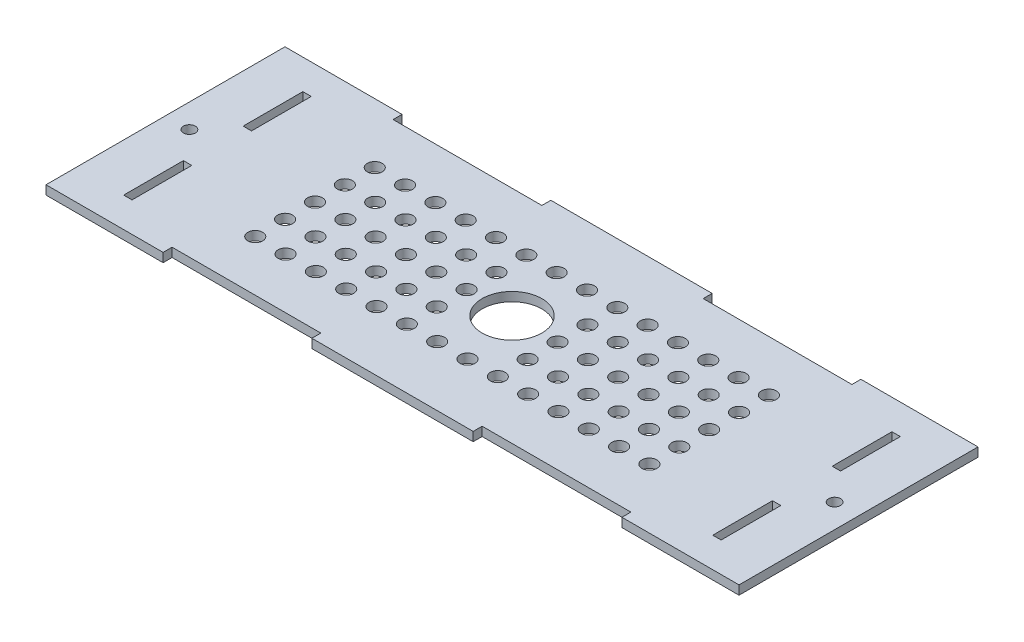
ISO-10303-21;
HEADER;
FILE_DESCRIPTION(('STEP AP214'),'2;1');
FILE_NAME('part.step','',(''),(''),'','','');
FILE_SCHEMA(('AUTOMOTIVE_DESIGN { 1 0 10303 214 1 1 1 1 }'));
ENDSEC;
DATA;
#1=APPLICATION_CONTEXT('core data for automotive mechanical design processes');
#2=APPLICATION_PROTOCOL_DEFINITION('international standard','automotive_design',2000,#1);
#3=PRODUCT_CONTEXT('',#1,'mechanical');
#4=PRODUCT('Part','Part','',(#3));
#5=PRODUCT_RELATED_PRODUCT_CATEGORY('part','',(#4));
#6=PRODUCT_DEFINITION_FORMATION('','',#4);
#7=PRODUCT_DEFINITION_CONTEXT('part definition',#1,'design');
#8=PRODUCT_DEFINITION('design','',#6,#7);
#9=PRODUCT_DEFINITION_SHAPE('','',#8);
#10=(LENGTH_UNIT() NAMED_UNIT(*) SI_UNIT(.MILLI.,.METRE.));
#11=(NAMED_UNIT(*) PLANE_ANGLE_UNIT() SI_UNIT($,.RADIAN.));
#12=(NAMED_UNIT(*) SI_UNIT($,.STERADIAN.) SOLID_ANGLE_UNIT());
#13=UNCERTAINTY_MEASURE_WITH_UNIT(LENGTH_MEASURE(1.E-05),#10,'distance_accuracy_value','');
#14=(GEOMETRIC_REPRESENTATION_CONTEXT(3) GLOBAL_UNCERTAINTY_ASSIGNED_CONTEXT((#13)) GLOBAL_UNIT_ASSIGNED_CONTEXT((#10,
#11,#12)) REPRESENTATION_CONTEXT('',''));
#15=CARTESIAN_POINT('',(0.,0.,0.));
#16=DIRECTION('',(0.,0.,1.));
#17=DIRECTION('',(1.,0.,0.));
#18=AXIS2_PLACEMENT_3D('',#15,#16,#17);
#19=CARTESIAN_POINT('',(0.,0.,80.));
#20=DIRECTION('',(0.,0.,-1.));
#21=DIRECTION('',(-1.,0.,0.));
#22=AXIS2_PLACEMENT_3D('',#19,#20,#21);
#23=PLANE('',#22);
#24=DIRECTION('',(1.,0.,0.));
#25=VECTOR('',#24,1.);
#26=CARTESIAN_POINT('',(0.,-3.,80.));
#27=LINE('',#26,#25);
#28=CARTESIAN_POINT('',(89.,-3.,80.));
#29=VERTEX_POINT('',#28);
#30=CARTESIAN_POINT('',(143.,-3.,80.));
#31=VERTEX_POINT('',#30);
#32=EDGE_CURVE('E908',#29,#31,#27,.T.);
#33=ORIENTED_EDGE('',*,*,#32,.T.);
#34=DIRECTION('',(0.,1.,0.));
#35=VECTOR('',#34,1.);
#36=CARTESIAN_POINT('',(143.,-3.,80.));
#37=LINE('',#36,#35);
#38=CARTESIAN_POINT('',(143.,0.,80.));
#39=VERTEX_POINT('',#38);
#40=EDGE_CURVE('E326',#31,#39,#37,.T.);
#41=ORIENTED_EDGE('',*,*,#40,.T.);
#42=DIRECTION('',(1.,0.,0.));
#43=VECTOR('',#42,1.);
#44=CARTESIAN_POINT('',(0.,0.,80.));
#45=LINE('',#44,#43);
#46=CARTESIAN_POINT('',(89.,0.,80.));
#47=VERTEX_POINT('',#46);
#48=EDGE_CURVE('E917',#47,#39,#45,.T.);
#49=ORIENTED_EDGE('',*,*,#48,.F.);
#50=DIRECTION('',(0.,1.,0.));
#51=VECTOR('',#50,1.);
#52=CARTESIAN_POINT('',(89.,-3.,80.));
#53=LINE('',#52,#51);
#54=EDGE_CURVE('E377',#29,#47,#53,.T.);
#55=ORIENTED_EDGE('',*,*,#54,.F.);
#56=EDGE_LOOP('',(#33,#41,#49,#55));
#57=FACE_BOUND('',#56,.T.);
#58=ADVANCED_FACE('F35',(#57),#23,.F.);
#59=CARTESIAN_POINT('',(0.,0.,0.));
#60=DIRECTION('',(0.,0.,-1.));
#61=DIRECTION('',(-1.,0.,0.));
#62=AXIS2_PLACEMENT_3D('',#59,#60,#61);
#63=PLANE('',#62);
#64=DIRECTION('',(0.,1.,0.));
#65=VECTOR('',#64,1.);
#66=CARTESIAN_POINT('',(89.,-3.,0.));
#67=LINE('',#66,#65);
#68=CARTESIAN_POINT('',(89.,-3.,0.));
#69=VERTEX_POINT('',#68);
#70=CARTESIAN_POINT('',(89.,0.,0.));
#71=VERTEX_POINT('',#70);
#72=EDGE_CURVE('E306',#69,#71,#67,.T.);
#73=ORIENTED_EDGE('',*,*,#72,.T.);
#74=DIRECTION('',(1.,0.,0.));
#75=VECTOR('',#74,1.);
#76=CARTESIAN_POINT('',(0.,0.,0.));
#77=LINE('',#76,#75);
#78=CARTESIAN_POINT('',(143.,0.,0.));
#79=VERTEX_POINT('',#78);
#80=EDGE_CURVE('E931',#71,#79,#77,.T.);
#81=ORIENTED_EDGE('',*,*,#80,.T.);
#82=DIRECTION('',(0.,1.,0.));
#83=VECTOR('',#82,1.);
#84=CARTESIAN_POINT('',(143.,-3.,0.));
#85=LINE('',#84,#83);
#86=CARTESIAN_POINT('',(143.,-3.,0.));
#87=VERTEX_POINT('',#86);
#88=EDGE_CURVE('E304',#87,#79,#85,.T.);
#89=ORIENTED_EDGE('',*,*,#88,.F.);
#90=DIRECTION('',(1.,0.,0.));
#91=VECTOR('',#90,1.);
#92=CARTESIAN_POINT('',(0.,-3.,0.));
#93=LINE('',#92,#91);
#94=EDGE_CURVE('E923',#69,#87,#93,.T.);
#95=ORIENTED_EDGE('',*,*,#94,.F.);
#96=EDGE_LOOP('',(#73,#81,#89,#95));
#97=FACE_BOUND('',#96,.T.);
#98=ADVANCED_FACE('F956',(#97),#63,.T.);
#99=DIRECTION('',(0.,1.,0.));
#100=VECTOR('',#99,1.);
#101=CARTESIAN_POINT('',(39.2,-3.,0.));
#102=LINE('',#101,#100);
#103=CARTESIAN_POINT('',(39.2,-3.,0.));
#104=VERTEX_POINT('',#103);
#105=CARTESIAN_POINT('',(39.2,0.,0.));
#106=VERTEX_POINT('',#105);
#107=EDGE_CURVE('E280',#104,#106,#102,.T.);
#108=ORIENTED_EDGE('',*,*,#107,.F.);
#109=CARTESIAN_POINT('',(0.,-3.,0.));
#110=VERTEX_POINT('',#109);
#111=EDGE_CURVE('E293',#110,#104,#93,.T.);
#112=ORIENTED_EDGE('',*,*,#111,.F.);
#113=DIRECTION('',(0.,1.,0.));
#114=VECTOR('',#113,1.);
#115=CARTESIAN_POINT('',(0.,-3.,0.));
#116=LINE('',#115,#114);
#117=CARTESIAN_POINT('',(0.,0.,0.));
#118=VERTEX_POINT('',#117);
#119=EDGE_CURVE('E930',#110,#118,#116,.T.);
#120=ORIENTED_EDGE('',*,*,#119,.T.);
#121=EDGE_CURVE('E927',#118,#106,#77,.T.);
#122=ORIENTED_EDGE('',*,*,#121,.T.);
#123=EDGE_LOOP('',(#108,#112,#120,#122));
#124=FACE_BOUND('',#123,.T.);
#125=ADVANCED_FACE('F988',(#124),#63,.T.);
#126=CARTESIAN_POINT('',(192.8,0.,80.));
#127=VERTEX_POINT('',#126);
#128=CARTESIAN_POINT('',(232.,0.,80.));
#129=VERTEX_POINT('',#128);
#130=EDGE_CURVE('E912',#127,#129,#45,.T.);
#131=ORIENTED_EDGE('',*,*,#130,.F.);
#132=DIRECTION('',(0.,1.,0.));
#133=VECTOR('',#132,1.);
#134=CARTESIAN_POINT('',(192.8,-3.,80.));
#135=LINE('',#134,#133);
#136=CARTESIAN_POINT('',(192.8,-3.,80.));
#137=VERTEX_POINT('',#136);
#138=EDGE_CURVE('E50',#137,#127,#135,.T.);
#139=ORIENTED_EDGE('',*,*,#138,.F.);
#140=CARTESIAN_POINT('',(232.,-3.,80.));
#141=VERTEX_POINT('',#140);
#142=EDGE_CURVE('E909',#137,#141,#27,.T.);
#143=ORIENTED_EDGE('',*,*,#142,.T.);
#144=DIRECTION('',(0.,-1.,0.));
#145=VECTOR('',#144,1.);
#146=CARTESIAN_POINT('',(232.,0.,80.));
#147=LINE('',#146,#145);
#148=EDGE_CURVE('E907',#129,#141,#147,.T.);
#149=ORIENTED_EDGE('',*,*,#148,.F.);
#150=EDGE_LOOP('',(#131,#139,#143,#149));
#151=FACE_BOUND('',#150,.T.);
#152=ADVANCED_FACE('F983',(#151),#23,.F.);
#153=CARTESIAN_POINT('',(0.,-3.,80.));
#154=DIRECTION('',(0.,1.,0.));
#155=DIRECTION('',(0.,0.,1.));
#156=AXIS2_PLACEMENT_3D('',#153,#154,#155);
#157=PLANE('',#156);
#158=CARTESIAN_POINT('',(7.99999999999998,-3.,40.));
#159=DIRECTION('',(0.,1.,0.));
#160=DIRECTION('',(0.,0.,-1.));
#161=AXIS2_PLACEMENT_3D('',#158,#159,#160);
#162=CIRCLE('',#161,2.);
#163=CARTESIAN_POINT('',(7.99999999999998,-3.,38.));
#164=VERTEX_POINT('',#163);
#165=EDGE_CURVE('E1033',#164,#164,#162,.T.);
#166=ORIENTED_EDGE('',*,*,#165,.T.);
#167=EDGE_LOOP('',(#166));
#168=FACE_BOUND('',#167,.T.);
#169=CARTESIAN_POINT('',(224.,-3.,40.));
#170=DIRECTION('',(0.,1.,0.));
#171=DIRECTION('',(0.,0.,1.));
#172=AXIS2_PLACEMENT_3D('',#169,#170,#171);
#173=CIRCLE('',#172,2.);
#174=CARTESIAN_POINT('',(224.,-3.,42.));
#175=VERTEX_POINT('',#174);
#176=EDGE_CURVE('E349',#175,#175,#173,.T.);
#177=ORIENTED_EDGE('',*,*,#176,.T.);
#178=EDGE_LOOP('',(#177));
#179=FACE_BOUND('',#178,.T.);
#180=DIRECTION('',(1.,0.,0.));
#181=VECTOR('',#180,1.);
#182=CARTESIAN_POINT('',(89.,-3.,3.));
#183=LINE('',#182,#181);
#184=CARTESIAN_POINT('',(39.2,-3.,3.));
#185=VERTEX_POINT('',#184);
#186=CARTESIAN_POINT('',(89.,-3.,3.));
#187=VERTEX_POINT('',#186);
#188=EDGE_CURVE('E283',#185,#187,#183,.T.);
#189=ORIENTED_EDGE('',*,*,#188,.T.);
#190=DIRECTION('',(0.,0.,-1.));
#191=VECTOR('',#190,1.);
#192=CARTESIAN_POINT('',(89.,-3.,0.));
#193=LINE('',#192,#191);
#194=EDGE_CURVE('E288',#187,#69,#193,.T.);
#195=ORIENTED_EDGE('',*,*,#194,.T.);
#196=ORIENTED_EDGE('',*,*,#94,.T.);
#197=DIRECTION('',(0.,0.,1.));
#198=VECTOR('',#197,1.);
#199=CARTESIAN_POINT('',(143.,-3.,0.));
#200=LINE('',#199,#198);
#201=CARTESIAN_POINT('',(143.,-3.,3.));
#202=VERTEX_POINT('',#201);
#203=EDGE_CURVE('E312',#87,#202,#200,.T.);
#204=ORIENTED_EDGE('',*,*,#203,.T.);
#205=DIRECTION('',(1.,0.,0.));
#206=VECTOR('',#205,1.);
#207=CARTESIAN_POINT('',(143.,-3.,3.));
#208=LINE('',#207,#206);
#209=CARTESIAN_POINT('',(192.8,-3.,2.99999999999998));
#210=VERTEX_POINT('',#209);
#211=EDGE_CURVE('E315',#202,#210,#208,.T.);
#212=ORIENTED_EDGE('',*,*,#211,.T.);
#213=DIRECTION('',(0.,0.,-1.));
#214=VECTOR('',#213,1.);
#215=CARTESIAN_POINT('',(192.8,-3.,0.));
#216=LINE('',#215,#214);
#217=CARTESIAN_POINT('',(192.8,-3.,0.));
#218=VERTEX_POINT('',#217);
#219=EDGE_CURVE('E318',#210,#218,#216,.T.);
#220=ORIENTED_EDGE('',*,*,#219,.T.);
#221=CARTESIAN_POINT('',(232.,-3.,0.));
#222=VERTEX_POINT('',#221);
#223=EDGE_CURVE('E903',#218,#222,#93,.T.);
#224=ORIENTED_EDGE('',*,*,#223,.T.);
#225=DIRECTION('',(0.,0.,-1.));
#226=VECTOR('',#225,1.);
#227=CARTESIAN_POINT('',(232.,-3.,80.));
#228=LINE('',#227,#226);
#229=EDGE_CURVE('E11',#141,#222,#228,.T.);
#230=ORIENTED_EDGE('',*,*,#229,.F.);
#231=ORIENTED_EDGE('',*,*,#142,.F.);
#232=DIRECTION('',(0.,0.,-1.));
#233=VECTOR('',#232,1.);
#234=CARTESIAN_POINT('',(192.8,-3.,80.));
#235=LINE('',#234,#233);
#236=CARTESIAN_POINT('',(192.8,-3.,77.));
#237=VERTEX_POINT('',#236);
#238=EDGE_CURVE('E336',#137,#237,#235,.T.);
#239=ORIENTED_EDGE('',*,*,#238,.T.);
#240=DIRECTION('',(-1.,0.,0.));
#241=VECTOR('',#240,1.);
#242=CARTESIAN_POINT('',(143.,-3.,77.));
#243=LINE('',#242,#241);
#244=CARTESIAN_POINT('',(143.,-3.,77.));
#245=VERTEX_POINT('',#244);
#246=EDGE_CURVE('E339',#237,#245,#243,.T.);
#247=ORIENTED_EDGE('',*,*,#246,.T.);
#248=DIRECTION('',(0.,0.,1.));
#249=VECTOR('',#248,1.);
#250=CARTESIAN_POINT('',(143.,-3.,80.));
#251=LINE('',#250,#249);
#252=EDGE_CURVE('E343',#245,#31,#251,.T.);
#253=ORIENTED_EDGE('',*,*,#252,.T.);
#254=ORIENTED_EDGE('',*,*,#32,.F.);
#255=DIRECTION('',(0.,0.,-1.));
#256=VECTOR('',#255,1.);
#257=CARTESIAN_POINT('',(89.,-3.,80.));
#258=LINE('',#257,#256);
#259=CARTESIAN_POINT('',(89.,-3.,77.));
#260=VERTEX_POINT('',#259);
#261=EDGE_CURVE('E360',#29,#260,#258,.T.);
#262=ORIENTED_EDGE('',*,*,#261,.T.);
#263=DIRECTION('',(-1.,0.,0.));
#264=VECTOR('',#263,1.);
#265=CARTESIAN_POINT('',(89.,-3.,77.));
#266=LINE('',#265,#264);
#267=CARTESIAN_POINT('',(39.2,-3.,77.));
#268=VERTEX_POINT('',#267);
#269=EDGE_CURVE('E363',#260,#268,#266,.T.);
#270=ORIENTED_EDGE('',*,*,#269,.T.);
#271=DIRECTION('',(0.,0.,1.));
#272=VECTOR('',#271,1.);
#273=CARTESIAN_POINT('',(39.2,-3.,80.));
#274=LINE('',#273,#272);
#275=CARTESIAN_POINT('',(39.2,-3.,80.));
#276=VERTEX_POINT('',#275);
#277=EDGE_CURVE('E367',#268,#276,#274,.T.);
#278=ORIENTED_EDGE('',*,*,#277,.T.);
#279=CARTESIAN_POINT('',(0.,-3.,80.));
#280=VERTEX_POINT('',#279);
#281=EDGE_CURVE('E904',#280,#276,#27,.T.);
#282=ORIENTED_EDGE('',*,*,#281,.F.);
#283=DIRECTION('',(0.,0.,-1.));
#284=VECTOR('',#283,1.);
#285=CARTESIAN_POINT('',(0.,-3.,80.));
#286=LINE('',#285,#284);
#287=EDGE_CURVE('E920',#280,#110,#286,.T.);
#288=ORIENTED_EDGE('',*,*,#287,.T.);
#289=ORIENTED_EDGE('',*,*,#111,.T.);
#290=DIRECTION('',(0.,0.,1.));
#291=VECTOR('',#290,1.);
#292=CARTESIAN_POINT('',(39.2,-3.,0.));
#293=LINE('',#292,#291);
#294=EDGE_CURVE('E272',#104,#185,#293,.T.);
#295=ORIENTED_EDGE('',*,*,#294,.T.);
#296=EDGE_LOOP('',(#189,#195,#196,#204,#212,#220,#224,#230,#231,#239,#247,#253,#254,#262,#270,
#278,#282,#288,#289,#295));
#297=FACE_BOUND('',#296,.T.);
#298=DIRECTION('',(0.,0.,1.));
#299=VECTOR('',#298,1.);
#300=CARTESIAN_POINT('',(16.,-3.,80.));
#301=LINE('',#300,#299);
#302=CARTESIAN_POINT('',(16.,-3.,50.));
#303=VERTEX_POINT('',#302);
#304=CARTESIAN_POINT('',(16.,-3.,70.));
#305=VERTEX_POINT('',#304);
#306=EDGE_CURVE('E475',#303,#305,#301,.T.);
#307=ORIENTED_EDGE('',*,*,#306,.T.);
#308=DIRECTION('',(1.,0.,0.));
#309=VECTOR('',#308,1.);
#310=CARTESIAN_POINT('',(0.,-3.,69.9999999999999));
#311=LINE('',#310,#309);
#312=CARTESIAN_POINT('',(18.8,-3.,70.));
#313=VERTEX_POINT('',#312);
#314=EDGE_CURVE('E478',#305,#313,#311,.T.);
#315=ORIENTED_EDGE('',*,*,#314,.T.);
#316=DIRECTION('',(0.,0.,-1.));
#317=VECTOR('',#316,1.);
#318=CARTESIAN_POINT('',(18.8,-3.,80.));
#319=LINE('',#318,#317);
#320=CARTESIAN_POINT('',(18.8,-3.,50.));
#321=VERTEX_POINT('',#320);
#322=EDGE_CURVE('E469',#313,#321,#319,.T.);
#323=ORIENTED_EDGE('',*,*,#322,.T.);
#324=DIRECTION('',(-1.,0.,0.));
#325=VECTOR('',#324,1.);
#326=CARTESIAN_POINT('',(0.,-3.,50.));
#327=LINE('',#326,#325);
#328=EDGE_CURVE('E472',#321,#303,#327,.T.);
#329=ORIENTED_EDGE('',*,*,#328,.T.);
#330=EDGE_LOOP('',(#307,#315,#323,#329));
#331=FACE_BOUND('',#330,.T.);
#332=DIRECTION('',(1.,0.,0.));
#333=VECTOR('',#332,1.);
#334=CARTESIAN_POINT('',(-3.71726459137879E-13,-3.,30.0000000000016));
#335=LINE('',#334,#333);
#336=CARTESIAN_POINT('',(213.2,-3.,30.));
#337=VERTEX_POINT('',#336);
#338=CARTESIAN_POINT('',(216.,-3.,30.));
#339=VERTEX_POINT('',#338);
#340=EDGE_CURVE('E463',#337,#339,#335,.T.);
#341=ORIENTED_EDGE('',*,*,#340,.T.);
#342=DIRECTION('',(0.,0.,-1.));
#343=VECTOR('',#342,1.);
#344=CARTESIAN_POINT('',(216.,-3.,80.));
#345=LINE('',#344,#343);
#346=CARTESIAN_POINT('',(216.,-3.,10.));
#347=VERTEX_POINT('',#346);
#348=EDGE_CURVE('E466',#339,#347,#345,.T.);
#349=ORIENTED_EDGE('',*,*,#348,.T.);
#350=DIRECTION('',(-1.,0.,0.));
#351=VECTOR('',#350,1.);
#352=CARTESIAN_POINT('',(-5.63785129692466E-13,-3.,10.0000000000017));
#353=LINE('',#352,#351);
#354=CARTESIAN_POINT('',(213.2,-3.,10.));
#355=VERTEX_POINT('',#354);
#356=EDGE_CURVE('E457',#347,#355,#353,.T.);
#357=ORIENTED_EDGE('',*,*,#356,.T.);
#358=DIRECTION('',(0.,0.,1.));
#359=VECTOR('',#358,1.);
#360=CARTESIAN_POINT('',(213.2,-3.,80.0000000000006));
#361=LINE('',#360,#359);
#362=EDGE_CURVE('E460',#355,#337,#361,.T.);
#363=ORIENTED_EDGE('',*,*,#362,.T.);
#364=EDGE_LOOP('',(#341,#349,#357,#363));
#365=FACE_BOUND('',#364,.T.);
#366=DIRECTION('',(1.,0.,0.));
#367=VECTOR('',#366,1.);
#368=CARTESIAN_POINT('',(0.,-3.,69.9999999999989));
#369=LINE('',#368,#367);
#370=CARTESIAN_POINT('',(213.2,-3.,70.));
#371=VERTEX_POINT('',#370);
#372=CARTESIAN_POINT('',(216.,-3.,70.));
#373=VERTEX_POINT('',#372);
#374=EDGE_CURVE('E451',#371,#373,#369,.T.);
#375=ORIENTED_EDGE('',*,*,#374,.T.);
#376=DIRECTION('',(0.,0.,-1.));
#377=VECTOR('',#376,1.);
#378=CARTESIAN_POINT('',(216.,-3.,80.));
#379=LINE('',#378,#377);
#380=CARTESIAN_POINT('',(216.,-3.,50.));
#381=VERTEX_POINT('',#380);
#382=EDGE_CURVE('E454',#373,#381,#379,.T.);
#383=ORIENTED_EDGE('',*,*,#382,.T.);
#384=DIRECTION('',(-1.,0.,0.));
#385=VECTOR('',#384,1.);
#386=CARTESIAN_POINT('',(2.23035875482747E-13,-3.,49.9999999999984));
#387=LINE('',#386,#385);
#388=CARTESIAN_POINT('',(213.2,-3.,50.));
#389=VERTEX_POINT('',#388);
#390=EDGE_CURVE('E401',#381,#389,#387,.T.);
#391=ORIENTED_EDGE('',*,*,#390,.T.);
#392=DIRECTION('',(0.,0.,1.));
#393=VECTOR('',#392,1.);
#394=CARTESIAN_POINT('',(213.2,-3.,79.9999999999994));
#395=LINE('',#394,#393);
#396=EDGE_CURVE('E448',#389,#371,#395,.T.);
#397=ORIENTED_EDGE('',*,*,#396,.T.);
#398=EDGE_LOOP('',(#375,#383,#391,#397));
#399=FACE_BOUND('',#398,.T.);
#400=DIRECTION('',(-1.,0.,0.));
#401=VECTOR('',#400,1.);
#402=CARTESIAN_POINT('',(0.,-3.,10.));
#403=LINE('',#402,#401);
#404=CARTESIAN_POINT('',(18.8,-3.,10.));
#405=VERTEX_POINT('',#404);
#406=CARTESIAN_POINT('',(16.,-3.,10.));
#407=VERTEX_POINT('',#406);
#408=EDGE_CURVE('E507',#405,#407,#403,.T.);
#409=ORIENTED_EDGE('',*,*,#408,.T.);
#410=DIRECTION('',(0.,0.,1.));
#411=VECTOR('',#410,1.);
#412=CARTESIAN_POINT('',(16.,-3.,80.));
#413=LINE('',#412,#411);
#414=CARTESIAN_POINT('',(16.,-3.,30.));
#415=VERTEX_POINT('',#414);
#416=EDGE_CURVE('E510',#407,#415,#413,.T.);
#417=ORIENTED_EDGE('',*,*,#416,.T.);
#418=DIRECTION('',(1.,0.,0.));
#419=VECTOR('',#418,1.);
#420=CARTESIAN_POINT('',(0.,-3.,30.));
#421=LINE('',#420,#419);
#422=CARTESIAN_POINT('',(18.8,-3.,30.));
#423=VERTEX_POINT('',#422);
#424=EDGE_CURVE('E495',#415,#423,#421,.T.);
#425=ORIENTED_EDGE('',*,*,#424,.T.);
#426=DIRECTION('',(0.,0.,-1.));
#427=VECTOR('',#426,1.);
#428=CARTESIAN_POINT('',(18.8,-3.,80.));
#429=LINE('',#428,#427);
#430=EDGE_CURVE('E504',#423,#405,#429,.T.);
#431=ORIENTED_EDGE('',*,*,#430,.T.);
#432=EDGE_LOOP('',(#409,#417,#425,#431));
#433=FACE_BOUND('',#432,.T.);
#434=CARTESIAN_POINT('',(50.05,-3.,20.0000000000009));
#435=DIRECTION('',(0.,1.,0.));
#436=DIRECTION('',(0.,0.,1.));
#437=AXIS2_PLACEMENT_3D('',#434,#435,#436);
#438=CIRCLE('',#437,2.5);
#439=CARTESIAN_POINT('',(50.05,-3.,22.5000000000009));
#440=VERTEX_POINT('',#439);
#441=EDGE_CURVE('E894',#440,#440,#438,.T.);
#442=ORIENTED_EDGE('',*,*,#441,.T.);
#443=EDGE_LOOP('',(#442));
#444=FACE_BOUND('',#443,.T.);
#445=CARTESIAN_POINT('',(60.2000000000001,-3.,30.0000000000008));
#446=DIRECTION('',(0.,1.,0.));
#447=DIRECTION('',(0.,0.,1.));
#448=AXIS2_PLACEMENT_3D('',#445,#446,#447);
#449=CIRCLE('',#448,2.5);
#450=CARTESIAN_POINT('',(60.2000000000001,-3.,32.5000000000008));
#451=VERTEX_POINT('',#450);
#452=EDGE_CURVE('E891',#451,#451,#449,.T.);
#453=ORIENTED_EDGE('',*,*,#452,.T.);
#454=EDGE_LOOP('',(#453));
#455=FACE_BOUND('',#454,.T.);
#456=CARTESIAN_POINT('',(70.35,-3.,20.0000000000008));
#457=DIRECTION('',(0.,1.,0.));
#458=DIRECTION('',(0.,0.,1.));
#459=AXIS2_PLACEMENT_3D('',#456,#457,#458);
#460=CIRCLE('',#459,2.5);
#461=CARTESIAN_POINT('',(70.35,-3.,22.5000000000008));
#462=VERTEX_POINT('',#461);
#463=EDGE_CURVE('E888',#462,#462,#460,.T.);
#464=ORIENTED_EDGE('',*,*,#463,.T.);
#465=EDGE_LOOP('',(#464));
#466=FACE_BOUND('',#465,.T.);
#467=CARTESIAN_POINT('',(60.1999999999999,-3.,20.0000000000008));
#468=DIRECTION('',(0.,1.,0.));
#469=DIRECTION('',(0.,0.,1.));
#470=AXIS2_PLACEMENT_3D('',#467,#468,#469);
#471=CIRCLE('',#470,2.5);
#472=CARTESIAN_POINT('',(60.1999999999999,-3.,22.5000000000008));
#473=VERTEX_POINT('',#472);
#474=EDGE_CURVE('E885',#473,#473,#471,.T.);
#475=ORIENTED_EDGE('',*,*,#474,.T.);
#476=EDGE_LOOP('',(#475));
#477=FACE_BOUND('',#476,.T.);
#478=CARTESIAN_POINT('',(100.8,-3.,20.0000000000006));
#479=DIRECTION('',(0.,1.,0.));
#480=DIRECTION('',(0.,0.,1.));
#481=AXIS2_PLACEMENT_3D('',#478,#479,#480);
#482=CIRCLE('',#481,2.5);
#483=CARTESIAN_POINT('',(100.8,-3.,22.5000000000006));
#484=VERTEX_POINT('',#483);
#485=EDGE_CURVE('E882',#484,#484,#482,.T.);
#486=ORIENTED_EDGE('',*,*,#485,.T.);
#487=EDGE_LOOP('',(#486));
#488=FACE_BOUND('',#487,.T.);
#489=CARTESIAN_POINT('',(110.95,-3.,20.0000000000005));
#490=DIRECTION('',(0.,1.,0.));
#491=DIRECTION('',(0.,0.,1.));
#492=AXIS2_PLACEMENT_3D('',#489,#490,#491);
#493=CIRCLE('',#492,2.5);
#494=CARTESIAN_POINT('',(110.95,-3.,22.5000000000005));
#495=VERTEX_POINT('',#494);
#496=EDGE_CURVE('E879',#495,#495,#493,.T.);
#497=ORIENTED_EDGE('',*,*,#496,.T.);
#498=EDGE_LOOP('',(#497));
#499=FACE_BOUND('',#498,.T.);
#500=CARTESIAN_POINT('',(80.5,-3.,20.0000000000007));
#501=DIRECTION('',(0.,1.,0.));
#502=DIRECTION('',(0.,0.,1.));
#503=AXIS2_PLACEMENT_3D('',#500,#501,#502);
#504=CIRCLE('',#503,2.5);
#505=CARTESIAN_POINT('',(80.5,-3.,22.5000000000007));
#506=VERTEX_POINT('',#505);
#507=EDGE_CURVE('E876',#506,#506,#504,.T.);
#508=ORIENTED_EDGE('',*,*,#507,.T.);
#509=EDGE_LOOP('',(#508));
#510=FACE_BOUND('',#509,.T.);
#511=CARTESIAN_POINT('',(90.6499999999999,-3.,20.0000000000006));
#512=DIRECTION('',(0.,1.,0.));
#513=DIRECTION('',(0.,0.,1.));
#514=AXIS2_PLACEMENT_3D('',#511,#512,#513);
#515=CIRCLE('',#514,2.5);
#516=CARTESIAN_POINT('',(90.6499999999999,-3.,22.5000000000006));
#517=VERTEX_POINT('',#516);
#518=EDGE_CURVE('E873',#517,#517,#515,.T.);
#519=ORIENTED_EDGE('',*,*,#518,.T.);
#520=EDGE_LOOP('',(#519));
#521=FACE_BOUND('',#520,.T.);
#522=CARTESIAN_POINT('',(100.8,-3.,30.0000000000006));
#523=DIRECTION('',(0.,1.,0.));
#524=DIRECTION('',(0.,0.,1.));
#525=AXIS2_PLACEMENT_3D('',#522,#523,#524);
#526=CIRCLE('',#525,2.5);
#527=CARTESIAN_POINT('',(100.8,-3.,32.5000000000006));
#528=VERTEX_POINT('',#527);
#529=EDGE_CURVE('E870',#528,#528,#526,.T.);
#530=ORIENTED_EDGE('',*,*,#529,.T.);
#531=EDGE_LOOP('',(#530));
#532=FACE_BOUND('',#531,.T.);
#533=CARTESIAN_POINT('',(100.8,-3.,40.0000000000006));
#534=DIRECTION('',(0.,1.,0.));
#535=DIRECTION('',(0.,0.,1.));
#536=AXIS2_PLACEMENT_3D('',#533,#534,#535);
#537=CIRCLE('',#536,2.5);
#538=CARTESIAN_POINT('',(100.8,-3.,42.5000000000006));
#539=VERTEX_POINT('',#538);
#540=EDGE_CURVE('E867',#539,#539,#537,.T.);
#541=ORIENTED_EDGE('',*,*,#540,.T.);
#542=EDGE_LOOP('',(#541));
#543=FACE_BOUND('',#542,.T.);
#544=CARTESIAN_POINT('',(80.5000000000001,-3.,30.0000000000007));
#545=DIRECTION('',(0.,1.,0.));
#546=DIRECTION('',(0.,0.,1.));
#547=AXIS2_PLACEMENT_3D('',#544,#545,#546);
#548=CIRCLE('',#547,2.5);
#549=CARTESIAN_POINT('',(80.5000000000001,-3.,32.5000000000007));
#550=VERTEX_POINT('',#549);
#551=EDGE_CURVE('E864',#550,#550,#548,.T.);
#552=ORIENTED_EDGE('',*,*,#551,.T.);
#553=EDGE_LOOP('',(#552));
#554=FACE_BOUND('',#553,.T.);
#555=CARTESIAN_POINT('',(90.6500000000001,-3.,30.0000000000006));
#556=DIRECTION('',(0.,1.,0.));
#557=DIRECTION('',(0.,0.,1.));
#558=AXIS2_PLACEMENT_3D('',#555,#556,#557);
#559=CIRCLE('',#558,2.5);
#560=CARTESIAN_POINT('',(90.6500000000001,-3.,32.5000000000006));
#561=VERTEX_POINT('',#560);
#562=EDGE_CURVE('E861',#561,#561,#559,.T.);
#563=ORIENTED_EDGE('',*,*,#562,.T.);
#564=EDGE_LOOP('',(#563));
#565=FACE_BOUND('',#564,.T.);
#566=CARTESIAN_POINT('',(70.3500000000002,-3.,40.0000000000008));
#567=DIRECTION('',(0.,1.,0.));
#568=DIRECTION('',(0.,0.,1.));
#569=AXIS2_PLACEMENT_3D('',#566,#567,#568);
#570=CIRCLE('',#569,2.5);
#571=CARTESIAN_POINT('',(70.3500000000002,-3.,42.5000000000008));
#572=VERTEX_POINT('',#571);
#573=EDGE_CURVE('E858',#572,#572,#570,.T.);
#574=ORIENTED_EDGE('',*,*,#573,.T.);
#575=EDGE_LOOP('',(#574));
#576=FACE_BOUND('',#575,.T.);
#577=CARTESIAN_POINT('',(60.2000000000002,-3.,40.0000000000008));
#578=DIRECTION('',(0.,1.,0.));
#579=DIRECTION('',(0.,0.,1.));
#580=AXIS2_PLACEMENT_3D('',#577,#578,#579);
#581=CIRCLE('',#580,2.5);
#582=CARTESIAN_POINT('',(60.2000000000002,-3.,42.5000000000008));
#583=VERTEX_POINT('',#582);
#584=EDGE_CURVE('E855',#583,#583,#581,.T.);
#585=ORIENTED_EDGE('',*,*,#584,.T.);
#586=EDGE_LOOP('',(#585));
#587=FACE_BOUND('',#586,.T.);
#588=CARTESIAN_POINT('',(90.6500000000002,-3.,40.0000000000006));
#589=DIRECTION('',(0.,1.,0.));
#590=DIRECTION('',(0.,0.,1.));
#591=AXIS2_PLACEMENT_3D('',#588,#589,#590);
#592=CIRCLE('',#591,2.5);
#593=CARTESIAN_POINT('',(90.6500000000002,-3.,42.5000000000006));
#594=VERTEX_POINT('',#593);
#595=EDGE_CURVE('E852',#594,#594,#592,.T.);
#596=ORIENTED_EDGE('',*,*,#595,.T.);
#597=EDGE_LOOP('',(#596));
#598=FACE_BOUND('',#597,.T.);
#599=CARTESIAN_POINT('',(80.5000000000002,-3.,40.0000000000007));
#600=DIRECTION('',(0.,1.,0.));
#601=DIRECTION('',(0.,0.,1.));
#602=AXIS2_PLACEMENT_3D('',#599,#600,#601);
#603=CIRCLE('',#602,2.5);
#604=CARTESIAN_POINT('',(80.5000000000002,-3.,42.5000000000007));
#605=VERTEX_POINT('',#604);
#606=EDGE_CURVE('E849',#605,#605,#603,.T.);
#607=ORIENTED_EDGE('',*,*,#606,.T.);
#608=EDGE_LOOP('',(#607));
#609=FACE_BOUND('',#608,.T.);
#610=CARTESIAN_POINT('',(100.8,-3.,50.0000000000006));
#611=DIRECTION('',(0.,1.,0.));
#612=DIRECTION('',(0.,0.,1.));
#613=AXIS2_PLACEMENT_3D('',#610,#611,#612);
#614=CIRCLE('',#613,2.5);
#615=CARTESIAN_POINT('',(100.8,-3.,52.5000000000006));
#616=VERTEX_POINT('',#615);
#617=EDGE_CURVE('E846',#616,#616,#614,.T.);
#618=ORIENTED_EDGE('',*,*,#617,.T.);
#619=EDGE_LOOP('',(#618));
#620=FACE_BOUND('',#619,.T.);
#621=CARTESIAN_POINT('',(50.0500000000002,-3.,40.0000000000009));
#622=DIRECTION('',(0.,1.,0.));
#623=DIRECTION('',(0.,0.,1.));
#624=AXIS2_PLACEMENT_3D('',#621,#622,#623);
#625=CIRCLE('',#624,2.5);
#626=CARTESIAN_POINT('',(50.0500000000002,-3.,42.5000000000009));
#627=VERTEX_POINT('',#626);
#628=EDGE_CURVE('E843',#627,#627,#625,.T.);
#629=ORIENTED_EDGE('',*,*,#628,.T.);
#630=EDGE_LOOP('',(#629));
#631=FACE_BOUND('',#630,.T.);
#632=CARTESIAN_POINT('',(70.3500000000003,-3.,50.0000000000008));
#633=DIRECTION('',(0.,1.,0.));
#634=DIRECTION('',(0.,0.,1.));
#635=AXIS2_PLACEMENT_3D('',#632,#633,#634);
#636=CIRCLE('',#635,2.5);
#637=CARTESIAN_POINT('',(70.3500000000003,-3.,52.5000000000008));
#638=VERTEX_POINT('',#637);
#639=EDGE_CURVE('E840',#638,#638,#636,.T.);
#640=ORIENTED_EDGE('',*,*,#639,.T.);
#641=EDGE_LOOP('',(#640));
#642=FACE_BOUND('',#641,.T.);
#643=CARTESIAN_POINT('',(90.6500000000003,-3.,50.0000000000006));
#644=DIRECTION('',(0.,1.,0.));
#645=DIRECTION('',(0.,0.,1.));
#646=AXIS2_PLACEMENT_3D('',#643,#644,#645);
#647=CIRCLE('',#646,2.5);
#648=CARTESIAN_POINT('',(90.6500000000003,-3.,52.5000000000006));
#649=VERTEX_POINT('',#648);
#650=EDGE_CURVE('E837',#649,#649,#647,.T.);
#651=ORIENTED_EDGE('',*,*,#650,.T.);
#652=EDGE_LOOP('',(#651));
#653=FACE_BOUND('',#652,.T.);
#654=CARTESIAN_POINT('',(50.0500000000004,-3.,60.0000000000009));
#655=DIRECTION('',(0.,1.,0.));
#656=DIRECTION('',(0.,0.,1.));
#657=AXIS2_PLACEMENT_3D('',#654,#655,#656);
#658=CIRCLE('',#657,2.5);
#659=CARTESIAN_POINT('',(50.0500000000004,-3.,62.5000000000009));
#660=VERTEX_POINT('',#659);
#661=EDGE_CURVE('E834',#660,#660,#658,.T.);
#662=ORIENTED_EDGE('',*,*,#661,.T.);
#663=EDGE_LOOP('',(#662));
#664=FACE_BOUND('',#663,.T.);
#665=CARTESIAN_POINT('',(60.2000000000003,-3.,50.0000000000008));
#666=DIRECTION('',(0.,1.,0.));
#667=DIRECTION('',(0.,0.,1.));
#668=AXIS2_PLACEMENT_3D('',#665,#666,#667);
#669=CIRCLE('',#668,2.5);
#670=CARTESIAN_POINT('',(60.2000000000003,-3.,52.5000000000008));
#671=VERTEX_POINT('',#670);
#672=EDGE_CURVE('E831',#671,#671,#669,.T.);
#673=ORIENTED_EDGE('',*,*,#672,.T.);
#674=EDGE_LOOP('',(#673));
#675=FACE_BOUND('',#674,.T.);
#676=CARTESIAN_POINT('',(70.3500000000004,-3.,60.0000000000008));
#677=DIRECTION('',(0.,1.,0.));
#678=DIRECTION('',(0.,0.,1.));
#679=AXIS2_PLACEMENT_3D('',#676,#677,#678);
#680=CIRCLE('',#679,2.5);
#681=CARTESIAN_POINT('',(70.3500000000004,-3.,62.5000000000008));
#682=VERTEX_POINT('',#681);
#683=EDGE_CURVE('E828',#682,#682,#680,.T.);
#684=ORIENTED_EDGE('',*,*,#683,.T.);
#685=EDGE_LOOP('',(#684));
#686=FACE_BOUND('',#685,.T.);
#687=CARTESIAN_POINT('',(60.2000000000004,-3.,60.0000000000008));
#688=DIRECTION('',(0.,1.,0.));
#689=DIRECTION('',(0.,0.,1.));
#690=AXIS2_PLACEMENT_3D('',#687,#688,#689);
#691=CIRCLE('',#690,2.5);
#692=CARTESIAN_POINT('',(60.2000000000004,-3.,62.5000000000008));
#693=VERTEX_POINT('',#692);
#694=EDGE_CURVE('E825',#693,#693,#691,.T.);
#695=ORIENTED_EDGE('',*,*,#694,.T.);
#696=EDGE_LOOP('',(#695));
#697=FACE_BOUND('',#696,.T.);
#698=CARTESIAN_POINT('',(131.25,-3.,50.0000000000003));
#699=DIRECTION('',(0.,1.,0.));
#700=DIRECTION('',(0.,0.,1.));
#701=AXIS2_PLACEMENT_3D('',#698,#699,#700);
#702=CIRCLE('',#701,2.5);
#703=CARTESIAN_POINT('',(131.25,-3.,52.5000000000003));
#704=VERTEX_POINT('',#703);
#705=EDGE_CURVE('E822',#704,#704,#702,.T.);
#706=ORIENTED_EDGE('',*,*,#705,.T.);
#707=EDGE_LOOP('',(#706));
#708=FACE_BOUND('',#707,.T.);
#709=CARTESIAN_POINT('',(131.25,-3.,40.0000000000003));
#710=DIRECTION('',(0.,1.,0.));
#711=DIRECTION('',(0.,0.,1.));
#712=AXIS2_PLACEMENT_3D('',#709,#710,#711);
#713=CIRCLE('',#712,2.5);
#714=CARTESIAN_POINT('',(131.25,-3.,42.5000000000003));
#715=VERTEX_POINT('',#714);
#716=EDGE_CURVE('E819',#715,#715,#713,.T.);
#717=ORIENTED_EDGE('',*,*,#716,.T.);
#718=EDGE_LOOP('',(#717));
#719=FACE_BOUND('',#718,.T.);
#720=CARTESIAN_POINT('',(141.4,-3.,20.0000000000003));
#721=DIRECTION('',(0.,1.,0.));
#722=DIRECTION('',(0.,0.,1.));
#723=AXIS2_PLACEMENT_3D('',#720,#721,#722);
#724=CIRCLE('',#723,2.5);
#725=CARTESIAN_POINT('',(141.4,-3.,22.5000000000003));
#726=VERTEX_POINT('',#725);
#727=EDGE_CURVE('E816',#726,#726,#724,.T.);
#728=ORIENTED_EDGE('',*,*,#727,.T.);
#729=EDGE_LOOP('',(#728));
#730=FACE_BOUND('',#729,.T.);
#731=CARTESIAN_POINT('',(141.4,-3.,30.0000000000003));
#732=DIRECTION('',(0.,1.,0.));
#733=DIRECTION('',(0.,0.,1.));
#734=AXIS2_PLACEMENT_3D('',#731,#732,#733);
#735=CIRCLE('',#734,2.49999999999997);
#736=CARTESIAN_POINT('',(141.4,-3.,32.5000000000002));
#737=VERTEX_POINT('',#736);
#738=EDGE_CURVE('E813',#737,#737,#735,.T.);
#739=ORIENTED_EDGE('',*,*,#738,.T.);
#740=EDGE_LOOP('',(#739));
#741=FACE_BOUND('',#740,.T.);
#742=CARTESIAN_POINT('',(110.95,-3.,60.0000000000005));
#743=DIRECTION('',(0.,1.,0.));
#744=DIRECTION('',(0.,0.,1.));
#745=AXIS2_PLACEMENT_3D('',#742,#743,#744);
#746=CIRCLE('',#745,2.5);
#747=CARTESIAN_POINT('',(110.95,-3.,62.5000000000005));
#748=VERTEX_POINT('',#747);
#749=EDGE_CURVE('E810',#748,#748,#746,.T.);
#750=ORIENTED_EDGE('',*,*,#749,.T.);
#751=EDGE_LOOP('',(#750));
#752=FACE_BOUND('',#751,.T.);
#753=CARTESIAN_POINT('',(90.6500000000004,-3.,60.0000000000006));
#754=DIRECTION('',(0.,1.,0.));
#755=DIRECTION('',(0.,0.,1.));
#756=AXIS2_PLACEMENT_3D('',#753,#754,#755);
#757=CIRCLE('',#756,2.5);
#758=CARTESIAN_POINT('',(90.6500000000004,-3.,62.5000000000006));
#759=VERTEX_POINT('',#758);
#760=EDGE_CURVE('E807',#759,#759,#757,.T.);
#761=ORIENTED_EDGE('',*,*,#760,.T.);
#762=EDGE_LOOP('',(#761));
#763=FACE_BOUND('',#762,.T.);
#764=CARTESIAN_POINT('',(121.1,-3.,20.0000000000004));
#765=DIRECTION('',(0.,1.,0.));
#766=DIRECTION('',(0.,0.,1.));
#767=AXIS2_PLACEMENT_3D('',#764,#765,#766);
#768=CIRCLE('',#767,2.5);
#769=CARTESIAN_POINT('',(121.1,-3.,22.5000000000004));
#770=VERTEX_POINT('',#769);
#771=EDGE_CURVE('E804',#770,#770,#768,.T.);
#772=ORIENTED_EDGE('',*,*,#771,.T.);
#773=EDGE_LOOP('',(#772));
#774=FACE_BOUND('',#773,.T.);
#775=CARTESIAN_POINT('',(121.1,-3.,60.0000000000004));
#776=DIRECTION('',(0.,1.,0.));
#777=DIRECTION('',(0.,0.,1.));
#778=AXIS2_PLACEMENT_3D('',#775,#776,#777);
#779=CIRCLE('',#778,2.5);
#780=CARTESIAN_POINT('',(121.1,-3.,62.5000000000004));
#781=VERTEX_POINT('',#780);
#782=EDGE_CURVE('E801',#781,#781,#779,.T.);
#783=ORIENTED_EDGE('',*,*,#782,.T.);
#784=EDGE_LOOP('',(#783));
#785=FACE_BOUND('',#784,.T.);
#786=CARTESIAN_POINT('',(151.55,-3.,40.0000000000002));
#787=DIRECTION('',(0.,1.,0.));
#788=DIRECTION('',(0.,0.,1.));
#789=AXIS2_PLACEMENT_3D('',#786,#787,#788);
#790=CIRCLE('',#789,2.49999999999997);
#791=CARTESIAN_POINT('',(151.55,-3.,42.5000000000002));
#792=VERTEX_POINT('',#791);
#793=EDGE_CURVE('E798',#792,#792,#790,.T.);
#794=ORIENTED_EDGE('',*,*,#793,.T.);
#795=EDGE_LOOP('',(#794));
#796=FACE_BOUND('',#795,.T.);
#797=CARTESIAN_POINT('',(151.55,-3.,50.0000000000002));
#798=DIRECTION('',(0.,1.,0.));
#799=DIRECTION('',(0.,0.,1.));
#800=AXIS2_PLACEMENT_3D('',#797,#798,#799);
#801=CIRCLE('',#800,2.5);
#802=CARTESIAN_POINT('',(151.55,-3.,52.5000000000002));
#803=VERTEX_POINT('',#802);
#804=EDGE_CURVE('E795',#803,#803,#801,.T.);
#805=ORIENTED_EDGE('',*,*,#804,.T.);
#806=EDGE_LOOP('',(#805));
#807=FACE_BOUND('',#806,.T.);
#808=CARTESIAN_POINT('',(151.55,-3.,20.0000000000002));
#809=DIRECTION('',(0.,1.,0.));
#810=DIRECTION('',(0.,0.,1.));
#811=AXIS2_PLACEMENT_3D('',#808,#809,#810);
#812=CIRCLE('',#811,2.5);
#813=CARTESIAN_POINT('',(151.55,-3.,22.5000000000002));
#814=VERTEX_POINT('',#813);
#815=EDGE_CURVE('E792',#814,#814,#812,.T.);
#816=ORIENTED_EDGE('',*,*,#815,.T.);
#817=EDGE_LOOP('',(#816));
#818=FACE_BOUND('',#817,.T.);
#819=CARTESIAN_POINT('',(151.55,-3.,30.0000000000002));
#820=DIRECTION('',(0.,1.,0.));
#821=DIRECTION('',(0.,0.,1.));
#822=AXIS2_PLACEMENT_3D('',#819,#820,#821);
#823=CIRCLE('',#822,2.5);
#824=CARTESIAN_POINT('',(151.55,-3.,32.5000000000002));
#825=VERTEX_POINT('',#824);
#826=EDGE_CURVE('E789',#825,#825,#823,.T.);
#827=ORIENTED_EDGE('',*,*,#826,.T.);
#828=EDGE_LOOP('',(#827));
#829=FACE_BOUND('',#828,.T.);
#830=CARTESIAN_POINT('',(161.7,-3.,50.0000000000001));
#831=DIRECTION('',(0.,1.,0.));
#832=DIRECTION('',(0.,0.,1.));
#833=AXIS2_PLACEMENT_3D('',#830,#831,#832);
#834=CIRCLE('',#833,2.5);
#835=CARTESIAN_POINT('',(161.7,-3.,52.5000000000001));
#836=VERTEX_POINT('',#835);
#837=EDGE_CURVE('E786',#836,#836,#834,.T.);
#838=ORIENTED_EDGE('',*,*,#837,.T.);
#839=EDGE_LOOP('',(#838));
#840=FACE_BOUND('',#839,.T.);
#841=CARTESIAN_POINT('',(161.7,-3.,40.0000000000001));
#842=DIRECTION('',(0.,1.,0.));
#843=DIRECTION('',(0.,0.,1.));
#844=AXIS2_PLACEMENT_3D('',#841,#842,#843);
#845=CIRCLE('',#844,2.5);
#846=CARTESIAN_POINT('',(161.7,-3.,42.5000000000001));
#847=VERTEX_POINT('',#846);
#848=EDGE_CURVE('E783',#847,#847,#845,.T.);
#849=ORIENTED_EDGE('',*,*,#848,.T.);
#850=EDGE_LOOP('',(#849));
#851=FACE_BOUND('',#850,.T.);
#852=CARTESIAN_POINT('',(151.55,-3.,60.0000000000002));
#853=DIRECTION('',(0.,1.,0.));
#854=DIRECTION('',(0.,0.,1.));
#855=AXIS2_PLACEMENT_3D('',#852,#853,#854);
#856=CIRCLE('',#855,2.5);
#857=CARTESIAN_POINT('',(151.55,-3.,62.5000000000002));
#858=VERTEX_POINT('',#857);
#859=EDGE_CURVE('E780',#858,#858,#856,.T.);
#860=ORIENTED_EDGE('',*,*,#859,.T.);
#861=EDGE_LOOP('',(#860));
#862=FACE_BOUND('',#861,.T.);
#863=CARTESIAN_POINT('',(161.7,-3.,60.0000000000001));
#864=DIRECTION('',(0.,1.,0.));
#865=DIRECTION('',(0.,0.,1.));
#866=AXIS2_PLACEMENT_3D('',#863,#864,#865);
#867=CIRCLE('',#866,2.49999999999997);
#868=CARTESIAN_POINT('',(161.7,-3.,62.5000000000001));
#869=VERTEX_POINT('',#868);
#870=EDGE_CURVE('E777',#869,#869,#867,.T.);
#871=ORIENTED_EDGE('',*,*,#870,.T.);
#872=EDGE_LOOP('',(#871));
#873=FACE_BOUND('',#872,.T.);
#874=CARTESIAN_POINT('',(171.85,-3.,60.0000000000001));
#875=DIRECTION('',(0.,1.,0.));
#876=DIRECTION('',(0.,0.,1.));
#877=AXIS2_PLACEMENT_3D('',#874,#875,#876);
#878=CIRCLE('',#877,2.5);
#879=CARTESIAN_POINT('',(171.85,-3.,62.5000000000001));
#880=VERTEX_POINT('',#879);
#881=EDGE_CURVE('E774',#880,#880,#878,.T.);
#882=ORIENTED_EDGE('',*,*,#881,.T.);
#883=EDGE_LOOP('',(#882));
#884=FACE_BOUND('',#883,.T.);
#885=CARTESIAN_POINT('',(171.85,-3.,50.0000000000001));
#886=DIRECTION('',(0.,1.,0.));
#887=DIRECTION('',(0.,0.,1.));
#888=AXIS2_PLACEMENT_3D('',#885,#886,#887);
#889=CIRCLE('',#888,2.5);
#890=CARTESIAN_POINT('',(171.85,-3.,52.5000000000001));
#891=VERTEX_POINT('',#890);
#892=EDGE_CURVE('E771',#891,#891,#889,.T.);
#893=ORIENTED_EDGE('',*,*,#892,.T.);
#894=EDGE_LOOP('',(#893));
#895=FACE_BOUND('',#894,.T.);
#896=CARTESIAN_POINT('',(161.7,-3.,30.0000000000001));
#897=DIRECTION('',(0.,1.,0.));
#898=DIRECTION('',(0.,0.,1.));
#899=AXIS2_PLACEMENT_3D('',#896,#897,#898);
#900=CIRCLE('',#899,2.5);
#901=CARTESIAN_POINT('',(161.7,-3.,32.5000000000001));
#902=VERTEX_POINT('',#901);
#903=EDGE_CURVE('E768',#902,#902,#900,.T.);
#904=ORIENTED_EDGE('',*,*,#903,.T.);
#905=EDGE_LOOP('',(#904));
#906=FACE_BOUND('',#905,.T.);
#907=CARTESIAN_POINT('',(161.7,-3.,20.0000000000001));
#908=DIRECTION('',(0.,1.,0.));
#909=DIRECTION('',(0.,0.,1.));
#910=AXIS2_PLACEMENT_3D('',#907,#908,#909);
#911=CIRCLE('',#910,2.5);
#912=CARTESIAN_POINT('',(161.7,-3.,22.5000000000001));
#913=VERTEX_POINT('',#912);
#914=EDGE_CURVE('E765',#913,#913,#911,.T.);
#915=ORIENTED_EDGE('',*,*,#914,.T.);
#916=EDGE_LOOP('',(#915));
#917=FACE_BOUND('',#916,.T.);
#918=CARTESIAN_POINT('',(171.85,-3.,30.0000000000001));
#919=DIRECTION('',(0.,1.,0.));
#920=DIRECTION('',(0.,0.,1.));
#921=AXIS2_PLACEMENT_3D('',#918,#919,#920);
#922=CIRCLE('',#921,2.5);
#923=CARTESIAN_POINT('',(171.85,-3.,32.5000000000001));
#924=VERTEX_POINT('',#923);
#925=EDGE_CURVE('E762',#924,#924,#922,.T.);
#926=ORIENTED_EDGE('',*,*,#925,.T.);
#927=EDGE_LOOP('',(#926));
#928=FACE_BOUND('',#927,.T.);
#929=CARTESIAN_POINT('',(171.85,-3.,40.0000000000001));
#930=DIRECTION('',(0.,1.,0.));
#931=DIRECTION('',(0.,0.,1.));
#932=AXIS2_PLACEMENT_3D('',#929,#930,#931);
#933=CIRCLE('',#932,2.5);
#934=CARTESIAN_POINT('',(171.85,-3.,42.5000000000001));
#935=VERTEX_POINT('',#934);
#936=EDGE_CURVE('E759',#935,#935,#933,.T.);
#937=ORIENTED_EDGE('',*,*,#936,.T.);
#938=EDGE_LOOP('',(#937));
#939=FACE_BOUND('',#938,.T.);
#940=CARTESIAN_POINT('',(182.,-3.,60.));
#941=DIRECTION('',(0.,1.,0.));
#942=DIRECTION('',(0.,0.,1.));
#943=AXIS2_PLACEMENT_3D('',#940,#941,#942);
#944=CIRCLE('',#943,2.5);
#945=CARTESIAN_POINT('',(182.,-3.,62.5));
#946=VERTEX_POINT('',#945);
#947=EDGE_CURVE('E756',#946,#946,#944,.T.);
#948=ORIENTED_EDGE('',*,*,#947,.T.);
#949=EDGE_LOOP('',(#948));
#950=FACE_BOUND('',#949,.T.);
#951=CARTESIAN_POINT('',(171.85,-3.,20.0000000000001));
#952=DIRECTION('',(0.,1.,0.));
#953=DIRECTION('',(0.,0.,1.));
#954=AXIS2_PLACEMENT_3D('',#951,#952,#953);
#955=CIRCLE('',#954,2.5);
#956=CARTESIAN_POINT('',(171.85,-3.,22.5000000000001));
#957=VERTEX_POINT('',#956);
#958=EDGE_CURVE('E753',#957,#957,#955,.T.);
#959=ORIENTED_EDGE('',*,*,#958,.T.);
#960=EDGE_LOOP('',(#959));
#961=FACE_BOUND('',#960,.T.);
#962=CARTESIAN_POINT('',(70.3500000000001,-3.,30.0000000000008));
#963=DIRECTION('',(0.,1.,0.));
#964=DIRECTION('',(0.,0.,1.));
#965=AXIS2_PLACEMENT_3D('',#962,#963,#964);
#966=CIRCLE('',#965,2.5);
#967=CARTESIAN_POINT('',(70.3500000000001,-3.,32.5000000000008));
#968=VERTEX_POINT('',#967);
#969=EDGE_CURVE('E750',#968,#968,#966,.T.);
#970=ORIENTED_EDGE('',*,*,#969,.T.);
#971=EDGE_LOOP('',(#970));
#972=FACE_BOUND('',#971,.T.);
#973=CARTESIAN_POINT('',(50.0500000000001,-3.,30.0000000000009));
#974=DIRECTION('',(0.,1.,0.));
#975=DIRECTION('',(0.,0.,1.));
#976=AXIS2_PLACEMENT_3D('',#973,#974,#975);
#977=CIRCLE('',#976,2.5);
#978=CARTESIAN_POINT('',(50.0500000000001,-3.,32.5000000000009));
#979=VERTEX_POINT('',#978);
#980=EDGE_CURVE('E747',#979,#979,#977,.T.);
#981=ORIENTED_EDGE('',*,*,#980,.T.);
#982=EDGE_LOOP('',(#981));
#983=FACE_BOUND('',#982,.T.);
#984=CARTESIAN_POINT('',(50.0500000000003,-3.,50.0000000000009));
#985=DIRECTION('',(0.,1.,0.));
#986=DIRECTION('',(0.,0.,1.));
#987=AXIS2_PLACEMENT_3D('',#984,#985,#986);
#988=CIRCLE('',#987,2.5);
#989=CARTESIAN_POINT('',(50.0500000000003,-3.,52.5000000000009));
#990=VERTEX_POINT('',#989);
#991=EDGE_CURVE('E744',#990,#990,#988,.T.);
#992=ORIENTED_EDGE('',*,*,#991,.T.);
#993=EDGE_LOOP('',(#992));
#994=FACE_BOUND('',#993,.T.);
#995=CARTESIAN_POINT('',(80.5000000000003,-3.,50.0000000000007));
#996=DIRECTION('',(0.,1.,0.));
#997=DIRECTION('',(0.,0.,1.));
#998=AXIS2_PLACEMENT_3D('',#995,#996,#997);
#999=CIRCLE('',#998,2.5);
#1000=CARTESIAN_POINT('',(80.5000000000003,-3.,52.5000000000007));
#1001=VERTEX_POINT('',#1000);
#1002=EDGE_CURVE('E741',#1001,#1001,#999,.T.);
#1003=ORIENTED_EDGE('',*,*,#1002,.T.);
#1004=EDGE_LOOP('',(#1003));
#1005=FACE_BOUND('',#1004,.T.);
#1006=CARTESIAN_POINT('',(182.,-3.,20.));
#1007=DIRECTION('',(0.,1.,0.));
#1008=DIRECTION('',(0.,0.,1.));
#1009=AXIS2_PLACEMENT_3D('',#1006,#1007,#1008);
#1010=CIRCLE('',#1009,2.5);
#1011=CARTESIAN_POINT('',(182.,-3.,22.5));
#1012=VERTEX_POINT('',#1011);
#1013=EDGE_CURVE('E738',#1012,#1012,#1010,.T.);
#1014=ORIENTED_EDGE('',*,*,#1013,.T.);
#1015=EDGE_LOOP('',(#1014));
#1016=FACE_BOUND('',#1015,.T.);
#1017=CARTESIAN_POINT('',(116.,-3.,40.));
#1018=DIRECTION('',(0.,1.,0.));
#1019=DIRECTION('',(0.,0.,1.));
#1020=AXIS2_PLACEMENT_3D('',#1017,#1018,#1019);
#1021=CIRCLE('',#1020,9.99999999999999);
#1022=CARTESIAN_POINT('',(116.,-3.,50.));
#1023=VERTEX_POINT('',#1022);
#1024=EDGE_CURVE('E735',#1023,#1023,#1021,.T.);
#1025=ORIENTED_EDGE('',*,*,#1024,.T.);
#1026=EDGE_LOOP('',(#1025));
#1027=FACE_BOUND('',#1026,.T.);
#1028=CARTESIAN_POINT('',(182.,-3.,40.));
#1029=DIRECTION('',(0.,1.,0.));
#1030=DIRECTION('',(0.,0.,1.));
#1031=AXIS2_PLACEMENT_3D('',#1028,#1029,#1030);
#1032=CIRCLE('',#1031,2.5);
#1033=CARTESIAN_POINT('',(182.,-3.,42.5));
#1034=VERTEX_POINT('',#1033);
#1035=EDGE_CURVE('E732',#1034,#1034,#1032,.T.);
#1036=ORIENTED_EDGE('',*,*,#1035,.T.);
#1037=EDGE_LOOP('',(#1036));
#1038=FACE_BOUND('',#1037,.T.);
#1039=CARTESIAN_POINT('',(182.,-3.,30.));
#1040=DIRECTION('',(0.,1.,0.));
#1041=DIRECTION('',(0.,0.,1.));
#1042=AXIS2_PLACEMENT_3D('',#1039,#1040,#1041);
#1043=CIRCLE('',#1042,2.5);
#1044=CARTESIAN_POINT('',(182.,-3.,32.5));
#1045=VERTEX_POINT('',#1044);
#1046=EDGE_CURVE('E729',#1045,#1045,#1043,.T.);
#1047=ORIENTED_EDGE('',*,*,#1046,.T.);
#1048=EDGE_LOOP('',(#1047));
#1049=FACE_BOUND('',#1048,.T.);
#1050=CARTESIAN_POINT('',(131.25,-3.,20.0000000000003));
#1051=DIRECTION('',(0.,1.,0.));
#1052=DIRECTION('',(0.,0.,1.));
#1053=AXIS2_PLACEMENT_3D('',#1050,#1051,#1052);
#1054=CIRCLE('',#1053,2.49999999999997);
#1055=CARTESIAN_POINT('',(131.25,-3.,22.5000000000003));
#1056=VERTEX_POINT('',#1055);
#1057=EDGE_CURVE('E726',#1056,#1056,#1054,.T.);
#1058=ORIENTED_EDGE('',*,*,#1057,.T.);
#1059=EDGE_LOOP('',(#1058));
#1060=FACE_BOUND('',#1059,.T.);
#1061=CARTESIAN_POINT('',(131.25,-3.,30.0000000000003));
#1062=DIRECTION('',(0.,1.,0.));
#1063=DIRECTION('',(0.,0.,1.));
#1064=AXIS2_PLACEMENT_3D('',#1061,#1062,#1063);
#1065=CIRCLE('',#1064,2.5);
#1066=CARTESIAN_POINT('',(131.25,-3.,32.5000000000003));
#1067=VERTEX_POINT('',#1066);
#1068=EDGE_CURVE('E723',#1067,#1067,#1065,.T.);
#1069=ORIENTED_EDGE('',*,*,#1068,.T.);
#1070=EDGE_LOOP('',(#1069));
#1071=FACE_BOUND('',#1070,.T.);
#1072=CARTESIAN_POINT('',(80.5000000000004,-3.,60.0000000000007));
#1073=DIRECTION('',(0.,1.,0.));
#1074=DIRECTION('',(0.,0.,1.));
#1075=AXIS2_PLACEMENT_3D('',#1072,#1073,#1074);
#1076=CIRCLE('',#1075,2.5);
#1077=CARTESIAN_POINT('',(80.5000000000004,-3.,62.5000000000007));
#1078=VERTEX_POINT('',#1077);
#1079=EDGE_CURVE('E720',#1078,#1078,#1076,.T.);
#1080=ORIENTED_EDGE('',*,*,#1079,.T.);
#1081=EDGE_LOOP('',(#1080));
#1082=FACE_BOUND('',#1081,.T.);
#1083=CARTESIAN_POINT('',(100.8,-3.,60.0000000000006));
#1084=DIRECTION('',(0.,1.,0.));
#1085=DIRECTION('',(0.,0.,1.));
#1086=AXIS2_PLACEMENT_3D('',#1083,#1084,#1085);
#1087=CIRCLE('',#1086,2.5);
#1088=CARTESIAN_POINT('',(100.8,-3.,62.5000000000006));
#1089=VERTEX_POINT('',#1088);
#1090=EDGE_CURVE('E717',#1089,#1089,#1087,.T.);
#1091=ORIENTED_EDGE('',*,*,#1090,.T.);
#1092=EDGE_LOOP('',(#1091));
#1093=FACE_BOUND('',#1092,.T.);
#1094=CARTESIAN_POINT('',(141.4,-3.,50.0000000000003));
#1095=DIRECTION('',(0.,1.,0.));
#1096=DIRECTION('',(0.,0.,1.));
#1097=AXIS2_PLACEMENT_3D('',#1094,#1095,#1096);
#1098=CIRCLE('',#1097,2.5);
#1099=CARTESIAN_POINT('',(141.4,-3.,52.5000000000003));
#1100=VERTEX_POINT('',#1099);
#1101=EDGE_CURVE('E714',#1100,#1100,#1098,.T.);
#1102=ORIENTED_EDGE('',*,*,#1101,.T.);
#1103=EDGE_LOOP('',(#1102));
#1104=FACE_BOUND('',#1103,.T.);
#1105=CARTESIAN_POINT('',(141.4,-3.,40.0000000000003));
#1106=DIRECTION('',(0.,1.,0.));
#1107=DIRECTION('',(0.,0.,1.));
#1108=AXIS2_PLACEMENT_3D('',#1105,#1106,#1107);
#1109=CIRCLE('',#1108,2.5);
#1110=CARTESIAN_POINT('',(141.4,-3.,42.5000000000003));
#1111=VERTEX_POINT('',#1110);
#1112=EDGE_CURVE('E711',#1111,#1111,#1109,.T.);
#1113=ORIENTED_EDGE('',*,*,#1112,.T.);
#1114=EDGE_LOOP('',(#1113));
#1115=FACE_BOUND('',#1114,.T.);
#1116=CARTESIAN_POINT('',(131.25,-3.,60.0000000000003));
#1117=DIRECTION('',(0.,1.,0.));
#1118=DIRECTION('',(0.,0.,1.));
#1119=AXIS2_PLACEMENT_3D('',#1116,#1117,#1118);
#1120=CIRCLE('',#1119,2.50000000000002);
#1121=CARTESIAN_POINT('',(131.25,-3.,62.5000000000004));
#1122=VERTEX_POINT('',#1121);
#1123=EDGE_CURVE('E708',#1122,#1122,#1120,.T.);
#1124=ORIENTED_EDGE('',*,*,#1123,.T.);
#1125=EDGE_LOOP('',(#1124));
#1126=FACE_BOUND('',#1125,.T.);
#1127=CARTESIAN_POINT('',(141.4,-3.,60.0000000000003));
#1128=DIRECTION('',(0.,1.,0.));
#1129=DIRECTION('',(0.,0.,1.));
#1130=AXIS2_PLACEMENT_3D('',#1127,#1128,#1129);
#1131=CIRCLE('',#1130,2.5);
#1132=CARTESIAN_POINT('',(141.4,-3.,62.5000000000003));
#1133=VERTEX_POINT('',#1132);
#1134=EDGE_CURVE('E697',#1133,#1133,#1131,.T.);
#1135=ORIENTED_EDGE('',*,*,#1134,.T.);
#1136=EDGE_LOOP('',(#1135));
#1137=FACE_BOUND('',#1136,.T.);
#1138=CARTESIAN_POINT('',(182.,-3.,50.));
#1139=DIRECTION('',(0.,1.,0.));
#1140=DIRECTION('',(0.,0.,1.));
#1141=AXIS2_PLACEMENT_3D('',#1138,#1139,#1140);
#1142=CIRCLE('',#1141,2.5);
#1143=CARTESIAN_POINT('',(182.,-3.,52.5));
#1144=VERTEX_POINT('',#1143);
#1145=EDGE_CURVE('E900',#1144,#1144,#1142,.T.);
#1146=ORIENTED_EDGE('',*,*,#1145,.T.);
#1147=EDGE_LOOP('',(#1146));
#1148=FACE_BOUND('',#1147,.T.);
#1149=ADVANCED_FACE('F37',(#168,#179,#297,#331,#365,#399,#433,#444,#455,#466,#477,#488,#499,
#510,#521,#532,#543,#554,#565,#576,#587,#598,#609,#620,#631,#642,#653,#664,#675,#686,#697,#708,
#719,#730,#741,#752,#763,#774,#785,#796,#807,#818,#829,#840,#851,#862,#873,#884,#895,#906,#917,
#928,#939,#950,#961,#972,#983,#994,#1005,#1016,#1027,#1038,#1049,#1060,#1071,#1082,#1093,#1104,
#1115,#1126,#1137,#1148),#157,.F.);
#1150=CARTESIAN_POINT('',(232.,0.,80.));
#1151=DIRECTION('',(1.,0.,0.));
#1152=DIRECTION('',(0.,0.,-1.));
#1153=AXIS2_PLACEMENT_3D('',#1150,#1151,#1152);
#1154=PLANE('',#1153);
#1155=DIRECTION('',(0.,-1.,0.));
#1156=VECTOR('',#1155,1.);
#1157=CARTESIAN_POINT('',(232.,0.,0.));
#1158=LINE('',#1157,#1156);
#1159=CARTESIAN_POINT('',(232.,0.,0.));
#1160=VERTEX_POINT('',#1159);
#1161=EDGE_CURVE('E922',#1160,#222,#1158,.T.);
#1162=ORIENTED_EDGE('',*,*,#1161,.F.);
#1163=DIRECTION('',(0.,0.,-1.));
#1164=VECTOR('',#1163,1.);
#1165=CARTESIAN_POINT('',(232.,0.,80.));
#1166=LINE('',#1165,#1164);
#1167=EDGE_CURVE('E43',#129,#1160,#1166,.T.);
#1168=ORIENTED_EDGE('',*,*,#1167,.F.);
#1169=ORIENTED_EDGE('',*,*,#148,.T.);
#1170=ORIENTED_EDGE('',*,*,#229,.T.);
#1171=EDGE_LOOP('',(#1162,#1168,#1169,#1170));
#1172=FACE_BOUND('',#1171,.T.);
#1173=ADVANCED_FACE('F947',(#1172),#1154,.T.);
#1174=CARTESIAN_POINT('',(0.,0.,80.));
#1175=DIRECTION('',(0.,1.,0.));
#1176=DIRECTION('',(0.,0.,1.));
#1177=AXIS2_PLACEMENT_3D('',#1174,#1175,#1176);
#1178=PLANE('',#1177);
#1179=CARTESIAN_POINT('',(7.99999999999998,0.,40.));
#1180=DIRECTION('',(0.,1.,0.));
#1181=DIRECTION('',(0.,0.,-1.));
#1182=AXIS2_PLACEMENT_3D('',#1179,#1180,#1181);
#1183=CIRCLE('',#1182,2.);
#1184=CARTESIAN_POINT('',(7.99999999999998,0.,38.));
#1185=VERTEX_POINT('',#1184);
#1186=EDGE_CURVE('E1039',#1185,#1185,#1183,.T.);
#1187=ORIENTED_EDGE('',*,*,#1186,.F.);
#1188=EDGE_LOOP('',(#1187));
#1189=FACE_BOUND('',#1188,.T.);
#1190=CARTESIAN_POINT('',(224.,0.,40.));
#1191=DIRECTION('',(0.,1.,0.));
#1192=DIRECTION('',(0.,0.,1.));
#1193=AXIS2_PLACEMENT_3D('',#1190,#1191,#1192);
#1194=CIRCLE('',#1193,2.);
#1195=CARTESIAN_POINT('',(224.,0.,42.));
#1196=VERTEX_POINT('',#1195);
#1197=EDGE_CURVE('E299',#1196,#1196,#1194,.T.);
#1198=ORIENTED_EDGE('',*,*,#1197,.F.);
#1199=EDGE_LOOP('',(#1198));
#1200=FACE_BOUND('',#1199,.T.);
#1201=DIRECTION('',(0.,0.,-1.));
#1202=VECTOR('',#1201,1.);
#1203=CARTESIAN_POINT('',(89.,0.,0.));
#1204=LINE('',#1203,#1202);
#1205=CARTESIAN_POINT('',(89.,0.,3.));
#1206=VERTEX_POINT('',#1205);
#1207=EDGE_CURVE('E294',#1206,#71,#1204,.T.);
#1208=ORIENTED_EDGE('',*,*,#1207,.F.);
#1209=DIRECTION('',(1.,0.,0.));
#1210=VECTOR('',#1209,1.);
#1211=CARTESIAN_POINT('',(89.,0.,3.));
#1212=LINE('',#1211,#1210);
#1213=CARTESIAN_POINT('',(39.2,0.,3.));
#1214=VERTEX_POINT('',#1213);
#1215=EDGE_CURVE('E296',#1214,#1206,#1212,.T.);
#1216=ORIENTED_EDGE('',*,*,#1215,.F.);
#1217=DIRECTION('',(0.,0.,1.));
#1218=VECTOR('',#1217,1.);
#1219=CARTESIAN_POINT('',(39.2,0.,0.));
#1220=LINE('',#1219,#1218);
#1221=EDGE_CURVE('E275',#106,#1214,#1220,.T.);
#1222=ORIENTED_EDGE('',*,*,#1221,.F.);
#1223=ORIENTED_EDGE('',*,*,#121,.F.);
#1224=DIRECTION('',(0.,0.,-1.));
#1225=VECTOR('',#1224,1.);
#1226=CARTESIAN_POINT('',(0.,0.,80.));
#1227=LINE('',#1226,#1225);
#1228=CARTESIAN_POINT('',(0.,0.,80.));
#1229=VERTEX_POINT('',#1228);
#1230=EDGE_CURVE('E935',#1229,#118,#1227,.T.);
#1231=ORIENTED_EDGE('',*,*,#1230,.F.);
#1232=CARTESIAN_POINT('',(39.2,0.,80.));
#1233=VERTEX_POINT('',#1232);
#1234=EDGE_CURVE('E913',#1229,#1233,#45,.T.);
#1235=ORIENTED_EDGE('',*,*,#1234,.T.);
#1236=DIRECTION('',(0.,0.,1.));
#1237=VECTOR('',#1236,1.);
#1238=CARTESIAN_POINT('',(39.2,0.,80.));
#1239=LINE('',#1238,#1237);
#1240=CARTESIAN_POINT('',(39.2,0.,77.));
#1241=VERTEX_POINT('',#1240);
#1242=EDGE_CURVE('E364',#1241,#1233,#1239,.T.);
#1243=ORIENTED_EDGE('',*,*,#1242,.F.);
#1244=DIRECTION('',(-1.,0.,0.));
#1245=VECTOR('',#1244,1.);
#1246=CARTESIAN_POINT('',(89.,0.,77.));
#1247=LINE('',#1246,#1245);
#1248=CARTESIAN_POINT('',(89.,0.,77.));
#1249=VERTEX_POINT('',#1248);
#1250=EDGE_CURVE('E373',#1249,#1241,#1247,.T.);
#1251=ORIENTED_EDGE('',*,*,#1250,.F.);
#1252=DIRECTION('',(0.,0.,-1.));
#1253=VECTOR('',#1252,1.);
#1254=CARTESIAN_POINT('',(89.,0.,80.));
#1255=LINE('',#1254,#1253);
#1256=EDGE_CURVE('E309',#47,#1249,#1255,.T.);
#1257=ORIENTED_EDGE('',*,*,#1256,.F.);
#1258=ORIENTED_EDGE('',*,*,#48,.T.);
#1259=DIRECTION('',(0.,0.,1.));
#1260=VECTOR('',#1259,1.);
#1261=CARTESIAN_POINT('',(143.,0.,80.));
#1262=LINE('',#1261,#1260);
#1263=CARTESIAN_POINT('',(143.,0.,77.));
#1264=VERTEX_POINT('',#1263);
#1265=EDGE_CURVE('E340',#1264,#39,#1262,.T.);
#1266=ORIENTED_EDGE('',*,*,#1265,.F.);
#1267=DIRECTION('',(-1.,0.,0.));
#1268=VECTOR('',#1267,1.);
#1269=CARTESIAN_POINT('',(143.,0.,77.));
#1270=LINE('',#1269,#1268);
#1271=CARTESIAN_POINT('',(192.8,0.,77.));
#1272=VERTEX_POINT('',#1271);
#1273=EDGE_CURVE('E348',#1272,#1264,#1270,.T.);
#1274=ORIENTED_EDGE('',*,*,#1273,.F.);
#1275=DIRECTION('',(0.,0.,-1.));
#1276=VECTOR('',#1275,1.);
#1277=CARTESIAN_POINT('',(192.8,0.,80.));
#1278=LINE('',#1277,#1276);
#1279=EDGE_CURVE('E346',#127,#1272,#1278,.T.);
#1280=ORIENTED_EDGE('',*,*,#1279,.F.);
#1281=ORIENTED_EDGE('',*,*,#130,.T.);
#1282=ORIENTED_EDGE('',*,*,#1167,.T.);
#1283=CARTESIAN_POINT('',(192.8,0.,0.));
#1284=VERTEX_POINT('',#1283);
#1285=EDGE_CURVE('E926',#1284,#1160,#77,.T.);
#1286=ORIENTED_EDGE('',*,*,#1285,.F.);
#1287=DIRECTION('',(0.,0.,-1.));
#1288=VECTOR('',#1287,1.);
#1289=CARTESIAN_POINT('',(192.8,0.,0.));
#1290=LINE('',#1289,#1288);
#1291=CARTESIAN_POINT('',(192.8,0.,2.99999999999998));
#1292=VERTEX_POINT('',#1291);
#1293=EDGE_CURVE('E58',#1292,#1284,#1290,.T.);
#1294=ORIENTED_EDGE('',*,*,#1293,.F.);
#1295=DIRECTION('',(1.,0.,0.));
#1296=VECTOR('',#1295,1.);
#1297=CARTESIAN_POINT('',(143.,0.,3.));
#1298=LINE('',#1297,#1296);
#1299=CARTESIAN_POINT('',(143.,0.,3.));
#1300=VERTEX_POINT('',#1299);
#1301=EDGE_CURVE('E325',#1300,#1292,#1298,.T.);
#1302=ORIENTED_EDGE('',*,*,#1301,.F.);
#1303=DIRECTION('',(0.,0.,1.));
#1304=VECTOR('',#1303,1.);
#1305=CARTESIAN_POINT('',(143.,0.,0.));
#1306=LINE('',#1305,#1304);
#1307=EDGE_CURVE('E322',#79,#1300,#1306,.T.);
#1308=ORIENTED_EDGE('',*,*,#1307,.F.);
#1309=ORIENTED_EDGE('',*,*,#80,.F.);
#1310=EDGE_LOOP('',(#1208,#1216,#1222,#1223,#1231,#1235,#1243,#1251,#1257,#1258,#1266,#1274,
#1280,#1281,#1282,#1286,#1294,#1302,#1308,#1309));
#1311=FACE_BOUND('',#1310,.T.);
#1312=DIRECTION('',(1.,0.,0.));
#1313=VECTOR('',#1312,1.);
#1314=CARTESIAN_POINT('',(16.,0.,70.));
#1315=LINE('',#1314,#1313);
#1316=CARTESIAN_POINT('',(16.,0.,70.));
#1317=VERTEX_POINT('',#1316);
#1318=CARTESIAN_POINT('',(18.8,0.,70.));
#1319=VERTEX_POINT('',#1318);
#1320=EDGE_CURVE('E386',#1317,#1319,#1315,.T.);
#1321=ORIENTED_EDGE('',*,*,#1320,.F.);
#1322=DIRECTION('',(0.,0.,1.));
#1323=VECTOR('',#1322,1.);
#1324=CARTESIAN_POINT('',(16.,0.,70.));
#1325=LINE('',#1324,#1323);
#1326=CARTESIAN_POINT('',(16.,0.,50.));
#1327=VERTEX_POINT('',#1326);
#1328=EDGE_CURVE('E395',#1327,#1317,#1325,.T.);
#1329=ORIENTED_EDGE('',*,*,#1328,.F.);
#1330=DIRECTION('',(-1.,0.,0.));
#1331=VECTOR('',#1330,1.);
#1332=CARTESIAN_POINT('',(16.,0.,50.));
#1333=LINE('',#1332,#1331);
#1334=CARTESIAN_POINT('',(18.8,0.,50.));
#1335=VERTEX_POINT('',#1334);
#1336=EDGE_CURVE('E392',#1335,#1327,#1333,.T.);
#1337=ORIENTED_EDGE('',*,*,#1336,.F.);
#1338=DIRECTION('',(0.,0.,-1.));
#1339=VECTOR('',#1338,1.);
#1340=CARTESIAN_POINT('',(18.8,0.,70.));
#1341=LINE('',#1340,#1339);
#1342=EDGE_CURVE('E388',#1319,#1335,#1341,.T.);
#1343=ORIENTED_EDGE('',*,*,#1342,.F.);
#1344=EDGE_LOOP('',(#1321,#1329,#1337,#1343));
#1345=FACE_BOUND('',#1344,.T.);
#1346=DIRECTION('',(0.,0.,-1.));
#1347=VECTOR('',#1346,1.);
#1348=CARTESIAN_POINT('',(216.,0.,10.));
#1349=LINE('',#1348,#1347);
#1350=CARTESIAN_POINT('',(216.,0.,30.));
#1351=VERTEX_POINT('',#1350);
#1352=CARTESIAN_POINT('',(216.,0.,9.99999999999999));
#1353=VERTEX_POINT('',#1352);
#1354=EDGE_CURVE('E408',#1351,#1353,#1349,.T.);
#1355=ORIENTED_EDGE('',*,*,#1354,.F.);
#1356=DIRECTION('',(1.,0.,0.));
#1357=VECTOR('',#1356,1.);
#1358=CARTESIAN_POINT('',(216.,0.,30.));
#1359=LINE('',#1358,#1357);
#1360=CARTESIAN_POINT('',(213.2,0.,30.));
#1361=VERTEX_POINT('',#1360);
#1362=EDGE_CURVE('E417',#1361,#1351,#1359,.T.);
#1363=ORIENTED_EDGE('',*,*,#1362,.F.);
#1364=DIRECTION('',(0.,0.,1.));
#1365=VECTOR('',#1364,1.);
#1366=CARTESIAN_POINT('',(213.2,0.,10.));
#1367=LINE('',#1366,#1365);
#1368=CARTESIAN_POINT('',(213.2,0.,10.));
#1369=VERTEX_POINT('',#1368);
#1370=EDGE_CURVE('E414',#1369,#1361,#1367,.T.);
#1371=ORIENTED_EDGE('',*,*,#1370,.F.);
#1372=DIRECTION('',(-1.,0.,0.));
#1373=VECTOR('',#1372,1.);
#1374=CARTESIAN_POINT('',(216.,0.,10.));
#1375=LINE('',#1374,#1373);
#1376=EDGE_CURVE('E410',#1353,#1369,#1375,.T.);
#1377=ORIENTED_EDGE('',*,*,#1376,.F.);
#1378=EDGE_LOOP('',(#1355,#1363,#1371,#1377));
#1379=FACE_BOUND('',#1378,.T.);
#1380=DIRECTION('',(0.,0.,-1.));
#1381=VECTOR('',#1380,1.);
#1382=CARTESIAN_POINT('',(216.,0.,70.));
#1383=LINE('',#1382,#1381);
#1384=CARTESIAN_POINT('',(216.,0.,70.));
#1385=VERTEX_POINT('',#1384);
#1386=CARTESIAN_POINT('',(216.,0.,50.));
#1387=VERTEX_POINT('',#1386);
#1388=EDGE_CURVE('E379',#1385,#1387,#1383,.T.);
#1389=ORIENTED_EDGE('',*,*,#1388,.F.);
#1390=DIRECTION('',(1.,0.,0.));
#1391=VECTOR('',#1390,1.);
#1392=CARTESIAN_POINT('',(216.,0.,70.));
#1393=LINE('',#1392,#1391);
#1394=CARTESIAN_POINT('',(213.2,0.,70.));
#1395=VERTEX_POINT('',#1394);
#1396=EDGE_CURVE('E435',#1395,#1385,#1393,.T.);
#1397=ORIENTED_EDGE('',*,*,#1396,.F.);
#1398=DIRECTION('',(0.,0.,1.));
#1399=VECTOR('',#1398,1.);
#1400=CARTESIAN_POINT('',(213.2,0.,70.));
#1401=LINE('',#1400,#1399);
#1402=CARTESIAN_POINT('',(213.2,0.,50.));
#1403=VERTEX_POINT('',#1402);
#1404=EDGE_CURVE('E432',#1403,#1395,#1401,.T.);
#1405=ORIENTED_EDGE('',*,*,#1404,.F.);
#1406=DIRECTION('',(-1.,0.,0.));
#1407=VECTOR('',#1406,1.);
#1408=CARTESIAN_POINT('',(216.,0.,50.));
#1409=LINE('',#1408,#1407);
#1410=EDGE_CURVE('E429',#1387,#1403,#1409,.T.);
#1411=ORIENTED_EDGE('',*,*,#1410,.F.);
#1412=EDGE_LOOP('',(#1389,#1397,#1405,#1411));
#1413=FACE_BOUND('',#1412,.T.);
#1414=DIRECTION('',(0.,0.,1.));
#1415=VECTOR('',#1414,1.);
#1416=CARTESIAN_POINT('',(16.,0.,10.));
#1417=LINE('',#1416,#1415);
#1418=CARTESIAN_POINT('',(16.,0.,10.));
#1419=VERTEX_POINT('',#1418);
#1420=CARTESIAN_POINT('',(16.,0.,30.));
#1421=VERTEX_POINT('',#1420);
#1422=EDGE_CURVE('E481',#1419,#1421,#1417,.T.);
#1423=ORIENTED_EDGE('',*,*,#1422,.F.);
#1424=DIRECTION('',(-1.,0.,0.));
#1425=VECTOR('',#1424,1.);
#1426=CARTESIAN_POINT('',(16.,0.,10.));
#1427=LINE('',#1426,#1425);
#1428=CARTESIAN_POINT('',(18.8,0.,10.));
#1429=VERTEX_POINT('',#1428);
#1430=EDGE_CURVE('E489',#1429,#1419,#1427,.T.);
#1431=ORIENTED_EDGE('',*,*,#1430,.F.);
#1432=DIRECTION('',(0.,0.,-1.));
#1433=VECTOR('',#1432,1.);
#1434=CARTESIAN_POINT('',(18.8,0.,10.));
#1435=LINE('',#1434,#1433);
#1436=CARTESIAN_POINT('',(18.8,0.,30.));
#1437=VERTEX_POINT('',#1436);
#1438=EDGE_CURVE('E486',#1437,#1429,#1435,.T.);
#1439=ORIENTED_EDGE('',*,*,#1438,.F.);
#1440=DIRECTION('',(1.,0.,0.));
#1441=VECTOR('',#1440,1.);
#1442=CARTESIAN_POINT('',(16.,0.,30.));
#1443=LINE('',#1442,#1441);
#1444=EDGE_CURVE('E483',#1421,#1437,#1443,.T.);
#1445=ORIENTED_EDGE('',*,*,#1444,.F.);
#1446=EDGE_LOOP('',(#1423,#1431,#1439,#1445));
#1447=FACE_BOUND('',#1446,.T.);
#1448=CARTESIAN_POINT('',(50.05,0.,20.0000000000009));
#1449=DIRECTION('',(0.,1.,0.));
#1450=DIRECTION('',(0.,0.,1.));
#1451=AXIS2_PLACEMENT_3D('',#1448,#1449,#1450);
#1452=CIRCLE('',#1451,2.5);
#1453=CARTESIAN_POINT('',(50.05,0.,22.5000000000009));
#1454=VERTEX_POINT('',#1453);
#1455=EDGE_CURVE('E575',#1454,#1454,#1452,.T.);
#1456=ORIENTED_EDGE('',*,*,#1455,.F.);
#1457=EDGE_LOOP('',(#1456));
#1458=FACE_BOUND('',#1457,.T.);
#1459=CARTESIAN_POINT('',(60.2000000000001,0.,30.0000000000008));
#1460=DIRECTION('',(0.,1.,0.));
#1461=DIRECTION('',(0.,0.,1.));
#1462=AXIS2_PLACEMENT_3D('',#1459,#1460,#1461);
#1463=CIRCLE('',#1462,2.5);
#1464=CARTESIAN_POINT('',(60.2000000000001,0.,32.5000000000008));
#1465=VERTEX_POINT('',#1464);
#1466=EDGE_CURVE('E579',#1465,#1465,#1463,.T.);
#1467=ORIENTED_EDGE('',*,*,#1466,.F.);
#1468=EDGE_LOOP('',(#1467));
#1469=FACE_BOUND('',#1468,.T.);
#1470=CARTESIAN_POINT('',(70.35,0.,20.0000000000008));
#1471=DIRECTION('',(0.,1.,0.));
#1472=DIRECTION('',(0.,0.,1.));
#1473=AXIS2_PLACEMENT_3D('',#1470,#1471,#1472);
#1474=CIRCLE('',#1473,2.5);
#1475=CARTESIAN_POINT('',(70.35,0.,22.5000000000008));
#1476=VERTEX_POINT('',#1475);
#1477=EDGE_CURVE('E576',#1476,#1476,#1474,.T.);
#1478=ORIENTED_EDGE('',*,*,#1477,.F.);
#1479=EDGE_LOOP('',(#1478));
#1480=FACE_BOUND('',#1479,.T.);
#1481=CARTESIAN_POINT('',(60.1999999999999,0.,20.0000000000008));
#1482=DIRECTION('',(0.,1.,0.));
#1483=DIRECTION('',(0.,0.,1.));
#1484=AXIS2_PLACEMENT_3D('',#1481,#1482,#1483);
#1485=CIRCLE('',#1484,2.5);
#1486=CARTESIAN_POINT('',(60.1999999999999,0.,22.5000000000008));
#1487=VERTEX_POINT('',#1486);
#1488=EDGE_CURVE('E541',#1487,#1487,#1485,.T.);
#1489=ORIENTED_EDGE('',*,*,#1488,.F.);
#1490=EDGE_LOOP('',(#1489));
#1491=FACE_BOUND('',#1490,.T.);
#1492=CARTESIAN_POINT('',(100.8,0.,20.0000000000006));
#1493=DIRECTION('',(0.,1.,0.));
#1494=DIRECTION('',(0.,0.,1.));
#1495=AXIS2_PLACEMENT_3D('',#1492,#1493,#1494);
#1496=CIRCLE('',#1495,2.5);
#1497=CARTESIAN_POINT('',(100.8,0.,22.5000000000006));
#1498=VERTEX_POINT('',#1497);
#1499=EDGE_CURVE('E572',#1498,#1498,#1496,.T.);
#1500=ORIENTED_EDGE('',*,*,#1499,.F.);
#1501=EDGE_LOOP('',(#1500));
#1502=FACE_BOUND('',#1501,.T.);
#1503=CARTESIAN_POINT('',(110.95,0.,20.0000000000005));
#1504=DIRECTION('',(0.,1.,0.));
#1505=DIRECTION('',(0.,0.,1.));
#1506=AXIS2_PLACEMENT_3D('',#1503,#1504,#1505);
#1507=CIRCLE('',#1506,2.5);
#1508=CARTESIAN_POINT('',(110.95,0.,22.5000000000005));
#1509=VERTEX_POINT('',#1508);
#1510=EDGE_CURVE('E569',#1509,#1509,#1507,.T.);
#1511=ORIENTED_EDGE('',*,*,#1510,.F.);
#1512=EDGE_LOOP('',(#1511));
#1513=FACE_BOUND('',#1512,.T.);
#1514=CARTESIAN_POINT('',(80.5,0.,20.0000000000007));
#1515=DIRECTION('',(0.,1.,0.));
#1516=DIRECTION('',(0.,0.,1.));
#1517=AXIS2_PLACEMENT_3D('',#1514,#1515,#1516);
#1518=CIRCLE('',#1517,2.5);
#1519=CARTESIAN_POINT('',(80.5,0.,22.5000000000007));
#1520=VERTEX_POINT('',#1519);
#1521=EDGE_CURVE('E566',#1520,#1520,#1518,.T.);
#1522=ORIENTED_EDGE('',*,*,#1521,.F.);
#1523=EDGE_LOOP('',(#1522));
#1524=FACE_BOUND('',#1523,.T.);
#1525=CARTESIAN_POINT('',(90.6499999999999,0.,20.0000000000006));
#1526=DIRECTION('',(0.,1.,0.));
#1527=DIRECTION('',(0.,0.,1.));
#1528=AXIS2_PLACEMENT_3D('',#1525,#1526,#1527);
#1529=CIRCLE('',#1528,2.5);
#1530=CARTESIAN_POINT('',(90.6499999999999,0.,22.5000000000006));
#1531=VERTEX_POINT('',#1530);
#1532=EDGE_CURVE('E562',#1531,#1531,#1529,.T.);
#1533=ORIENTED_EDGE('',*,*,#1532,.F.);
#1534=EDGE_LOOP('',(#1533));
#1535=FACE_BOUND('',#1534,.T.);
#1536=CARTESIAN_POINT('',(100.8,0.,30.0000000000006));
#1537=DIRECTION('',(0.,1.,0.));
#1538=DIRECTION('',(0.,0.,1.));
#1539=AXIS2_PLACEMENT_3D('',#1536,#1537,#1538);
#1540=CIRCLE('',#1539,2.5);
#1541=CARTESIAN_POINT('',(100.8,0.,32.5000000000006));
#1542=VERTEX_POINT('',#1541);
#1543=EDGE_CURVE('E598',#1542,#1542,#1540,.T.);
#1544=ORIENTED_EDGE('',*,*,#1543,.F.);
#1545=EDGE_LOOP('',(#1544));
#1546=FACE_BOUND('',#1545,.T.);
#1547=CARTESIAN_POINT('',(100.8,0.,40.0000000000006));
#1548=DIRECTION('',(0.,1.,0.));
#1549=DIRECTION('',(0.,0.,1.));
#1550=AXIS2_PLACEMENT_3D('',#1547,#1548,#1549);
#1551=CIRCLE('',#1550,2.5);
#1552=CARTESIAN_POINT('',(100.8,0.,42.5000000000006));
#1553=VERTEX_POINT('',#1552);
#1554=EDGE_CURVE('E602',#1553,#1553,#1551,.T.);
#1555=ORIENTED_EDGE('',*,*,#1554,.F.);
#1556=EDGE_LOOP('',(#1555));
#1557=FACE_BOUND('',#1556,.T.);
#1558=CARTESIAN_POINT('',(80.5000000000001,0.,30.0000000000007));
#1559=DIRECTION('',(0.,1.,0.));
#1560=DIRECTION('',(0.,0.,1.));
#1561=AXIS2_PLACEMENT_3D('',#1558,#1559,#1560);
#1562=CIRCLE('',#1561,2.5);
#1563=CARTESIAN_POINT('',(80.5000000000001,0.,32.5000000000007));
#1564=VERTEX_POINT('',#1563);
#1565=EDGE_CURVE('E605',#1564,#1564,#1562,.T.);
#1566=ORIENTED_EDGE('',*,*,#1565,.F.);
#1567=EDGE_LOOP('',(#1566));
#1568=FACE_BOUND('',#1567,.T.);
#1569=CARTESIAN_POINT('',(90.6500000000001,0.,30.0000000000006));
#1570=DIRECTION('',(0.,1.,0.));
#1571=DIRECTION('',(0.,0.,1.));
#1572=AXIS2_PLACEMENT_3D('',#1569,#1570,#1571);
#1573=CIRCLE('',#1572,2.5);
#1574=CARTESIAN_POINT('',(90.6500000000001,0.,32.5000000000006));
#1575=VERTEX_POINT('',#1574);
#1576=EDGE_CURVE('E589',#1575,#1575,#1573,.T.);
#1577=ORIENTED_EDGE('',*,*,#1576,.F.);
#1578=EDGE_LOOP('',(#1577));
#1579=FACE_BOUND('',#1578,.T.);
#1580=CARTESIAN_POINT('',(70.3500000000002,0.,40.0000000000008));
#1581=DIRECTION('',(0.,1.,0.));
#1582=DIRECTION('',(0.,0.,1.));
#1583=AXIS2_PLACEMENT_3D('',#1580,#1581,#1582);
#1584=CIRCLE('',#1583,2.5);
#1585=CARTESIAN_POINT('',(70.3500000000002,0.,42.5000000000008));
#1586=VERTEX_POINT('',#1585);
#1587=EDGE_CURVE('E586',#1586,#1586,#1584,.T.);
#1588=ORIENTED_EDGE('',*,*,#1587,.F.);
#1589=EDGE_LOOP('',(#1588));
#1590=FACE_BOUND('',#1589,.T.);
#1591=CARTESIAN_POINT('',(60.2000000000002,0.,40.0000000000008));
#1592=DIRECTION('',(0.,1.,0.));
#1593=DIRECTION('',(0.,0.,1.));
#1594=AXIS2_PLACEMENT_3D('',#1591,#1592,#1593);
#1595=CIRCLE('',#1594,2.5);
#1596=CARTESIAN_POINT('',(60.2000000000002,0.,42.5000000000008));
#1597=VERTEX_POINT('',#1596);
#1598=EDGE_CURVE('E590',#1597,#1597,#1595,.T.);
#1599=ORIENTED_EDGE('',*,*,#1598,.F.);
#1600=EDGE_LOOP('',(#1599));
#1601=FACE_BOUND('',#1600,.T.);
#1602=CARTESIAN_POINT('',(90.6500000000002,0.,40.0000000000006));
#1603=DIRECTION('',(0.,1.,0.));
#1604=DIRECTION('',(0.,0.,1.));
#1605=AXIS2_PLACEMENT_3D('',#1602,#1603,#1604);
#1606=CIRCLE('',#1605,2.5);
#1607=CARTESIAN_POINT('',(90.6500000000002,0.,42.5000000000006));
#1608=VERTEX_POINT('',#1607);
#1609=EDGE_CURVE('E593',#1608,#1608,#1606,.T.);
#1610=ORIENTED_EDGE('',*,*,#1609,.F.);
#1611=EDGE_LOOP('',(#1610));
#1612=FACE_BOUND('',#1611,.T.);
#1613=CARTESIAN_POINT('',(80.5000000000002,0.,40.0000000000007));
#1614=DIRECTION('',(0.,1.,0.));
#1615=DIRECTION('',(0.,0.,1.));
#1616=AXIS2_PLACEMENT_3D('',#1613,#1614,#1615);
#1617=CIRCLE('',#1616,2.5);
#1618=CARTESIAN_POINT('',(80.5000000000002,0.,42.5000000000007));
#1619=VERTEX_POINT('',#1618);
#1620=EDGE_CURVE('E565',#1619,#1619,#1617,.T.);
#1621=ORIENTED_EDGE('',*,*,#1620,.F.);
#1622=EDGE_LOOP('',(#1621));
#1623=FACE_BOUND('',#1622,.T.);
#1624=CARTESIAN_POINT('',(100.8,0.,50.0000000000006));
#1625=DIRECTION('',(0.,1.,0.));
#1626=DIRECTION('',(0.,0.,1.));
#1627=AXIS2_PLACEMENT_3D('',#1624,#1625,#1626);
#1628=CIRCLE('',#1627,2.5);
#1629=CARTESIAN_POINT('',(100.8,0.,52.5000000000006));
#1630=VERTEX_POINT('',#1629);
#1631=EDGE_CURVE('E523',#1630,#1630,#1628,.T.);
#1632=ORIENTED_EDGE('',*,*,#1631,.F.);
#1633=EDGE_LOOP('',(#1632));
#1634=FACE_BOUND('',#1633,.T.);
#1635=CARTESIAN_POINT('',(50.0500000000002,0.,40.0000000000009));
#1636=DIRECTION('',(0.,1.,0.));
#1637=DIRECTION('',(0.,0.,1.));
#1638=AXIS2_PLACEMENT_3D('',#1635,#1636,#1637);
#1639=CIRCLE('',#1638,2.5);
#1640=CARTESIAN_POINT('',(50.0500000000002,0.,42.5000000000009));
#1641=VERTEX_POINT('',#1640);
#1642=EDGE_CURVE('E526',#1641,#1641,#1639,.T.);
#1643=ORIENTED_EDGE('',*,*,#1642,.F.);
#1644=EDGE_LOOP('',(#1643));
#1645=FACE_BOUND('',#1644,.T.);
#1646=CARTESIAN_POINT('',(70.3500000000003,0.,50.0000000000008));
#1647=DIRECTION('',(0.,1.,0.));
#1648=DIRECTION('',(0.,0.,1.));
#1649=AXIS2_PLACEMENT_3D('',#1646,#1647,#1648);
#1650=CIRCLE('',#1649,2.5);
#1651=CARTESIAN_POINT('',(70.3500000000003,0.,52.5000000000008));
#1652=VERTEX_POINT('',#1651);
#1653=EDGE_CURVE('E529',#1652,#1652,#1650,.T.);
#1654=ORIENTED_EDGE('',*,*,#1653,.F.);
#1655=EDGE_LOOP('',(#1654));
#1656=FACE_BOUND('',#1655,.T.);
#1657=CARTESIAN_POINT('',(90.6500000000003,0.,50.0000000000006));
#1658=DIRECTION('',(0.,1.,0.));
#1659=DIRECTION('',(0.,0.,1.));
#1660=AXIS2_PLACEMENT_3D('',#1657,#1658,#1659);
#1661=CIRCLE('',#1660,2.5);
#1662=CARTESIAN_POINT('',(90.6500000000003,0.,52.5000000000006));
#1663=VERTEX_POINT('',#1662);
#1664=EDGE_CURVE('E532',#1663,#1663,#1661,.T.);
#1665=ORIENTED_EDGE('',*,*,#1664,.F.);
#1666=EDGE_LOOP('',(#1665));
#1667=FACE_BOUND('',#1666,.T.);
#1668=CARTESIAN_POINT('',(50.0500000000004,0.,60.0000000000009));
#1669=DIRECTION('',(0.,1.,0.));
#1670=DIRECTION('',(0.,0.,1.));
#1671=AXIS2_PLACEMENT_3D('',#1668,#1669,#1670);
#1672=CIRCLE('',#1671,2.5);
#1673=CARTESIAN_POINT('',(50.0500000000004,0.,62.5000000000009));
#1674=VERTEX_POINT('',#1673);
#1675=EDGE_CURVE('E513',#1674,#1674,#1672,.T.);
#1676=ORIENTED_EDGE('',*,*,#1675,.F.);
#1677=EDGE_LOOP('',(#1676));
#1678=FACE_BOUND('',#1677,.T.);
#1679=CARTESIAN_POINT('',(60.2000000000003,0.,50.0000000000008));
#1680=DIRECTION('',(0.,1.,0.));
#1681=DIRECTION('',(0.,0.,1.));
#1682=AXIS2_PLACEMENT_3D('',#1679,#1680,#1681);
#1683=CIRCLE('',#1682,2.5);
#1684=CARTESIAN_POINT('',(60.2000000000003,0.,52.5000000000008));
#1685=VERTEX_POINT('',#1684);
#1686=EDGE_CURVE('E514',#1685,#1685,#1683,.T.);
#1687=ORIENTED_EDGE('',*,*,#1686,.F.);
#1688=EDGE_LOOP('',(#1687));
#1689=FACE_BOUND('',#1688,.T.);
#1690=CARTESIAN_POINT('',(70.3500000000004,0.,60.0000000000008));
#1691=DIRECTION('',(0.,1.,0.));
#1692=DIRECTION('',(0.,0.,1.));
#1693=AXIS2_PLACEMENT_3D('',#1690,#1691,#1692);
#1694=CIRCLE('',#1693,2.5);
#1695=CARTESIAN_POINT('',(70.3500000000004,0.,62.5000000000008));
#1696=VERTEX_POINT('',#1695);
#1697=EDGE_CURVE('E517',#1696,#1696,#1694,.T.);
#1698=ORIENTED_EDGE('',*,*,#1697,.F.);
#1699=EDGE_LOOP('',(#1698));
#1700=FACE_BOUND('',#1699,.T.);
#1701=CARTESIAN_POINT('',(60.2000000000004,0.,60.0000000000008));
#1702=DIRECTION('',(0.,1.,0.));
#1703=DIRECTION('',(0.,0.,1.));
#1704=AXIS2_PLACEMENT_3D('',#1701,#1702,#1703);
#1705=CIRCLE('',#1704,2.5);
#1706=CARTESIAN_POINT('',(60.2000000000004,0.,62.5000000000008));
#1707=VERTEX_POINT('',#1706);
#1708=EDGE_CURVE('E520',#1707,#1707,#1705,.T.);
#1709=ORIENTED_EDGE('',*,*,#1708,.F.);
#1710=EDGE_LOOP('',(#1709));
#1711=FACE_BOUND('',#1710,.T.);
#1712=CARTESIAN_POINT('',(131.25,0.,50.0000000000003));
#1713=DIRECTION('',(0.,1.,0.));
#1714=DIRECTION('',(0.,0.,1.));
#1715=AXIS2_PLACEMENT_3D('',#1712,#1713,#1714);
#1716=CIRCLE('',#1715,2.5);
#1717=CARTESIAN_POINT('',(131.25,0.,52.5000000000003));
#1718=VERTEX_POINT('',#1717);
#1719=EDGE_CURVE('E535',#1718,#1718,#1716,.T.);
#1720=ORIENTED_EDGE('',*,*,#1719,.F.);
#1721=EDGE_LOOP('',(#1720));
#1722=FACE_BOUND('',#1721,.T.);
#1723=CARTESIAN_POINT('',(131.25,0.,40.0000000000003));
#1724=DIRECTION('',(0.,1.,0.));
#1725=DIRECTION('',(0.,0.,1.));
#1726=AXIS2_PLACEMENT_3D('',#1723,#1724,#1725);
#1727=CIRCLE('',#1726,2.5);
#1728=CARTESIAN_POINT('',(131.25,0.,42.5000000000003));
#1729=VERTEX_POINT('',#1728);
#1730=EDGE_CURVE('E557',#1729,#1729,#1727,.T.);
#1731=ORIENTED_EDGE('',*,*,#1730,.F.);
#1732=EDGE_LOOP('',(#1731));
#1733=FACE_BOUND('',#1732,.T.);
#1734=CARTESIAN_POINT('',(141.4,0.,20.0000000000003));
#1735=DIRECTION('',(0.,1.,0.));
#1736=DIRECTION('',(0.,0.,1.));
#1737=AXIS2_PLACEMENT_3D('',#1734,#1735,#1736);
#1738=CIRCLE('',#1737,2.5);
#1739=CARTESIAN_POINT('',(141.4,0.,22.5000000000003));
#1740=VERTEX_POINT('',#1739);
#1741=EDGE_CURVE('E554',#1740,#1740,#1738,.T.);
#1742=ORIENTED_EDGE('',*,*,#1741,.F.);
#1743=EDGE_LOOP('',(#1742));
#1744=FACE_BOUND('',#1743,.T.);
#1745=CARTESIAN_POINT('',(141.4,0.,30.0000000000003));
#1746=DIRECTION('',(0.,1.,0.));
#1747=DIRECTION('',(0.,0.,1.));
#1748=AXIS2_PLACEMENT_3D('',#1745,#1746,#1747);
#1749=CIRCLE('',#1748,2.49999999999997);
#1750=CARTESIAN_POINT('',(141.4,0.,32.5000000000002));
#1751=VERTEX_POINT('',#1750);
#1752=EDGE_CURVE('E551',#1751,#1751,#1749,.T.);
#1753=ORIENTED_EDGE('',*,*,#1752,.F.);
#1754=EDGE_LOOP('',(#1753));
#1755=FACE_BOUND('',#1754,.T.);
#1756=CARTESIAN_POINT('',(110.95,0.,60.0000000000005));
#1757=DIRECTION('',(0.,1.,0.));
#1758=DIRECTION('',(0.,0.,1.));
#1759=AXIS2_PLACEMENT_3D('',#1756,#1757,#1758);
#1760=CIRCLE('',#1759,2.5);
#1761=CARTESIAN_POINT('',(110.95,0.,62.5000000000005));
#1762=VERTEX_POINT('',#1761);
#1763=EDGE_CURVE('E548',#1762,#1762,#1760,.T.);
#1764=ORIENTED_EDGE('',*,*,#1763,.F.);
#1765=EDGE_LOOP('',(#1764));
#1766=FACE_BOUND('',#1765,.T.);
#1767=CARTESIAN_POINT('',(90.6500000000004,0.,60.0000000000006));
#1768=DIRECTION('',(0.,1.,0.));
#1769=DIRECTION('',(0.,0.,1.));
#1770=AXIS2_PLACEMENT_3D('',#1767,#1768,#1769);
#1771=CIRCLE('',#1770,2.5);
#1772=CARTESIAN_POINT('',(90.6500000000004,0.,62.5000000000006));
#1773=VERTEX_POINT('',#1772);
#1774=EDGE_CURVE('E545',#1773,#1773,#1771,.T.);
#1775=ORIENTED_EDGE('',*,*,#1774,.F.);
#1776=EDGE_LOOP('',(#1775));
#1777=FACE_BOUND('',#1776,.T.);
#1778=CARTESIAN_POINT('',(121.1,0.,20.0000000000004));
#1779=DIRECTION('',(0.,1.,0.));
#1780=DIRECTION('',(0.,0.,1.));
#1781=AXIS2_PLACEMENT_3D('',#1778,#1779,#1780);
#1782=CIRCLE('',#1781,2.5);
#1783=CARTESIAN_POINT('',(121.1,0.,22.5000000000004));
#1784=VERTEX_POINT('',#1783);
#1785=EDGE_CURVE('E542',#1784,#1784,#1782,.T.);
#1786=ORIENTED_EDGE('',*,*,#1785,.F.);
#1787=EDGE_LOOP('',(#1786));
#1788=FACE_BOUND('',#1787,.T.);
#1789=CARTESIAN_POINT('',(121.1,0.,60.0000000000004));
#1790=DIRECTION('',(0.,1.,0.));
#1791=DIRECTION('',(0.,0.,1.));
#1792=AXIS2_PLACEMENT_3D('',#1789,#1790,#1791);
#1793=CIRCLE('',#1792,2.5);
#1794=CARTESIAN_POINT('',(121.1,0.,62.5000000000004));
#1795=VERTEX_POINT('',#1794);
#1796=EDGE_CURVE('E538',#1795,#1795,#1793,.T.);
#1797=ORIENTED_EDGE('',*,*,#1796,.F.);
#1798=EDGE_LOOP('',(#1797));
#1799=FACE_BOUND('',#1798,.T.);
#1800=CARTESIAN_POINT('',(151.55,0.,40.0000000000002));
#1801=DIRECTION('',(0.,1.,0.));
#1802=DIRECTION('',(0.,0.,1.));
#1803=AXIS2_PLACEMENT_3D('',#1800,#1801,#1802);
#1804=CIRCLE('',#1803,2.49999999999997);
#1805=CARTESIAN_POINT('',(151.55,0.,42.5000000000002));
#1806=VERTEX_POINT('',#1805);
#1807=EDGE_CURVE('E670',#1806,#1806,#1804,.T.);
#1808=ORIENTED_EDGE('',*,*,#1807,.F.);
#1809=EDGE_LOOP('',(#1808));
#1810=FACE_BOUND('',#1809,.T.);
#1811=CARTESIAN_POINT('',(151.55,0.,50.0000000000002));
#1812=DIRECTION('',(0.,1.,0.));
#1813=DIRECTION('',(0.,0.,1.));
#1814=AXIS2_PLACEMENT_3D('',#1811,#1812,#1813);
#1815=CIRCLE('',#1814,2.5);
#1816=CARTESIAN_POINT('',(151.55,0.,52.5000000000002));
#1817=VERTEX_POINT('',#1816);
#1818=EDGE_CURVE('E674',#1817,#1817,#1815,.T.);
#1819=ORIENTED_EDGE('',*,*,#1818,.F.);
#1820=EDGE_LOOP('',(#1819));
#1821=FACE_BOUND('',#1820,.T.);
#1822=CARTESIAN_POINT('',(151.55,0.,20.0000000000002));
#1823=DIRECTION('',(0.,1.,0.));
#1824=DIRECTION('',(0.,0.,1.));
#1825=AXIS2_PLACEMENT_3D('',#1822,#1823,#1824);
#1826=CIRCLE('',#1825,2.5);
#1827=CARTESIAN_POINT('',(151.55,0.,22.5000000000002));
#1828=VERTEX_POINT('',#1827);
#1829=EDGE_CURVE('E677',#1828,#1828,#1826,.T.);
#1830=ORIENTED_EDGE('',*,*,#1829,.F.);
#1831=EDGE_LOOP('',(#1830));
#1832=FACE_BOUND('',#1831,.T.);
#1833=CARTESIAN_POINT('',(151.55,0.,30.0000000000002));
#1834=DIRECTION('',(0.,1.,0.));
#1835=DIRECTION('',(0.,0.,1.));
#1836=AXIS2_PLACEMENT_3D('',#1833,#1834,#1835);
#1837=CIRCLE('',#1836,2.5);
#1838=CARTESIAN_POINT('',(151.55,0.,32.5000000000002));
#1839=VERTEX_POINT('',#1838);
#1840=EDGE_CURVE('E661',#1839,#1839,#1837,.T.);
#1841=ORIENTED_EDGE('',*,*,#1840,.F.);
#1842=EDGE_LOOP('',(#1841));
#1843=FACE_BOUND('',#1842,.T.);
#1844=CARTESIAN_POINT('',(161.7,0.,50.0000000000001));
#1845=DIRECTION('',(0.,1.,0.));
#1846=DIRECTION('',(0.,0.,1.));
#1847=AXIS2_PLACEMENT_3D('',#1844,#1845,#1846);
#1848=CIRCLE('',#1847,2.5);
#1849=CARTESIAN_POINT('',(161.7,0.,52.5000000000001));
#1850=VERTEX_POINT('',#1849);
#1851=EDGE_CURVE('E658',#1850,#1850,#1848,.T.);
#1852=ORIENTED_EDGE('',*,*,#1851,.F.);
#1853=EDGE_LOOP('',(#1852));
#1854=FACE_BOUND('',#1853,.T.);
#1855=CARTESIAN_POINT('',(161.7,0.,40.0000000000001));
#1856=DIRECTION('',(0.,1.,0.));
#1857=DIRECTION('',(0.,0.,1.));
#1858=AXIS2_PLACEMENT_3D('',#1855,#1856,#1857);
#1859=CIRCLE('',#1858,2.5);
#1860=CARTESIAN_POINT('',(161.7,0.,42.5000000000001));
#1861=VERTEX_POINT('',#1860);
#1862=EDGE_CURVE('E662',#1861,#1861,#1859,.T.);
#1863=ORIENTED_EDGE('',*,*,#1862,.F.);
#1864=EDGE_LOOP('',(#1863));
#1865=FACE_BOUND('',#1864,.T.);
#1866=CARTESIAN_POINT('',(151.55,0.,60.0000000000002));
#1867=DIRECTION('',(0.,1.,0.));
#1868=DIRECTION('',(0.,0.,1.));
#1869=AXIS2_PLACEMENT_3D('',#1866,#1867,#1868);
#1870=CIRCLE('',#1869,2.5);
#1871=CARTESIAN_POINT('',(151.55,0.,62.5000000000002));
#1872=VERTEX_POINT('',#1871);
#1873=EDGE_CURVE('E665',#1872,#1872,#1870,.T.);
#1874=ORIENTED_EDGE('',*,*,#1873,.F.);
#1875=EDGE_LOOP('',(#1874));
#1876=FACE_BOUND('',#1875,.T.);
#1877=CARTESIAN_POINT('',(161.7,0.,60.0000000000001));
#1878=DIRECTION('',(0.,1.,0.));
#1879=DIRECTION('',(0.,0.,1.));
#1880=AXIS2_PLACEMENT_3D('',#1877,#1878,#1879);
#1881=CIRCLE('',#1880,2.49999999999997);
#1882=CARTESIAN_POINT('',(161.7,0.,62.5000000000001));
#1883=VERTEX_POINT('',#1882);
#1884=EDGE_CURVE('E649',#1883,#1883,#1881,.T.);
#1885=ORIENTED_EDGE('',*,*,#1884,.F.);
#1886=EDGE_LOOP('',(#1885));
#1887=FACE_BOUND('',#1886,.T.);
#1888=CARTESIAN_POINT('',(171.85,0.,60.0000000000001));
#1889=DIRECTION('',(0.,1.,0.));
#1890=DIRECTION('',(0.,0.,1.));
#1891=AXIS2_PLACEMENT_3D('',#1888,#1889,#1890);
#1892=CIRCLE('',#1891,2.5);
#1893=CARTESIAN_POINT('',(171.85,0.,62.5000000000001));
#1894=VERTEX_POINT('',#1893);
#1895=EDGE_CURVE('E694',#1894,#1894,#1892,.T.);
#1896=ORIENTED_EDGE('',*,*,#1895,.F.);
#1897=EDGE_LOOP('',(#1896));
#1898=FACE_BOUND('',#1897,.T.);
#1899=CARTESIAN_POINT('',(171.85,0.,50.0000000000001));
#1900=DIRECTION('',(0.,1.,0.));
#1901=DIRECTION('',(0.,0.,1.));
#1902=AXIS2_PLACEMENT_3D('',#1899,#1900,#1901);
#1903=CIRCLE('',#1902,2.5);
#1904=CARTESIAN_POINT('',(171.85,0.,52.5000000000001));
#1905=VERTEX_POINT('',#1904);
#1906=EDGE_CURVE('E698',#1905,#1905,#1903,.T.);
#1907=ORIENTED_EDGE('',*,*,#1906,.F.);
#1908=EDGE_LOOP('',(#1907));
#1909=FACE_BOUND('',#1908,.T.);
#1910=CARTESIAN_POINT('',(161.7,0.,30.0000000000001));
#1911=DIRECTION('',(0.,1.,0.));
#1912=DIRECTION('',(0.,0.,1.));
#1913=AXIS2_PLACEMENT_3D('',#1910,#1911,#1912);
#1914=CIRCLE('',#1913,2.5);
#1915=CARTESIAN_POINT('',(161.7,0.,32.5000000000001));
#1916=VERTEX_POINT('',#1915);
#1917=EDGE_CURVE('E701',#1916,#1916,#1914,.T.);
#1918=ORIENTED_EDGE('',*,*,#1917,.F.);
#1919=EDGE_LOOP('',(#1918));
#1920=FACE_BOUND('',#1919,.T.);
#1921=CARTESIAN_POINT('',(161.7,0.,20.0000000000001));
#1922=DIRECTION('',(0.,1.,0.));
#1923=DIRECTION('',(0.,0.,1.));
#1924=AXIS2_PLACEMENT_3D('',#1921,#1922,#1923);
#1925=CIRCLE('',#1924,2.5);
#1926=CARTESIAN_POINT('',(161.7,0.,22.5000000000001));
#1927=VERTEX_POINT('',#1926);
#1928=EDGE_CURVE('E691',#1927,#1927,#1925,.T.);
#1929=ORIENTED_EDGE('',*,*,#1928,.F.);
#1930=EDGE_LOOP('',(#1929));
#1931=FACE_BOUND('',#1930,.T.);
#1932=CARTESIAN_POINT('',(171.85,0.,30.0000000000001));
#1933=DIRECTION('',(0.,1.,0.));
#1934=DIRECTION('',(0.,0.,1.));
#1935=AXIS2_PLACEMENT_3D('',#1932,#1933,#1934);
#1936=CIRCLE('',#1935,2.5);
#1937=CARTESIAN_POINT('',(171.85,0.,32.5000000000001));
#1938=VERTEX_POINT('',#1937);
#1939=EDGE_CURVE('E673',#1938,#1938,#1936,.T.);
#1940=ORIENTED_EDGE('',*,*,#1939,.F.);
#1941=EDGE_LOOP('',(#1940));
#1942=FACE_BOUND('',#1941,.T.);
#1943=CARTESIAN_POINT('',(171.85,0.,40.0000000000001));
#1944=DIRECTION('',(0.,1.,0.));
#1945=DIRECTION('',(0.,0.,1.));
#1946=AXIS2_PLACEMENT_3D('',#1943,#1944,#1945);
#1947=CIRCLE('',#1946,2.5);
#1948=CARTESIAN_POINT('',(171.85,0.,42.5000000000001));
#1949=VERTEX_POINT('',#1948);
#1950=EDGE_CURVE('E682',#1949,#1949,#1947,.T.);
#1951=ORIENTED_EDGE('',*,*,#1950,.F.);
#1952=EDGE_LOOP('',(#1951));
#1953=FACE_BOUND('',#1952,.T.);
#1954=CARTESIAN_POINT('',(182.,0.,60.));
#1955=DIRECTION('',(0.,1.,0.));
#1956=DIRECTION('',(0.,0.,1.));
#1957=AXIS2_PLACEMENT_3D('',#1954,#1955,#1956);
#1958=CIRCLE('',#1957,2.5);
#1959=CARTESIAN_POINT('',(182.,0.,62.5));
#1960=VERTEX_POINT('',#1959);
#1961=EDGE_CURVE('E685',#1960,#1960,#1958,.T.);
#1962=ORIENTED_EDGE('',*,*,#1961,.F.);
#1963=EDGE_LOOP('',(#1962));
#1964=FACE_BOUND('',#1963,.T.);
#1965=CARTESIAN_POINT('',(171.85,0.,20.0000000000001));
#1966=DIRECTION('',(0.,1.,0.));
#1967=DIRECTION('',(0.,0.,1.));
#1968=AXIS2_PLACEMENT_3D('',#1965,#1966,#1967);
#1969=CIRCLE('',#1968,2.5);
#1970=CARTESIAN_POINT('',(171.85,0.,22.5000000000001));
#1971=VERTEX_POINT('',#1970);
#1972=EDGE_CURVE('E688',#1971,#1971,#1969,.T.);
#1973=ORIENTED_EDGE('',*,*,#1972,.F.);
#1974=EDGE_LOOP('',(#1973));
#1975=FACE_BOUND('',#1974,.T.);
#1976=CARTESIAN_POINT('',(70.3500000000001,0.,30.0000000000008));
#1977=DIRECTION('',(0.,1.,0.));
#1978=DIRECTION('',(0.,0.,1.));
#1979=AXIS2_PLACEMENT_3D('',#1976,#1977,#1978);
#1980=CIRCLE('',#1979,2.5);
#1981=CARTESIAN_POINT('',(70.3500000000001,0.,32.5000000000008));
#1982=VERTEX_POINT('',#1981);
#1983=EDGE_CURVE('E601',#1982,#1982,#1980,.T.);
#1984=ORIENTED_EDGE('',*,*,#1983,.F.);
#1985=EDGE_LOOP('',(#1984));
#1986=FACE_BOUND('',#1985,.T.);
#1987=CARTESIAN_POINT('',(50.0500000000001,0.,30.0000000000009));
#1988=DIRECTION('',(0.,1.,0.));
#1989=DIRECTION('',(0.,0.,1.));
#1990=AXIS2_PLACEMENT_3D('',#1987,#1988,#1989);
#1991=CIRCLE('',#1990,2.5);
#1992=CARTESIAN_POINT('',(50.0500000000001,0.,32.5000000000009));
#1993=VERTEX_POINT('',#1992);
#1994=EDGE_CURVE('E629',#1993,#1993,#1991,.T.);
#1995=ORIENTED_EDGE('',*,*,#1994,.F.);
#1996=EDGE_LOOP('',(#1995));
#1997=FACE_BOUND('',#1996,.T.);
#1998=CARTESIAN_POINT('',(50.0500000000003,0.,50.0000000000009));
#1999=DIRECTION('',(0.,1.,0.));
#2000=DIRECTION('',(0.,0.,1.));
#2001=AXIS2_PLACEMENT_3D('',#1998,#1999,#2000);
#2002=CIRCLE('',#2001,2.5);
#2003=CARTESIAN_POINT('',(50.0500000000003,0.,52.5000000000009));
#2004=VERTEX_POINT('',#2003);
#2005=EDGE_CURVE('E626',#2004,#2004,#2002,.T.);
#2006=ORIENTED_EDGE('',*,*,#2005,.F.);
#2007=EDGE_LOOP('',(#2006));
#2008=FACE_BOUND('',#2007,.T.);
#2009=CARTESIAN_POINT('',(80.5000000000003,0.,50.0000000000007));
#2010=DIRECTION('',(0.,1.,0.));
#2011=DIRECTION('',(0.,0.,1.));
#2012=AXIS2_PLACEMENT_3D('',#2009,#2010,#2011);
#2013=CIRCLE('',#2012,2.5);
#2014=CARTESIAN_POINT('',(80.5000000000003,0.,52.5000000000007));
#2015=VERTEX_POINT('',#2014);
#2016=EDGE_CURVE('E617',#2015,#2015,#2013,.T.);
#2017=ORIENTED_EDGE('',*,*,#2016,.F.);
#2018=EDGE_LOOP('',(#2017));
#2019=FACE_BOUND('',#2018,.T.);
#2020=CARTESIAN_POINT('',(182.,0.,20.));
#2021=DIRECTION('',(0.,1.,0.));
#2022=DIRECTION('',(0.,0.,1.));
#2023=AXIS2_PLACEMENT_3D('',#2020,#2021,#2022);
#2024=CIRCLE('',#2023,2.5);
#2025=CARTESIAN_POINT('',(182.,0.,22.5));
#2026=VERTEX_POINT('',#2025);
#2027=EDGE_CURVE('E618',#2026,#2026,#2024,.T.);
#2028=ORIENTED_EDGE('',*,*,#2027,.F.);
#2029=EDGE_LOOP('',(#2028));
#2030=FACE_BOUND('',#2029,.T.);
#2031=CARTESIAN_POINT('',(116.,0.,40.));
#2032=DIRECTION('',(0.,1.,0.));
#2033=DIRECTION('',(0.,0.,1.));
#2034=AXIS2_PLACEMENT_3D('',#2031,#2032,#2033);
#2035=CIRCLE('',#2034,9.99999999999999);
#2036=CARTESIAN_POINT('',(116.,0.,50.));
#2037=VERTEX_POINT('',#2036);
#2038=EDGE_CURVE('E613',#2037,#2037,#2035,.T.);
#2039=ORIENTED_EDGE('',*,*,#2038,.F.);
#2040=EDGE_LOOP('',(#2039));
#2041=FACE_BOUND('',#2040,.T.);
#2042=CARTESIAN_POINT('',(182.,0.,40.));
#2043=DIRECTION('',(0.,1.,0.));
#2044=DIRECTION('',(0.,0.,1.));
#2045=AXIS2_PLACEMENT_3D('',#2042,#2043,#2044);
#2046=CIRCLE('',#2045,2.5);
#2047=CARTESIAN_POINT('',(182.,0.,42.5));
#2048=VERTEX_POINT('',#2047);
#2049=EDGE_CURVE('E610',#2048,#2048,#2046,.T.);
#2050=ORIENTED_EDGE('',*,*,#2049,.F.);
#2051=EDGE_LOOP('',(#2050));
#2052=FACE_BOUND('',#2051,.T.);
#2053=CARTESIAN_POINT('',(182.,0.,30.));
#2054=DIRECTION('',(0.,1.,0.));
#2055=DIRECTION('',(0.,0.,1.));
#2056=AXIS2_PLACEMENT_3D('',#2053,#2054,#2055);
#2057=CIRCLE('',#2056,2.5);
#2058=CARTESIAN_POINT('',(182.,0.,32.5));
#2059=VERTEX_POINT('',#2058);
#2060=EDGE_CURVE('E614',#2059,#2059,#2057,.T.);
#2061=ORIENTED_EDGE('',*,*,#2060,.F.);
#2062=EDGE_LOOP('',(#2061));
#2063=FACE_BOUND('',#2062,.T.);
#2064=CARTESIAN_POINT('',(131.25,0.,20.0000000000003));
#2065=DIRECTION('',(0.,1.,0.));
#2066=DIRECTION('',(0.,0.,1.));
#2067=AXIS2_PLACEMENT_3D('',#2064,#2065,#2066);
#2068=CIRCLE('',#2067,2.49999999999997);
#2069=CARTESIAN_POINT('',(131.25,0.,22.5000000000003));
#2070=VERTEX_POINT('',#2069);
#2071=EDGE_CURVE('E646',#2070,#2070,#2068,.T.);
#2072=ORIENTED_EDGE('',*,*,#2071,.F.);
#2073=EDGE_LOOP('',(#2072));
#2074=FACE_BOUND('',#2073,.T.);
#2075=CARTESIAN_POINT('',(131.25,0.,30.0000000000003));
#2076=DIRECTION('',(0.,1.,0.));
#2077=DIRECTION('',(0.,0.,1.));
#2078=AXIS2_PLACEMENT_3D('',#2075,#2076,#2077);
#2079=CIRCLE('',#2078,2.5);
#2080=CARTESIAN_POINT('',(131.25,0.,32.5000000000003));
#2081=VERTEX_POINT('',#2080);
#2082=EDGE_CURVE('E650',#2081,#2081,#2079,.T.);
#2083=ORIENTED_EDGE('',*,*,#2082,.F.);
#2084=EDGE_LOOP('',(#2083));
#2085=FACE_BOUND('',#2084,.T.);
#2086=CARTESIAN_POINT('',(80.5000000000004,0.,60.0000000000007));
#2087=DIRECTION('',(0.,1.,0.));
#2088=DIRECTION('',(0.,0.,1.));
#2089=AXIS2_PLACEMENT_3D('',#2086,#2087,#2088);
#2090=CIRCLE('',#2089,2.5);
#2091=CARTESIAN_POINT('',(80.5000000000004,0.,62.5000000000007));
#2092=VERTEX_POINT('',#2091);
#2093=EDGE_CURVE('E653',#2092,#2092,#2090,.T.);
#2094=ORIENTED_EDGE('',*,*,#2093,.F.);
#2095=EDGE_LOOP('',(#2094));
#2096=FACE_BOUND('',#2095,.T.);
#2097=CARTESIAN_POINT('',(100.8,0.,60.0000000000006));
#2098=DIRECTION('',(0.,1.,0.));
#2099=DIRECTION('',(0.,0.,1.));
#2100=AXIS2_PLACEMENT_3D('',#2097,#2098,#2099);
#2101=CIRCLE('',#2100,2.5);
#2102=CARTESIAN_POINT('',(100.8,0.,62.5000000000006));
#2103=VERTEX_POINT('',#2102);
#2104=EDGE_CURVE('E637',#2103,#2103,#2101,.T.);
#2105=ORIENTED_EDGE('',*,*,#2104,.F.);
#2106=EDGE_LOOP('',(#2105));
#2107=FACE_BOUND('',#2106,.T.);
#2108=CARTESIAN_POINT('',(141.4,0.,50.0000000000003));
#2109=DIRECTION('',(0.,1.,0.));
#2110=DIRECTION('',(0.,0.,1.));
#2111=AXIS2_PLACEMENT_3D('',#2108,#2109,#2110);
#2112=CIRCLE('',#2111,2.5);
#2113=CARTESIAN_POINT('',(141.4,0.,52.5000000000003));
#2114=VERTEX_POINT('',#2113);
#2115=EDGE_CURVE('E634',#2114,#2114,#2112,.T.);
#2116=ORIENTED_EDGE('',*,*,#2115,.F.);
#2117=EDGE_LOOP('',(#2116));
#2118=FACE_BOUND('',#2117,.T.);
#2119=CARTESIAN_POINT('',(141.4,0.,40.0000000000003));
#2120=DIRECTION('',(0.,1.,0.));
#2121=DIRECTION('',(0.,0.,1.));
#2122=AXIS2_PLACEMENT_3D('',#2119,#2120,#2121);
#2123=CIRCLE('',#2122,2.5);
#2124=CARTESIAN_POINT('',(141.4,0.,42.5000000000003));
#2125=VERTEX_POINT('',#2124);
#2126=EDGE_CURVE('E638',#2125,#2125,#2123,.T.);
#2127=ORIENTED_EDGE('',*,*,#2126,.F.);
#2128=EDGE_LOOP('',(#2127));
#2129=FACE_BOUND('',#2128,.T.);
#2130=CARTESIAN_POINT('',(131.25,0.,60.0000000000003));
#2131=DIRECTION('',(0.,1.,0.));
#2132=DIRECTION('',(0.,0.,1.));
#2133=AXIS2_PLACEMENT_3D('',#2130,#2131,#2132);
#2134=CIRCLE('',#2133,2.50000000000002);
#2135=CARTESIAN_POINT('',(131.25,0.,62.5000000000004));
#2136=VERTEX_POINT('',#2135);
#2137=EDGE_CURVE('E641',#2136,#2136,#2134,.T.);
#2138=ORIENTED_EDGE('',*,*,#2137,.F.);
#2139=EDGE_LOOP('',(#2138));
#2140=FACE_BOUND('',#2139,.T.);
#2141=CARTESIAN_POINT('',(141.4,0.,60.0000000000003));
#2142=DIRECTION('',(0.,1.,0.));
#2143=DIRECTION('',(0.,0.,1.));
#2144=AXIS2_PLACEMENT_3D('',#2141,#2142,#2143);
#2145=CIRCLE('',#2144,2.5);
#2146=CARTESIAN_POINT('',(141.4,0.,62.5000000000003));
#2147=VERTEX_POINT('',#2146);
#2148=EDGE_CURVE('E621',#2147,#2147,#2145,.T.);
#2149=ORIENTED_EDGE('',*,*,#2148,.F.);
#2150=EDGE_LOOP('',(#2149));
#2151=FACE_BOUND('',#2150,.T.);
#2152=CARTESIAN_POINT('',(182.,0.,50.));
#2153=DIRECTION('',(0.,1.,0.));
#2154=DIRECTION('',(0.,0.,1.));
#2155=AXIS2_PLACEMENT_3D('',#2152,#2153,#2154);
#2156=CIRCLE('',#2155,2.5);
#2157=CARTESIAN_POINT('',(182.,0.,52.5));
#2158=VERTEX_POINT('',#2157);
#2159=EDGE_CURVE('E897',#2158,#2158,#2156,.T.);
#2160=ORIENTED_EDGE('',*,*,#2159,.F.);
#2161=EDGE_LOOP('',(#2160));
#2162=FACE_BOUND('',#2161,.T.);
#2163=ADVANCED_FACE('F942',(#1189,#1200,#1311,#1345,#1379,#1413,#1447,#1458,#1469,#1480,#1491,
#1502,#1513,#1524,#1535,#1546,#1557,#1568,#1579,#1590,#1601,#1612,#1623,#1634,#1645,#1656,#1667,
#1678,#1689,#1700,#1711,#1722,#1733,#1744,#1755,#1766,#1777,#1788,#1799,#1810,#1821,#1832,#1843,
#1854,#1865,#1876,#1887,#1898,#1909,#1920,#1931,#1942,#1953,#1964,#1975,#1986,#1997,#2008,#2019,
#2030,#2041,#2052,#2063,#2074,#2085,#2096,#2107,#2118,#2129,#2140,#2151,#2162),#1178,.T.);
#2164=CARTESIAN_POINT('',(0.,-3.,80.));
#2165=DIRECTION('',(-1.,0.,0.));
#2166=DIRECTION('',(0.,0.,1.));
#2167=AXIS2_PLACEMENT_3D('',#2164,#2165,#2166);
#2168=PLANE('',#2167);
#2169=ORIENTED_EDGE('',*,*,#119,.F.);
#2170=ORIENTED_EDGE('',*,*,#287,.F.);
#2171=DIRECTION('',(0.,1.,0.));
#2172=VECTOR('',#2171,1.);
#2173=CARTESIAN_POINT('',(0.,-3.,80.));
#2174=LINE('',#2173,#2172);
#2175=EDGE_CURVE('E916',#280,#1229,#2174,.T.);
#2176=ORIENTED_EDGE('',*,*,#2175,.T.);
#2177=ORIENTED_EDGE('',*,*,#1230,.T.);
#2178=EDGE_LOOP('',(#2169,#2170,#2176,#2177));
#2179=FACE_BOUND('',#2178,.T.);
#2180=ADVANCED_FACE('F995',(#2179),#2168,.T.);
#2181=ORIENTED_EDGE('',*,*,#281,.T.);
#2182=DIRECTION('',(0.,1.,0.));
#2183=VECTOR('',#2182,1.);
#2184=CARTESIAN_POINT('',(39.2,-3.,80.));
#2185=LINE('',#2184,#2183);
#2186=EDGE_CURVE('E380',#276,#1233,#2185,.T.);
#2187=ORIENTED_EDGE('',*,*,#2186,.T.);
#2188=ORIENTED_EDGE('',*,*,#1234,.F.);
#2189=ORIENTED_EDGE('',*,*,#2175,.F.);
#2190=EDGE_LOOP('',(#2181,#2187,#2188,#2189));
#2191=FACE_BOUND('',#2190,.T.);
#2192=ADVANCED_FACE('F984',(#2191),#23,.F.);
#2193=DIRECTION('',(0.,1.,0.));
#2194=VECTOR('',#2193,1.);
#2195=CARTESIAN_POINT('',(192.8,-3.,0.));
#2196=LINE('',#2195,#2194);
#2197=EDGE_CURVE('E331',#218,#1284,#2196,.T.);
#2198=ORIENTED_EDGE('',*,*,#2197,.T.);
#2199=ORIENTED_EDGE('',*,*,#1285,.T.);
#2200=ORIENTED_EDGE('',*,*,#1161,.T.);
#2201=ORIENTED_EDGE('',*,*,#223,.F.);
#2202=EDGE_LOOP('',(#2198,#2199,#2200,#2201));
#2203=FACE_BOUND('',#2202,.T.);
#2204=ADVANCED_FACE('F951',(#2203),#63,.T.);
#2205=CARTESIAN_POINT('',(182.,-10.,50.));
#2206=DIRECTION('',(0.,1.,0.));
#2207=DIRECTION('',(0.,0.,1.));
#2208=AXIS2_PLACEMENT_3D('',#2205,#2206,#2207);
#2209=CYLINDRICAL_SURFACE('',#2208,2.5);
#2210=ORIENTED_EDGE('',*,*,#2159,.T.);
#2211=EDGE_LOOP('',(#2210));
#2212=FACE_BOUND('',#2211,.T.);
#2213=ORIENTED_EDGE('',*,*,#1145,.F.);
#2214=EDGE_LOOP('',(#2213));
#2215=FACE_BOUND('',#2214,.T.);
#2216=ADVANCED_FACE('F1001',(#2212,#2215),#2209,.F.);
#2217=CARTESIAN_POINT('',(141.4,-10.,60.0000000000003));
#2218=DIRECTION('',(0.,1.,0.));
#2219=DIRECTION('',(0.,0.,1.));
#2220=AXIS2_PLACEMENT_3D('',#2217,#2218,#2219);
#2221=CYLINDRICAL_SURFACE('',#2220,2.5);
#2222=ORIENTED_EDGE('',*,*,#2148,.T.);
#2223=EDGE_LOOP('',(#2222));
#2224=FACE_BOUND('',#2223,.T.);
#2225=ORIENTED_EDGE('',*,*,#1134,.F.);
#2226=EDGE_LOOP('',(#2225));
#2227=FACE_BOUND('',#2226,.T.);
#2228=ADVANCED_FACE('F1325',(#2224,#2227),#2221,.F.);
#2229=CARTESIAN_POINT('',(131.25,-10.,60.0000000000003));
#2230=DIRECTION('',(0.,1.,0.));
#2231=DIRECTION('',(0.,0.,1.));
#2232=AXIS2_PLACEMENT_3D('',#2229,#2230,#2231);
#2233=CYLINDRICAL_SURFACE('',#2232,2.50000000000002);
#2234=ORIENTED_EDGE('',*,*,#2137,.T.);
#2235=EDGE_LOOP('',(#2234));
#2236=FACE_BOUND('',#2235,.T.);
#2237=ORIENTED_EDGE('',*,*,#1123,.F.);
#2238=EDGE_LOOP('',(#2237));
#2239=FACE_BOUND('',#2238,.T.);
#2240=ADVANCED_FACE('F1321',(#2236,#2239),#2233,.F.);
#2241=CARTESIAN_POINT('',(141.4,-10.,40.0000000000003));
#2242=DIRECTION('',(0.,1.,0.));
#2243=DIRECTION('',(0.,0.,1.));
#2244=AXIS2_PLACEMENT_3D('',#2241,#2242,#2243);
#2245=CYLINDRICAL_SURFACE('',#2244,2.5);
#2246=ORIENTED_EDGE('',*,*,#2126,.T.);
#2247=EDGE_LOOP('',(#2246));
#2248=FACE_BOUND('',#2247,.T.);
#2249=ORIENTED_EDGE('',*,*,#1112,.F.);
#2250=EDGE_LOOP('',(#2249));
#2251=FACE_BOUND('',#2250,.T.);
#2252=ADVANCED_FACE('F1317',(#2248,#2251),#2245,.F.);
#2253=CARTESIAN_POINT('',(141.4,-10.,50.0000000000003));
#2254=DIRECTION('',(0.,1.,0.));
#2255=DIRECTION('',(0.,0.,1.));
#2256=AXIS2_PLACEMENT_3D('',#2253,#2254,#2255);
#2257=CYLINDRICAL_SURFACE('',#2256,2.5);
#2258=ORIENTED_EDGE('',*,*,#2115,.T.);
#2259=EDGE_LOOP('',(#2258));
#2260=FACE_BOUND('',#2259,.T.);
#2261=ORIENTED_EDGE('',*,*,#1101,.F.);
#2262=EDGE_LOOP('',(#2261));
#2263=FACE_BOUND('',#2262,.T.);
#2264=ADVANCED_FACE('F1313',(#2260,#2263),#2257,.F.);
#2265=CARTESIAN_POINT('',(100.8,-10.,60.0000000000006));
#2266=DIRECTION('',(0.,1.,0.));
#2267=DIRECTION('',(0.,0.,1.));
#2268=AXIS2_PLACEMENT_3D('',#2265,#2266,#2267);
#2269=CYLINDRICAL_SURFACE('',#2268,2.5);
#2270=ORIENTED_EDGE('',*,*,#2104,.T.);
#2271=EDGE_LOOP('',(#2270));
#2272=FACE_BOUND('',#2271,.T.);
#2273=ORIENTED_EDGE('',*,*,#1090,.F.);
#2274=EDGE_LOOP('',(#2273));
#2275=FACE_BOUND('',#2274,.T.);
#2276=ADVANCED_FACE('F1316',(#2272,#2275),#2269,.F.);
#2277=CARTESIAN_POINT('',(80.5000000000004,-10.,60.0000000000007));
#2278=DIRECTION('',(0.,1.,0.));
#2279=DIRECTION('',(0.,0.,1.));
#2280=AXIS2_PLACEMENT_3D('',#2277,#2278,#2279);
#2281=CYLINDRICAL_SURFACE('',#2280,2.5);
#2282=ORIENTED_EDGE('',*,*,#2093,.T.);
#2283=EDGE_LOOP('',(#2282));
#2284=FACE_BOUND('',#2283,.T.);
#2285=ORIENTED_EDGE('',*,*,#1079,.F.);
#2286=EDGE_LOOP('',(#2285));
#2287=FACE_BOUND('',#2286,.T.);
#2288=ADVANCED_FACE('F1336',(#2284,#2287),#2281,.F.);
#2289=CARTESIAN_POINT('',(131.25,-10.,30.0000000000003));
#2290=DIRECTION('',(0.,1.,0.));
#2291=DIRECTION('',(0.,0.,1.));
#2292=AXIS2_PLACEMENT_3D('',#2289,#2290,#2291);
#2293=CYLINDRICAL_SURFACE('',#2292,2.5);
#2294=ORIENTED_EDGE('',*,*,#2082,.T.);
#2295=EDGE_LOOP('',(#2294));
#2296=FACE_BOUND('',#2295,.T.);
#2297=ORIENTED_EDGE('',*,*,#1068,.F.);
#2298=EDGE_LOOP('',(#2297));
#2299=FACE_BOUND('',#2298,.T.);
#2300=ADVANCED_FACE('F1332',(#2296,#2299),#2293,.F.);
#2301=CARTESIAN_POINT('',(131.25,-10.,20.0000000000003));
#2302=DIRECTION('',(0.,1.,0.));
#2303=DIRECTION('',(0.,0.,1.));
#2304=AXIS2_PLACEMENT_3D('',#2301,#2302,#2303);
#2305=CYLINDRICAL_SURFACE('',#2304,2.49999999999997);
#2306=ORIENTED_EDGE('',*,*,#2071,.T.);
#2307=EDGE_LOOP('',(#2306));
#2308=FACE_BOUND('',#2307,.T.);
#2309=ORIENTED_EDGE('',*,*,#1057,.F.);
#2310=EDGE_LOOP('',(#2309));
#2311=FACE_BOUND('',#2310,.T.);
#2312=ADVANCED_FACE('F1287',(#2308,#2311),#2305,.F.);
#2313=CARTESIAN_POINT('',(182.,-10.,30.));
#2314=DIRECTION('',(0.,1.,0.));
#2315=DIRECTION('',(0.,0.,1.));
#2316=AXIS2_PLACEMENT_3D('',#2313,#2314,#2315);
#2317=CYLINDRICAL_SURFACE('',#2316,2.5);
#2318=ORIENTED_EDGE('',*,*,#2060,.T.);
#2319=EDGE_LOOP('',(#2318));
#2320=FACE_BOUND('',#2319,.T.);
#2321=ORIENTED_EDGE('',*,*,#1046,.F.);
#2322=EDGE_LOOP('',(#2321));
#2323=FACE_BOUND('',#2322,.T.);
#2324=ADVANCED_FACE('F1283',(#2320,#2323),#2317,.F.);
#2325=CARTESIAN_POINT('',(182.,-10.,40.));
#2326=DIRECTION('',(0.,1.,0.));
#2327=DIRECTION('',(0.,0.,1.));
#2328=AXIS2_PLACEMENT_3D('',#2325,#2326,#2327);
#2329=CYLINDRICAL_SURFACE('',#2328,2.5);
#2330=ORIENTED_EDGE('',*,*,#2049,.T.);
#2331=EDGE_LOOP('',(#2330));
#2332=FACE_BOUND('',#2331,.T.);
#2333=ORIENTED_EDGE('',*,*,#1035,.F.);
#2334=EDGE_LOOP('',(#2333));
#2335=FACE_BOUND('',#2334,.T.);
#2336=ADVANCED_FACE('F1279',(#2332,#2335),#2329,.F.);
#2337=CARTESIAN_POINT('',(116.,-10.,40.));
#2338=DIRECTION('',(0.,1.,0.));
#2339=DIRECTION('',(0.,0.,1.));
#2340=AXIS2_PLACEMENT_3D('',#2337,#2338,#2339);
#2341=CYLINDRICAL_SURFACE('',#2340,9.99999999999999);
#2342=ORIENTED_EDGE('',*,*,#2038,.T.);
#2343=EDGE_LOOP('',(#2342));
#2344=FACE_BOUND('',#2343,.T.);
#2345=ORIENTED_EDGE('',*,*,#1024,.F.);
#2346=EDGE_LOOP('',(#2345));
#2347=FACE_BOUND('',#2346,.T.);
#2348=ADVANCED_FACE('F1282',(#2344,#2347),#2341,.F.);
#2349=CARTESIAN_POINT('',(182.,-10.,20.));
#2350=DIRECTION('',(0.,1.,0.));
#2351=DIRECTION('',(0.,0.,1.));
#2352=AXIS2_PLACEMENT_3D('',#2349,#2350,#2351);
#2353=CYLINDRICAL_SURFACE('',#2352,2.5);
#2354=ORIENTED_EDGE('',*,*,#2027,.T.);
#2355=EDGE_LOOP('',(#2354));
#2356=FACE_BOUND('',#2355,.T.);
#2357=ORIENTED_EDGE('',*,*,#1013,.F.);
#2358=EDGE_LOOP('',(#2357));
#2359=FACE_BOUND('',#2358,.T.);
#2360=ADVANCED_FACE('F1289',(#2356,#2359),#2353,.F.);
#2361=CARTESIAN_POINT('',(80.5000000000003,-10.,50.0000000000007));
#2362=DIRECTION('',(0.,1.,0.));
#2363=DIRECTION('',(0.,0.,1.));
#2364=AXIS2_PLACEMENT_3D('',#2361,#2362,#2363);
#2365=CYLINDRICAL_SURFACE('',#2364,2.5);
#2366=ORIENTED_EDGE('',*,*,#2016,.T.);
#2367=EDGE_LOOP('',(#2366));
#2368=FACE_BOUND('',#2367,.T.);
#2369=ORIENTED_EDGE('',*,*,#1002,.F.);
#2370=EDGE_LOOP('',(#2369));
#2371=FACE_BOUND('',#2370,.T.);
#2372=ADVANCED_FACE('F1292',(#2368,#2371),#2365,.F.);
#2373=CARTESIAN_POINT('',(50.0500000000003,-10.,50.0000000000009));
#2374=DIRECTION('',(0.,1.,0.));
#2375=DIRECTION('',(0.,0.,1.));
#2376=AXIS2_PLACEMENT_3D('',#2373,#2374,#2375);
#2377=CYLINDRICAL_SURFACE('',#2376,2.5);
#2378=ORIENTED_EDGE('',*,*,#2005,.T.);
#2379=EDGE_LOOP('',(#2378));
#2380=FACE_BOUND('',#2379,.T.);
#2381=ORIENTED_EDGE('',*,*,#991,.F.);
#2382=EDGE_LOOP('',(#2381));
#2383=FACE_BOUND('',#2382,.T.);
#2384=ADVANCED_FACE('F1299',(#2380,#2383),#2377,.F.);
#2385=CARTESIAN_POINT('',(50.0500000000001,-10.,30.0000000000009));
#2386=DIRECTION('',(0.,1.,0.));
#2387=DIRECTION('',(0.,0.,1.));
#2388=AXIS2_PLACEMENT_3D('',#2385,#2386,#2387);
#2389=CYLINDRICAL_SURFACE('',#2388,2.5);
#2390=ORIENTED_EDGE('',*,*,#1994,.T.);
#2391=EDGE_LOOP('',(#2390));
#2392=FACE_BOUND('',#2391,.T.);
#2393=ORIENTED_EDGE('',*,*,#980,.F.);
#2394=EDGE_LOOP('',(#2393));
#2395=FACE_BOUND('',#2394,.T.);
#2396=ADVANCED_FACE('F1303',(#2392,#2395),#2389,.F.);
#2397=CARTESIAN_POINT('',(70.3500000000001,-10.,30.0000000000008));
#2398=DIRECTION('',(0.,1.,0.));
#2399=DIRECTION('',(0.,0.,1.));
#2400=AXIS2_PLACEMENT_3D('',#2397,#2398,#2399);
#2401=CYLINDRICAL_SURFACE('',#2400,2.5);
#2402=ORIENTED_EDGE('',*,*,#1983,.T.);
#2403=EDGE_LOOP('',(#2402));
#2404=FACE_BOUND('',#2403,.T.);
#2405=ORIENTED_EDGE('',*,*,#969,.F.);
#2406=EDGE_LOOP('',(#2405));
#2407=FACE_BOUND('',#2406,.T.);
#2408=ADVANCED_FACE('F1307',(#2404,#2407),#2401,.F.);
#2409=CARTESIAN_POINT('',(171.85,-10.,20.0000000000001));
#2410=DIRECTION('',(0.,1.,0.));
#2411=DIRECTION('',(0.,0.,1.));
#2412=AXIS2_PLACEMENT_3D('',#2409,#2410,#2411);
#2413=CYLINDRICAL_SURFACE('',#2412,2.5);
#2414=ORIENTED_EDGE('',*,*,#1972,.T.);
#2415=EDGE_LOOP('',(#2414));
#2416=FACE_BOUND('',#2415,.T.);
#2417=ORIENTED_EDGE('',*,*,#958,.F.);
#2418=EDGE_LOOP('',(#2417));
#2419=FACE_BOUND('',#2418,.T.);
#2420=ADVANCED_FACE('F1311',(#2416,#2419),#2413,.F.);
#2421=CARTESIAN_POINT('',(182.,-10.,60.));
#2422=DIRECTION('',(0.,1.,0.));
#2423=DIRECTION('',(0.,0.,1.));
#2424=AXIS2_PLACEMENT_3D('',#2421,#2422,#2423);
#2425=CYLINDRICAL_SURFACE('',#2424,2.5);
#2426=ORIENTED_EDGE('',*,*,#1961,.T.);
#2427=EDGE_LOOP('',(#2426));
#2428=FACE_BOUND('',#2427,.T.);
#2429=ORIENTED_EDGE('',*,*,#947,.F.);
#2430=EDGE_LOOP('',(#2429));
#2431=FACE_BOUND('',#2430,.T.);
#2432=ADVANCED_FACE('F1380',(#2428,#2431),#2425,.F.);
#2433=CARTESIAN_POINT('',(171.85,-10.,40.0000000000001));
#2434=DIRECTION('',(0.,1.,0.));
#2435=DIRECTION('',(0.,0.,1.));
#2436=AXIS2_PLACEMENT_3D('',#2433,#2434,#2435);
#2437=CYLINDRICAL_SURFACE('',#2436,2.5);
#2438=ORIENTED_EDGE('',*,*,#1950,.T.);
#2439=EDGE_LOOP('',(#2438));
#2440=FACE_BOUND('',#2439,.T.);
#2441=ORIENTED_EDGE('',*,*,#936,.F.);
#2442=EDGE_LOOP('',(#2441));
#2443=FACE_BOUND('',#2442,.T.);
#2444=ADVANCED_FACE('F1376',(#2440,#2443),#2437,.F.);
#2445=CARTESIAN_POINT('',(171.85,-10.,30.0000000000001));
#2446=DIRECTION('',(0.,1.,0.));
#2447=DIRECTION('',(0.,0.,1.));
#2448=AXIS2_PLACEMENT_3D('',#2445,#2446,#2447);
#2449=CYLINDRICAL_SURFACE('',#2448,2.5);
#2450=ORIENTED_EDGE('',*,*,#1939,.T.);
#2451=EDGE_LOOP('',(#2450));
#2452=FACE_BOUND('',#2451,.T.);
#2453=ORIENTED_EDGE('',*,*,#925,.F.);
#2454=EDGE_LOOP('',(#2453));
#2455=FACE_BOUND('',#2454,.T.);
#2456=ADVANCED_FACE('F1379',(#2452,#2455),#2449,.F.);
#2457=CARTESIAN_POINT('',(161.7,-10.,20.0000000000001));
#2458=DIRECTION('',(0.,1.,0.));
#2459=DIRECTION('',(0.,0.,1.));
#2460=AXIS2_PLACEMENT_3D('',#2457,#2458,#2459);
#2461=CYLINDRICAL_SURFACE('',#2460,2.5);
#2462=ORIENTED_EDGE('',*,*,#1928,.T.);
#2463=EDGE_LOOP('',(#2462));
#2464=FACE_BOUND('',#2463,.T.);
#2465=ORIENTED_EDGE('',*,*,#914,.F.);
#2466=EDGE_LOOP('',(#2465));
#2467=FACE_BOUND('',#2466,.T.);
#2468=ADVANCED_FACE('F1384',(#2464,#2467),#2461,.F.);
#2469=CARTESIAN_POINT('',(161.7,-10.,30.0000000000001));
#2470=DIRECTION('',(0.,1.,0.));
#2471=DIRECTION('',(0.,0.,1.));
#2472=AXIS2_PLACEMENT_3D('',#2469,#2470,#2471);
#2473=CYLINDRICAL_SURFACE('',#2472,2.5);
#2474=ORIENTED_EDGE('',*,*,#1917,.T.);
#2475=EDGE_LOOP('',(#2474));
#2476=FACE_BOUND('',#2475,.T.);
#2477=ORIENTED_EDGE('',*,*,#903,.F.);
#2478=EDGE_LOOP('',(#2477));
#2479=FACE_BOUND('',#2478,.T.);
#2480=ADVANCED_FACE('F1398',(#2476,#2479),#2473,.F.);
#2481=CARTESIAN_POINT('',(171.85,-10.,50.0000000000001));
#2482=DIRECTION('',(0.,1.,0.));
#2483=DIRECTION('',(0.,0.,1.));
#2484=AXIS2_PLACEMENT_3D('',#2481,#2482,#2483);
#2485=CYLINDRICAL_SURFACE('',#2484,2.5);
#2486=ORIENTED_EDGE('',*,*,#1906,.T.);
#2487=EDGE_LOOP('',(#2486));
#2488=FACE_BOUND('',#2487,.T.);
#2489=ORIENTED_EDGE('',*,*,#892,.F.);
#2490=EDGE_LOOP('',(#2489));
#2491=FACE_BOUND('',#2490,.T.);
#2492=ADVANCED_FACE('F1394',(#2488,#2491),#2485,.F.);
#2493=CARTESIAN_POINT('',(171.85,-10.,60.0000000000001));
#2494=DIRECTION('',(0.,1.,0.));
#2495=DIRECTION('',(0.,0.,1.));
#2496=AXIS2_PLACEMENT_3D('',#2493,#2494,#2495);
#2497=CYLINDRICAL_SURFACE('',#2496,2.5);
#2498=ORIENTED_EDGE('',*,*,#1895,.T.);
#2499=EDGE_LOOP('',(#2498));
#2500=FACE_BOUND('',#2499,.T.);
#2501=ORIENTED_EDGE('',*,*,#881,.F.);
#2502=EDGE_LOOP('',(#2501));
#2503=FACE_BOUND('',#2502,.T.);
#2504=ADVANCED_FACE('F1360',(#2500,#2503),#2497,.F.);
#2505=CARTESIAN_POINT('',(161.7,-10.,60.0000000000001));
#2506=DIRECTION('',(0.,1.,0.));
#2507=DIRECTION('',(0.,0.,1.));
#2508=AXIS2_PLACEMENT_3D('',#2505,#2506,#2507);
#2509=CYLINDRICAL_SURFACE('',#2508,2.49999999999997);
#2510=ORIENTED_EDGE('',*,*,#1884,.T.);
#2511=EDGE_LOOP('',(#2510));
#2512=FACE_BOUND('',#2511,.T.);
#2513=ORIENTED_EDGE('',*,*,#870,.F.);
#2514=EDGE_LOOP('',(#2513));
#2515=FACE_BOUND('',#2514,.T.);
#2516=ADVANCED_FACE('F1356',(#2512,#2515),#2509,.F.);
#2517=CARTESIAN_POINT('',(151.55,-10.,60.0000000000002));
#2518=DIRECTION('',(0.,1.,0.));
#2519=DIRECTION('',(0.,0.,1.));
#2520=AXIS2_PLACEMENT_3D('',#2517,#2518,#2519);
#2521=CYLINDRICAL_SURFACE('',#2520,2.5);
#2522=ORIENTED_EDGE('',*,*,#1873,.T.);
#2523=EDGE_LOOP('',(#2522));
#2524=FACE_BOUND('',#2523,.T.);
#2525=ORIENTED_EDGE('',*,*,#859,.F.);
#2526=EDGE_LOOP('',(#2525));
#2527=FACE_BOUND('',#2526,.T.);
#2528=ADVANCED_FACE('F1352',(#2524,#2527),#2521,.F.);
#2529=CARTESIAN_POINT('',(161.7,-10.,40.0000000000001));
#2530=DIRECTION('',(0.,1.,0.));
#2531=DIRECTION('',(0.,0.,1.));
#2532=AXIS2_PLACEMENT_3D('',#2529,#2530,#2531);
#2533=CYLINDRICAL_SURFACE('',#2532,2.5);
#2534=ORIENTED_EDGE('',*,*,#1862,.T.);
#2535=EDGE_LOOP('',(#2534));
#2536=FACE_BOUND('',#2535,.T.);
#2537=ORIENTED_EDGE('',*,*,#848,.F.);
#2538=EDGE_LOOP('',(#2537));
#2539=FACE_BOUND('',#2538,.T.);
#2540=ADVANCED_FACE('F1348',(#2536,#2539),#2533,.F.);
#2541=CARTESIAN_POINT('',(161.7,-10.,50.0000000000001));
#2542=DIRECTION('',(0.,1.,0.));
#2543=DIRECTION('',(0.,0.,1.));
#2544=AXIS2_PLACEMENT_3D('',#2541,#2542,#2543);
#2545=CYLINDRICAL_SURFACE('',#2544,2.5);
#2546=ORIENTED_EDGE('',*,*,#1851,.T.);
#2547=EDGE_LOOP('',(#2546));
#2548=FACE_BOUND('',#2547,.T.);
#2549=ORIENTED_EDGE('',*,*,#837,.F.);
#2550=EDGE_LOOP('',(#2549));
#2551=FACE_BOUND('',#2550,.T.);
#2552=ADVANCED_FACE('F1344',(#2548,#2551),#2545,.F.);
#2553=CARTESIAN_POINT('',(151.55,-10.,30.0000000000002));
#2554=DIRECTION('',(0.,1.,0.));
#2555=DIRECTION('',(0.,0.,1.));
#2556=AXIS2_PLACEMENT_3D('',#2553,#2554,#2555);
#2557=CYLINDRICAL_SURFACE('',#2556,2.5);
#2558=ORIENTED_EDGE('',*,*,#1840,.T.);
#2559=EDGE_LOOP('',(#2558));
#2560=FACE_BOUND('',#2559,.T.);
#2561=ORIENTED_EDGE('',*,*,#826,.F.);
#2562=EDGE_LOOP('',(#2561));
#2563=FACE_BOUND('',#2562,.T.);
#2564=ADVANCED_FACE('F1347',(#2560,#2563),#2557,.F.);
#2565=CARTESIAN_POINT('',(151.55,-10.,20.0000000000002));
#2566=DIRECTION('',(0.,1.,0.));
#2567=DIRECTION('',(0.,0.,1.));
#2568=AXIS2_PLACEMENT_3D('',#2565,#2566,#2567);
#2569=CYLINDRICAL_SURFACE('',#2568,2.5);
#2570=ORIENTED_EDGE('',*,*,#1829,.T.);
#2571=EDGE_LOOP('',(#2570));
#2572=FACE_BOUND('',#2571,.T.);
#2573=ORIENTED_EDGE('',*,*,#815,.F.);
#2574=EDGE_LOOP('',(#2573));
#2575=FACE_BOUND('',#2574,.T.);
#2576=ADVANCED_FACE('F1368',(#2572,#2575),#2569,.F.);
#2577=CARTESIAN_POINT('',(151.55,-10.,50.0000000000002));
#2578=DIRECTION('',(0.,1.,0.));
#2579=DIRECTION('',(0.,0.,1.));
#2580=AXIS2_PLACEMENT_3D('',#2577,#2578,#2579);
#2581=CYLINDRICAL_SURFACE('',#2580,2.5);
#2582=ORIENTED_EDGE('',*,*,#1818,.T.);
#2583=EDGE_LOOP('',(#2582));
#2584=FACE_BOUND('',#2583,.T.);
#2585=ORIENTED_EDGE('',*,*,#804,.F.);
#2586=EDGE_LOOP('',(#2585));
#2587=FACE_BOUND('',#2586,.T.);
#2588=ADVANCED_FACE('F1364',(#2584,#2587),#2581,.F.);
#2589=CARTESIAN_POINT('',(151.55,-10.,40.0000000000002));
#2590=DIRECTION('',(0.,1.,0.));
#2591=DIRECTION('',(0.,0.,1.));
#2592=AXIS2_PLACEMENT_3D('',#2589,#2590,#2591);
#2593=CYLINDRICAL_SURFACE('',#2592,2.49999999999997);
#2594=ORIENTED_EDGE('',*,*,#1807,.T.);
#2595=EDGE_LOOP('',(#2594));
#2596=FACE_BOUND('',#2595,.T.);
#2597=ORIENTED_EDGE('',*,*,#793,.F.);
#2598=EDGE_LOOP('',(#2597));
#2599=FACE_BOUND('',#2598,.T.);
#2600=ADVANCED_FACE('F1189',(#2596,#2599),#2593,.F.);
#2601=CARTESIAN_POINT('',(121.1,-10.,60.0000000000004));
#2602=DIRECTION('',(0.,1.,0.));
#2603=DIRECTION('',(0.,0.,1.));
#2604=AXIS2_PLACEMENT_3D('',#2601,#2602,#2603);
#2605=CYLINDRICAL_SURFACE('',#2604,2.5);
#2606=ORIENTED_EDGE('',*,*,#1796,.T.);
#2607=EDGE_LOOP('',(#2606));
#2608=FACE_BOUND('',#2607,.T.);
#2609=ORIENTED_EDGE('',*,*,#782,.F.);
#2610=EDGE_LOOP('',(#2609));
#2611=FACE_BOUND('',#2610,.T.);
#2612=ADVANCED_FACE('F1185',(#2608,#2611),#2605,.F.);
#2613=CARTESIAN_POINT('',(121.1,-10.,20.0000000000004));
#2614=DIRECTION('',(0.,1.,0.));
#2615=DIRECTION('',(0.,0.,1.));
#2616=AXIS2_PLACEMENT_3D('',#2613,#2614,#2615);
#2617=CYLINDRICAL_SURFACE('',#2616,2.5);
#2618=ORIENTED_EDGE('',*,*,#1785,.T.);
#2619=EDGE_LOOP('',(#2618));
#2620=FACE_BOUND('',#2619,.T.);
#2621=ORIENTED_EDGE('',*,*,#771,.F.);
#2622=EDGE_LOOP('',(#2621));
#2623=FACE_BOUND('',#2622,.T.);
#2624=ADVANCED_FACE('F1188',(#2620,#2623),#2617,.F.);
#2625=CARTESIAN_POINT('',(90.6500000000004,-10.,60.0000000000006));
#2626=DIRECTION('',(0.,1.,0.));
#2627=DIRECTION('',(0.,0.,1.));
#2628=AXIS2_PLACEMENT_3D('',#2625,#2626,#2627);
#2629=CYLINDRICAL_SURFACE('',#2628,2.5);
#2630=ORIENTED_EDGE('',*,*,#1774,.T.);
#2631=EDGE_LOOP('',(#2630));
#2632=FACE_BOUND('',#2631,.T.);
#2633=ORIENTED_EDGE('',*,*,#760,.F.);
#2634=EDGE_LOOP('',(#2633));
#2635=FACE_BOUND('',#2634,.T.);
#2636=ADVANCED_FACE('F1193',(#2632,#2635),#2629,.F.);
#2637=CARTESIAN_POINT('',(110.95,-10.,60.0000000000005));
#2638=DIRECTION('',(0.,1.,0.));
#2639=DIRECTION('',(0.,0.,1.));
#2640=AXIS2_PLACEMENT_3D('',#2637,#2638,#2639);
#2641=CYLINDRICAL_SURFACE('',#2640,2.5);
#2642=ORIENTED_EDGE('',*,*,#1763,.T.);
#2643=EDGE_LOOP('',(#2642));
#2644=FACE_BOUND('',#2643,.T.);
#2645=ORIENTED_EDGE('',*,*,#749,.F.);
#2646=EDGE_LOOP('',(#2645));
#2647=FACE_BOUND('',#2646,.T.);
#2648=ADVANCED_FACE('F1197',(#2644,#2647),#2641,.F.);
#2649=CARTESIAN_POINT('',(141.4,-10.,30.0000000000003));
#2650=DIRECTION('',(0.,1.,0.));
#2651=DIRECTION('',(0.,0.,1.));
#2652=AXIS2_PLACEMENT_3D('',#2649,#2650,#2651);
#2653=CYLINDRICAL_SURFACE('',#2652,2.49999999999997);
#2654=ORIENTED_EDGE('',*,*,#1752,.T.);
#2655=EDGE_LOOP('',(#2654));
#2656=FACE_BOUND('',#2655,.T.);
#2657=ORIENTED_EDGE('',*,*,#738,.F.);
#2658=EDGE_LOOP('',(#2657));
#2659=FACE_BOUND('',#2658,.T.);
#2660=ADVANCED_FACE('F1201',(#2656,#2659),#2653,.F.);
#2661=CARTESIAN_POINT('',(141.4,-10.,20.0000000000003));
#2662=DIRECTION('',(0.,1.,0.));
#2663=DIRECTION('',(0.,0.,1.));
#2664=AXIS2_PLACEMENT_3D('',#2661,#2662,#2663);
#2665=CYLINDRICAL_SURFACE('',#2664,2.5);
#2666=ORIENTED_EDGE('',*,*,#1741,.T.);
#2667=EDGE_LOOP('',(#2666));
#2668=FACE_BOUND('',#2667,.T.);
#2669=ORIENTED_EDGE('',*,*,#727,.F.);
#2670=EDGE_LOOP('',(#2669));
#2671=FACE_BOUND('',#2670,.T.);
#2672=ADVANCED_FACE('F1205',(#2668,#2671),#2665,.F.);
#2673=CARTESIAN_POINT('',(131.25,-10.,40.0000000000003));
#2674=DIRECTION('',(0.,1.,0.));
#2675=DIRECTION('',(0.,0.,1.));
#2676=AXIS2_PLACEMENT_3D('',#2673,#2674,#2675);
#2677=CYLINDRICAL_SURFACE('',#2676,2.5);
#2678=ORIENTED_EDGE('',*,*,#1730,.T.);
#2679=EDGE_LOOP('',(#2678));
#2680=FACE_BOUND('',#2679,.T.);
#2681=ORIENTED_EDGE('',*,*,#716,.F.);
#2682=EDGE_LOOP('',(#2681));
#2683=FACE_BOUND('',#2682,.T.);
#2684=ADVANCED_FACE('F1209',(#2680,#2683),#2677,.F.);
#2685=CARTESIAN_POINT('',(131.25,-10.,50.0000000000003));
#2686=DIRECTION('',(0.,1.,0.));
#2687=DIRECTION('',(0.,0.,1.));
#2688=AXIS2_PLACEMENT_3D('',#2685,#2686,#2687);
#2689=CYLINDRICAL_SURFACE('',#2688,2.5);
#2690=ORIENTED_EDGE('',*,*,#1719,.T.);
#2691=EDGE_LOOP('',(#2690));
#2692=FACE_BOUND('',#2691,.T.);
#2693=ORIENTED_EDGE('',*,*,#705,.F.);
#2694=EDGE_LOOP('',(#2693));
#2695=FACE_BOUND('',#2694,.T.);
#2696=ADVANCED_FACE('F1164',(#2692,#2695),#2689,.F.);
#2697=CARTESIAN_POINT('',(60.2000000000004,-10.,60.0000000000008));
#2698=DIRECTION('',(0.,1.,0.));
#2699=DIRECTION('',(0.,0.,1.));
#2700=AXIS2_PLACEMENT_3D('',#2697,#2698,#2699);
#2701=CYLINDRICAL_SURFACE('',#2700,2.5);
#2702=ORIENTED_EDGE('',*,*,#1708,.T.);
#2703=EDGE_LOOP('',(#2702));
#2704=FACE_BOUND('',#2703,.T.);
#2705=ORIENTED_EDGE('',*,*,#694,.F.);
#2706=EDGE_LOOP('',(#2705));
#2707=FACE_BOUND('',#2706,.T.);
#2708=ADVANCED_FACE('F1161',(#2704,#2707),#2701,.F.);
#2709=CARTESIAN_POINT('',(70.3500000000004,-10.,60.0000000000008));
#2710=DIRECTION('',(0.,1.,0.));
#2711=DIRECTION('',(0.,0.,1.));
#2712=AXIS2_PLACEMENT_3D('',#2709,#2710,#2711);
#2713=CYLINDRICAL_SURFACE('',#2712,2.5);
#2714=ORIENTED_EDGE('',*,*,#1697,.T.);
#2715=EDGE_LOOP('',(#2714));
#2716=FACE_BOUND('',#2715,.T.);
#2717=ORIENTED_EDGE('',*,*,#683,.F.);
#2718=EDGE_LOOP('',(#2717));
#2719=FACE_BOUND('',#2718,.T.);
#2720=ADVANCED_FACE('F1155',(#2716,#2719),#2713,.F.);
#2721=CARTESIAN_POINT('',(60.2000000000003,-10.,50.0000000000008));
#2722=DIRECTION('',(0.,1.,0.));
#2723=DIRECTION('',(0.,0.,1.));
#2724=AXIS2_PLACEMENT_3D('',#2721,#2722,#2723);
#2725=CYLINDRICAL_SURFACE('',#2724,2.5);
#2726=ORIENTED_EDGE('',*,*,#1686,.T.);
#2727=EDGE_LOOP('',(#2726));
#2728=FACE_BOUND('',#2727,.T.);
#2729=ORIENTED_EDGE('',*,*,#672,.F.);
#2730=EDGE_LOOP('',(#2729));
#2731=FACE_BOUND('',#2730,.T.);
#2732=ADVANCED_FACE('F1151',(#2728,#2731),#2725,.F.);
#2733=CARTESIAN_POINT('',(50.0500000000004,-10.,60.0000000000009));
#2734=DIRECTION('',(0.,1.,0.));
#2735=DIRECTION('',(0.,0.,1.));
#2736=AXIS2_PLACEMENT_3D('',#2733,#2734,#2735);
#2737=CYLINDRICAL_SURFACE('',#2736,2.5);
#2738=ORIENTED_EDGE('',*,*,#1675,.T.);
#2739=EDGE_LOOP('',(#2738));
#2740=FACE_BOUND('',#2739,.T.);
#2741=ORIENTED_EDGE('',*,*,#661,.F.);
#2742=EDGE_LOOP('',(#2741));
#2743=FACE_BOUND('',#2742,.T.);
#2744=ADVANCED_FACE('F1154',(#2740,#2743),#2737,.F.);
#2745=CARTESIAN_POINT('',(90.6500000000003,-10.,50.0000000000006));
#2746=DIRECTION('',(0.,1.,0.));
#2747=DIRECTION('',(0.,0.,1.));
#2748=AXIS2_PLACEMENT_3D('',#2745,#2746,#2747);
#2749=CYLINDRICAL_SURFACE('',#2748,2.5);
#2750=ORIENTED_EDGE('',*,*,#1664,.T.);
#2751=EDGE_LOOP('',(#2750));
#2752=FACE_BOUND('',#2751,.T.);
#2753=ORIENTED_EDGE('',*,*,#650,.F.);
#2754=EDGE_LOOP('',(#2753));
#2755=FACE_BOUND('',#2754,.T.);
#2756=ADVANCED_FACE('F1159',(#2752,#2755),#2749,.F.);
#2757=CARTESIAN_POINT('',(70.3500000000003,-10.,50.0000000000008));
#2758=DIRECTION('',(0.,1.,0.));
#2759=DIRECTION('',(0.,0.,1.));
#2760=AXIS2_PLACEMENT_3D('',#2757,#2758,#2759);
#2761=CYLINDRICAL_SURFACE('',#2760,2.5);
#2762=ORIENTED_EDGE('',*,*,#1653,.T.);
#2763=EDGE_LOOP('',(#2762));
#2764=FACE_BOUND('',#2763,.T.);
#2765=ORIENTED_EDGE('',*,*,#639,.F.);
#2766=EDGE_LOOP('',(#2765));
#2767=FACE_BOUND('',#2766,.T.);
#2768=ADVANCED_FACE('F1173',(#2764,#2767),#2761,.F.);
#2769=CARTESIAN_POINT('',(50.0500000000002,-10.,40.0000000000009));
#2770=DIRECTION('',(0.,1.,0.));
#2771=DIRECTION('',(0.,0.,1.));
#2772=AXIS2_PLACEMENT_3D('',#2769,#2770,#2771);
#2773=CYLINDRICAL_SURFACE('',#2772,2.5);
#2774=ORIENTED_EDGE('',*,*,#1642,.T.);
#2775=EDGE_LOOP('',(#2774));
#2776=FACE_BOUND('',#2775,.T.);
#2777=ORIENTED_EDGE('',*,*,#628,.F.);
#2778=EDGE_LOOP('',(#2777));
#2779=FACE_BOUND('',#2778,.T.);
#2780=ADVANCED_FACE('F1169',(#2776,#2779),#2773,.F.);
#2781=CARTESIAN_POINT('',(100.8,-10.,50.0000000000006));
#2782=DIRECTION('',(0.,1.,0.));
#2783=DIRECTION('',(0.,0.,1.));
#2784=AXIS2_PLACEMENT_3D('',#2781,#2782,#2783);
#2785=CYLINDRICAL_SURFACE('',#2784,2.5);
#2786=ORIENTED_EDGE('',*,*,#1631,.T.);
#2787=EDGE_LOOP('',(#2786));
#2788=FACE_BOUND('',#2787,.T.);
#2789=ORIENTED_EDGE('',*,*,#617,.F.);
#2790=EDGE_LOOP('',(#2789));
#2791=FACE_BOUND('',#2790,.T.);
#2792=ADVANCED_FACE('F1172',(#2788,#2791),#2785,.F.);
#2793=CARTESIAN_POINT('',(80.5000000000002,-10.,40.0000000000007));
#2794=DIRECTION('',(0.,1.,0.));
#2795=DIRECTION('',(0.,0.,1.));
#2796=AXIS2_PLACEMENT_3D('',#2793,#2794,#2795);
#2797=CYLINDRICAL_SURFACE('',#2796,2.5);
#2798=ORIENTED_EDGE('',*,*,#1620,.T.);
#2799=EDGE_LOOP('',(#2798));
#2800=FACE_BOUND('',#2799,.T.);
#2801=ORIENTED_EDGE('',*,*,#606,.F.);
#2802=EDGE_LOOP('',(#2801));
#2803=FACE_BOUND('',#2802,.T.);
#2804=ADVANCED_FACE('F1177',(#2800,#2803),#2797,.F.);
#2805=CARTESIAN_POINT('',(90.6500000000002,-10.,40.0000000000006));
#2806=DIRECTION('',(0.,1.,0.));
#2807=DIRECTION('',(0.,0.,1.));
#2808=AXIS2_PLACEMENT_3D('',#2805,#2806,#2807);
#2809=CYLINDRICAL_SURFACE('',#2808,2.5);
#2810=ORIENTED_EDGE('',*,*,#1609,.T.);
#2811=EDGE_LOOP('',(#2810));
#2812=FACE_BOUND('',#2811,.T.);
#2813=ORIENTED_EDGE('',*,*,#595,.F.);
#2814=EDGE_LOOP('',(#2813));
#2815=FACE_BOUND('',#2814,.T.);
#2816=ADVANCED_FACE('F1257',(#2812,#2815),#2809,.F.);
#2817=CARTESIAN_POINT('',(60.2000000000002,-10.,40.0000000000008));
#2818=DIRECTION('',(0.,1.,0.));
#2819=DIRECTION('',(0.,0.,1.));
#2820=AXIS2_PLACEMENT_3D('',#2817,#2818,#2819);
#2821=CYLINDRICAL_SURFACE('',#2820,2.5);
#2822=ORIENTED_EDGE('',*,*,#1598,.T.);
#2823=EDGE_LOOP('',(#2822));
#2824=FACE_BOUND('',#2823,.T.);
#2825=ORIENTED_EDGE('',*,*,#584,.F.);
#2826=EDGE_LOOP('',(#2825));
#2827=FACE_BOUND('',#2826,.T.);
#2828=ADVANCED_FACE('F1253',(#2824,#2827),#2821,.F.);
#2829=CARTESIAN_POINT('',(70.3500000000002,-10.,40.0000000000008));
#2830=DIRECTION('',(0.,1.,0.));
#2831=DIRECTION('',(0.,0.,1.));
#2832=AXIS2_PLACEMENT_3D('',#2829,#2830,#2831);
#2833=CYLINDRICAL_SURFACE('',#2832,2.5);
#2834=ORIENTED_EDGE('',*,*,#1587,.T.);
#2835=EDGE_LOOP('',(#2834));
#2836=FACE_BOUND('',#2835,.T.);
#2837=ORIENTED_EDGE('',*,*,#573,.F.);
#2838=EDGE_LOOP('',(#2837));
#2839=FACE_BOUND('',#2838,.T.);
#2840=ADVANCED_FACE('F1249',(#2836,#2839),#2833,.F.);
#2841=CARTESIAN_POINT('',(90.6500000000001,-10.,30.0000000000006));
#2842=DIRECTION('',(0.,1.,0.));
#2843=DIRECTION('',(0.,0.,1.));
#2844=AXIS2_PLACEMENT_3D('',#2841,#2842,#2843);
#2845=CYLINDRICAL_SURFACE('',#2844,2.5);
#2846=ORIENTED_EDGE('',*,*,#1576,.T.);
#2847=EDGE_LOOP('',(#2846));
#2848=FACE_BOUND('',#2847,.T.);
#2849=ORIENTED_EDGE('',*,*,#562,.F.);
#2850=EDGE_LOOP('',(#2849));
#2851=FACE_BOUND('',#2850,.T.);
#2852=ADVANCED_FACE('F1252',(#2848,#2851),#2845,.F.);
#2853=CARTESIAN_POINT('',(80.5000000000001,-10.,30.0000000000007));
#2854=DIRECTION('',(0.,1.,0.));
#2855=DIRECTION('',(0.,0.,1.));
#2856=AXIS2_PLACEMENT_3D('',#2853,#2854,#2855);
#2857=CYLINDRICAL_SURFACE('',#2856,2.5);
#2858=ORIENTED_EDGE('',*,*,#1565,.T.);
#2859=EDGE_LOOP('',(#2858));
#2860=FACE_BOUND('',#2859,.T.);
#2861=ORIENTED_EDGE('',*,*,#551,.F.);
#2862=EDGE_LOOP('',(#2861));
#2863=FACE_BOUND('',#2862,.T.);
#2864=ADVANCED_FACE('F1271',(#2860,#2863),#2857,.F.);
#2865=CARTESIAN_POINT('',(100.8,-10.,40.0000000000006));
#2866=DIRECTION('',(0.,1.,0.));
#2867=DIRECTION('',(0.,0.,1.));
#2868=AXIS2_PLACEMENT_3D('',#2865,#2866,#2867);
#2869=CYLINDRICAL_SURFACE('',#2868,2.5);
#2870=ORIENTED_EDGE('',*,*,#1554,.T.);
#2871=EDGE_LOOP('',(#2870));
#2872=FACE_BOUND('',#2871,.T.);
#2873=ORIENTED_EDGE('',*,*,#540,.F.);
#2874=EDGE_LOOP('',(#2873));
#2875=FACE_BOUND('',#2874,.T.);
#2876=ADVANCED_FACE('F1267',(#2872,#2875),#2869,.F.);
#2877=CARTESIAN_POINT('',(100.8,-10.,30.0000000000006));
#2878=DIRECTION('',(0.,1.,0.));
#2879=DIRECTION('',(0.,0.,1.));
#2880=AXIS2_PLACEMENT_3D('',#2877,#2878,#2879);
#2881=CYLINDRICAL_SURFACE('',#2880,2.5);
#2882=ORIENTED_EDGE('',*,*,#1543,.T.);
#2883=EDGE_LOOP('',(#2882));
#2884=FACE_BOUND('',#2883,.T.);
#2885=ORIENTED_EDGE('',*,*,#529,.F.);
#2886=EDGE_LOOP('',(#2885));
#2887=FACE_BOUND('',#2886,.T.);
#2888=ADVANCED_FACE('F1221',(#2884,#2887),#2881,.F.);
#2889=CARTESIAN_POINT('',(90.6499999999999,-10.,20.0000000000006));
#2890=DIRECTION('',(0.,1.,0.));
#2891=DIRECTION('',(0.,0.,1.));
#2892=AXIS2_PLACEMENT_3D('',#2889,#2890,#2891);
#2893=CYLINDRICAL_SURFACE('',#2892,2.5);
#2894=ORIENTED_EDGE('',*,*,#1532,.T.);
#2895=EDGE_LOOP('',(#2894));
#2896=FACE_BOUND('',#2895,.T.);
#2897=ORIENTED_EDGE('',*,*,#518,.F.);
#2898=EDGE_LOOP('',(#2897));
#2899=FACE_BOUND('',#2898,.T.);
#2900=ADVANCED_FACE('F1217',(#2896,#2899),#2893,.F.);
#2901=CARTESIAN_POINT('',(80.5,-10.,20.0000000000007));
#2902=DIRECTION('',(0.,1.,0.));
#2903=DIRECTION('',(0.,0.,1.));
#2904=AXIS2_PLACEMENT_3D('',#2901,#2902,#2903);
#2905=CYLINDRICAL_SURFACE('',#2904,2.5);
#2906=ORIENTED_EDGE('',*,*,#1521,.T.);
#2907=EDGE_LOOP('',(#2906));
#2908=FACE_BOUND('',#2907,.T.);
#2909=ORIENTED_EDGE('',*,*,#507,.F.);
#2910=EDGE_LOOP('',(#2909));
#2911=FACE_BOUND('',#2910,.T.);
#2912=ADVANCED_FACE('F1220',(#2908,#2911),#2905,.F.);
#2913=CARTESIAN_POINT('',(110.95,-10.,20.0000000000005));
#2914=DIRECTION('',(0.,1.,0.));
#2915=DIRECTION('',(0.,0.,1.));
#2916=AXIS2_PLACEMENT_3D('',#2913,#2914,#2915);
#2917=CYLINDRICAL_SURFACE('',#2916,2.5);
#2918=ORIENTED_EDGE('',*,*,#1510,.T.);
#2919=EDGE_LOOP('',(#2918));
#2920=FACE_BOUND('',#2919,.T.);
#2921=ORIENTED_EDGE('',*,*,#496,.F.);
#2922=EDGE_LOOP('',(#2921));
#2923=FACE_BOUND('',#2922,.T.);
#2924=ADVANCED_FACE('F1225',(#2920,#2923),#2917,.F.);
#2925=CARTESIAN_POINT('',(100.8,-10.,20.0000000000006));
#2926=DIRECTION('',(0.,1.,0.));
#2927=DIRECTION('',(0.,0.,1.));
#2928=AXIS2_PLACEMENT_3D('',#2925,#2926,#2927);
#2929=CYLINDRICAL_SURFACE('',#2928,2.5);
#2930=ORIENTED_EDGE('',*,*,#1499,.T.);
#2931=EDGE_LOOP('',(#2930));
#2932=FACE_BOUND('',#2931,.T.);
#2933=ORIENTED_EDGE('',*,*,#485,.F.);
#2934=EDGE_LOOP('',(#2933));
#2935=FACE_BOUND('',#2934,.T.);
#2936=ADVANCED_FACE('F1229',(#2932,#2935),#2929,.F.);
#2937=CARTESIAN_POINT('',(60.1999999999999,-10.,20.0000000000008));
#2938=DIRECTION('',(0.,1.,0.));
#2939=DIRECTION('',(0.,0.,1.));
#2940=AXIS2_PLACEMENT_3D('',#2937,#2938,#2939);
#2941=CYLINDRICAL_SURFACE('',#2940,2.5);
#2942=ORIENTED_EDGE('',*,*,#1488,.T.);
#2943=EDGE_LOOP('',(#2942));
#2944=FACE_BOUND('',#2943,.T.);
#2945=ORIENTED_EDGE('',*,*,#474,.F.);
#2946=EDGE_LOOP('',(#2945));
#2947=FACE_BOUND('',#2946,.T.);
#2948=ADVANCED_FACE('F1233',(#2944,#2947),#2941,.F.);
#2949=CARTESIAN_POINT('',(70.35,-10.,20.0000000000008));
#2950=DIRECTION('',(0.,1.,0.));
#2951=DIRECTION('',(0.,0.,1.));
#2952=AXIS2_PLACEMENT_3D('',#2949,#2950,#2951);
#2953=CYLINDRICAL_SURFACE('',#2952,2.5);
#2954=ORIENTED_EDGE('',*,*,#1477,.T.);
#2955=EDGE_LOOP('',(#2954));
#2956=FACE_BOUND('',#2955,.T.);
#2957=ORIENTED_EDGE('',*,*,#463,.F.);
#2958=EDGE_LOOP('',(#2957));
#2959=FACE_BOUND('',#2958,.T.);
#2960=ADVANCED_FACE('F1235',(#2956,#2959),#2953,.F.);
#2961=CARTESIAN_POINT('',(60.2000000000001,-10.,30.0000000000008));
#2962=DIRECTION('',(0.,1.,0.));
#2963=DIRECTION('',(0.,0.,1.));
#2964=AXIS2_PLACEMENT_3D('',#2961,#2962,#2963);
#2965=CYLINDRICAL_SURFACE('',#2964,2.5);
#2966=ORIENTED_EDGE('',*,*,#1466,.T.);
#2967=EDGE_LOOP('',(#2966));
#2968=FACE_BOUND('',#2967,.T.);
#2969=ORIENTED_EDGE('',*,*,#452,.F.);
#2970=EDGE_LOOP('',(#2969));
#2971=FACE_BOUND('',#2970,.T.);
#2972=ADVANCED_FACE('F1238',(#2968,#2971),#2965,.F.);
#2973=CARTESIAN_POINT('',(50.05,-10.,20.0000000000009));
#2974=DIRECTION('',(0.,1.,0.));
#2975=DIRECTION('',(0.,0.,1.));
#2976=AXIS2_PLACEMENT_3D('',#2973,#2974,#2975);
#2977=CYLINDRICAL_SURFACE('',#2976,2.5);
#2978=ORIENTED_EDGE('',*,*,#1455,.T.);
#2979=EDGE_LOOP('',(#2978));
#2980=FACE_BOUND('',#2979,.T.);
#2981=ORIENTED_EDGE('',*,*,#441,.F.);
#2982=EDGE_LOOP('',(#2981));
#2983=FACE_BOUND('',#2982,.T.);
#2984=ADVANCED_FACE('F1149',(#2980,#2983),#2977,.F.);
#2985=CARTESIAN_POINT('',(16.,-10.,10.));
#2986=DIRECTION('',(-1.,0.,0.));
#2987=DIRECTION('',(0.,0.,1.));
#2988=AXIS2_PLACEMENT_3D('',#2985,#2986,#2987);
#2989=PLANE('',#2988);
#2990=DIRECTION('',(0.,1.,0.));
#2991=VECTOR('',#2990,1.);
#2992=CARTESIAN_POINT('',(16.,-10.,10.));
#2993=LINE('',#2992,#2991);
#2994=EDGE_CURVE('E493',#407,#1419,#2993,.T.);
#2995=ORIENTED_EDGE('',*,*,#2994,.T.);
#2996=ORIENTED_EDGE('',*,*,#1422,.T.);
#2997=DIRECTION('',(0.,1.,0.));
#2998=VECTOR('',#2997,1.);
#2999=CARTESIAN_POINT('',(16.,-10.,30.));
#3000=LINE('',#2999,#2998);
#3001=EDGE_CURVE('E492',#415,#1421,#3000,.T.);
#3002=ORIENTED_EDGE('',*,*,#3001,.F.);
#3003=ORIENTED_EDGE('',*,*,#416,.F.);
#3004=EDGE_LOOP('',(#2995,#2996,#3002,#3003));
#3005=FACE_BOUND('',#3004,.T.);
#3006=ADVANCED_FACE('F1139',(#3005),#2989,.F.);
#3007=CARTESIAN_POINT('',(16.,-10.,10.));
#3008=DIRECTION('',(0.,0.,-1.));
#3009=DIRECTION('',(-1.,0.,0.));
#3010=AXIS2_PLACEMENT_3D('',#3007,#3008,#3009);
#3011=PLANE('',#3010);
#3012=DIRECTION('',(0.,1.,0.));
#3013=VECTOR('',#3012,1.);
#3014=CARTESIAN_POINT('',(18.8,-10.,10.));
#3015=LINE('',#3014,#3013);
#3016=EDGE_CURVE('E496',#405,#1429,#3015,.T.);
#3017=ORIENTED_EDGE('',*,*,#3016,.T.);
#3018=ORIENTED_EDGE('',*,*,#1430,.T.);
#3019=ORIENTED_EDGE('',*,*,#2994,.F.);
#3020=ORIENTED_EDGE('',*,*,#408,.F.);
#3021=EDGE_LOOP('',(#3017,#3018,#3019,#3020));
#3022=FACE_BOUND('',#3021,.T.);
#3023=ADVANCED_FACE('F1135',(#3022),#3011,.F.);
#3024=CARTESIAN_POINT('',(18.8,-10.,10.));
#3025=DIRECTION('',(1.,0.,0.));
#3026=DIRECTION('',(0.,0.,-1.));
#3027=AXIS2_PLACEMENT_3D('',#3024,#3025,#3026);
#3028=PLANE('',#3027);
#3029=DIRECTION('',(0.,1.,0.));
#3030=VECTOR('',#3029,1.);
#3031=CARTESIAN_POINT('',(18.8,-10.,30.));
#3032=LINE('',#3031,#3030);
#3033=EDGE_CURVE('E498',#423,#1437,#3032,.T.);
#3034=ORIENTED_EDGE('',*,*,#3033,.T.);
#3035=ORIENTED_EDGE('',*,*,#1438,.T.);
#3036=ORIENTED_EDGE('',*,*,#3016,.F.);
#3037=ORIENTED_EDGE('',*,*,#430,.F.);
#3038=EDGE_LOOP('',(#3034,#3035,#3036,#3037));
#3039=FACE_BOUND('',#3038,.T.);
#3040=ADVANCED_FACE('F1138',(#3039),#3028,.F.);
#3041=CARTESIAN_POINT('',(16.,-10.,30.));
#3042=DIRECTION('',(0.,0.,1.));
#3043=DIRECTION('',(1.,0.,0.));
#3044=AXIS2_PLACEMENT_3D('',#3041,#3042,#3043);
#3045=PLANE('',#3044);
#3046=ORIENTED_EDGE('',*,*,#3001,.T.);
#3047=ORIENTED_EDGE('',*,*,#1444,.T.);
#3048=ORIENTED_EDGE('',*,*,#3033,.F.);
#3049=ORIENTED_EDGE('',*,*,#424,.F.);
#3050=EDGE_LOOP('',(#3046,#3047,#3048,#3049));
#3051=FACE_BOUND('',#3050,.T.);
#3052=ADVANCED_FACE('F1133',(#3051),#3045,.F.);
#3053=CARTESIAN_POINT('',(216.,-10.,70.));
#3054=DIRECTION('',(1.,0.,0.));
#3055=DIRECTION('',(0.,0.,-1.));
#3056=AXIS2_PLACEMENT_3D('',#3053,#3054,#3055);
#3057=PLANE('',#3056);
#3058=DIRECTION('',(0.,1.,0.));
#3059=VECTOR('',#3058,1.);
#3060=CARTESIAN_POINT('',(216.,-10.,70.));
#3061=LINE('',#3060,#3059);
#3062=EDGE_CURVE('E411',#373,#1385,#3061,.T.);
#3063=ORIENTED_EDGE('',*,*,#3062,.T.);
#3064=ORIENTED_EDGE('',*,*,#1388,.T.);
#3065=DIRECTION('',(0.,1.,0.));
#3066=VECTOR('',#3065,1.);
#3067=CARTESIAN_POINT('',(216.,-10.,50.));
#3068=LINE('',#3067,#3066);
#3069=EDGE_CURVE('E438',#381,#1387,#3068,.T.);
#3070=ORIENTED_EDGE('',*,*,#3069,.F.);
#3071=ORIENTED_EDGE('',*,*,#382,.F.);
#3072=EDGE_LOOP('',(#3063,#3064,#3070,#3071));
#3073=FACE_BOUND('',#3072,.T.);
#3074=ADVANCED_FACE('F1123',(#3073),#3057,.F.);
#3075=CARTESIAN_POINT('',(216.,-10.,70.));
#3076=DIRECTION('',(0.,0.,1.));
#3077=DIRECTION('',(1.,0.,0.));
#3078=AXIS2_PLACEMENT_3D('',#3075,#3076,#3077);
#3079=PLANE('',#3078);
#3080=DIRECTION('',(0.,1.,0.));
#3081=VECTOR('',#3080,1.);
#3082=CARTESIAN_POINT('',(213.2,-10.,70.));
#3083=LINE('',#3082,#3081);
#3084=EDGE_CURVE('E440',#371,#1395,#3083,.T.);
#3085=ORIENTED_EDGE('',*,*,#3084,.T.);
#3086=ORIENTED_EDGE('',*,*,#1396,.T.);
#3087=ORIENTED_EDGE('',*,*,#3062,.F.);
#3088=ORIENTED_EDGE('',*,*,#374,.F.);
#3089=EDGE_LOOP('',(#3085,#3086,#3087,#3088));
#3090=FACE_BOUND('',#3089,.T.);
#3091=ADVANCED_FACE('F1119',(#3090),#3079,.F.);
#3092=CARTESIAN_POINT('',(213.2,-10.,70.));
#3093=DIRECTION('',(-1.,0.,0.));
#3094=DIRECTION('',(0.,0.,1.));
#3095=AXIS2_PLACEMENT_3D('',#3092,#3093,#3094);
#3096=PLANE('',#3095);
#3097=DIRECTION('',(0.,1.,0.));
#3098=VECTOR('',#3097,1.);
#3099=CARTESIAN_POINT('',(213.2,-10.,50.));
#3100=LINE('',#3099,#3098);
#3101=EDGE_CURVE('E442',#389,#1403,#3100,.T.);
#3102=ORIENTED_EDGE('',*,*,#3101,.T.);
#3103=ORIENTED_EDGE('',*,*,#1404,.T.);
#3104=ORIENTED_EDGE('',*,*,#3084,.F.);
#3105=ORIENTED_EDGE('',*,*,#396,.F.);
#3106=EDGE_LOOP('',(#3102,#3103,#3104,#3105));
#3107=FACE_BOUND('',#3106,.T.);
#3108=ADVANCED_FACE('F1122',(#3107),#3096,.F.);
#3109=CARTESIAN_POINT('',(216.,-10.,50.));
#3110=DIRECTION('',(0.,0.,-1.));
#3111=DIRECTION('',(-1.,0.,0.));
#3112=AXIS2_PLACEMENT_3D('',#3109,#3110,#3111);
#3113=PLANE('',#3112);
#3114=ORIENTED_EDGE('',*,*,#3069,.T.);
#3115=ORIENTED_EDGE('',*,*,#1410,.T.);
#3116=ORIENTED_EDGE('',*,*,#3101,.F.);
#3117=ORIENTED_EDGE('',*,*,#390,.F.);
#3118=EDGE_LOOP('',(#3114,#3115,#3116,#3117));
#3119=FACE_BOUND('',#3118,.T.);
#3120=ADVANCED_FACE('F1117',(#3119),#3113,.F.);
#3121=CARTESIAN_POINT('',(216.,-10.,10.));
#3122=DIRECTION('',(1.,0.,0.));
#3123=DIRECTION('',(0.,0.,-1.));
#3124=AXIS2_PLACEMENT_3D('',#3121,#3122,#3123);
#3125=PLANE('',#3124);
#3126=DIRECTION('',(0.,1.,0.));
#3127=VECTOR('',#3126,1.);
#3128=CARTESIAN_POINT('',(216.,-10.,30.));
#3129=LINE('',#3128,#3127);
#3130=EDGE_CURVE('E389',#339,#1351,#3129,.T.);
#3131=ORIENTED_EDGE('',*,*,#3130,.T.);
#3132=ORIENTED_EDGE('',*,*,#1354,.T.);
#3133=DIRECTION('',(0.,1.,0.));
#3134=VECTOR('',#3133,1.);
#3135=CARTESIAN_POINT('',(216.,-10.,10.));
#3136=LINE('',#3135,#3134);
#3137=EDGE_CURVE('E420',#347,#1353,#3136,.T.);
#3138=ORIENTED_EDGE('',*,*,#3137,.F.);
#3139=ORIENTED_EDGE('',*,*,#348,.F.);
#3140=EDGE_LOOP('',(#3131,#3132,#3138,#3139));
#3141=FACE_BOUND('',#3140,.T.);
#3142=ADVANCED_FACE('F1107',(#3141),#3125,.F.);
#3143=CARTESIAN_POINT('',(216.,-10.,30.));
#3144=DIRECTION('',(0.,0.,1.));
#3145=DIRECTION('',(1.,0.,0.));
#3146=AXIS2_PLACEMENT_3D('',#3143,#3144,#3145);
#3147=PLANE('',#3146);
#3148=DIRECTION('',(0.,1.,0.));
#3149=VECTOR('',#3148,1.);
#3150=CARTESIAN_POINT('',(213.2,-10.,30.));
#3151=LINE('',#3150,#3149);
#3152=EDGE_CURVE('E422',#337,#1361,#3151,.T.);
#3153=ORIENTED_EDGE('',*,*,#3152,.T.);
#3154=ORIENTED_EDGE('',*,*,#1362,.T.);
#3155=ORIENTED_EDGE('',*,*,#3130,.F.);
#3156=ORIENTED_EDGE('',*,*,#340,.F.);
#3157=EDGE_LOOP('',(#3153,#3154,#3155,#3156));
#3158=FACE_BOUND('',#3157,.T.);
#3159=ADVANCED_FACE('F1103',(#3158),#3147,.F.);
#3160=CARTESIAN_POINT('',(213.2,-10.,10.));
#3161=DIRECTION('',(-1.,0.,0.));
#3162=DIRECTION('',(0.,0.,1.));
#3163=AXIS2_PLACEMENT_3D('',#3160,#3161,#3162);
#3164=PLANE('',#3163);
#3165=DIRECTION('',(0.,1.,0.));
#3166=VECTOR('',#3165,1.);
#3167=CARTESIAN_POINT('',(213.2,-10.,10.));
#3168=LINE('',#3167,#3166);
#3169=EDGE_CURVE('E424',#355,#1369,#3168,.T.);
#3170=ORIENTED_EDGE('',*,*,#3169,.T.);
#3171=ORIENTED_EDGE('',*,*,#1370,.T.);
#3172=ORIENTED_EDGE('',*,*,#3152,.F.);
#3173=ORIENTED_EDGE('',*,*,#362,.F.);
#3174=EDGE_LOOP('',(#3170,#3171,#3172,#3173));
#3175=FACE_BOUND('',#3174,.T.);
#3176=ADVANCED_FACE('F1106',(#3175),#3164,.F.);
#3177=CARTESIAN_POINT('',(216.,-10.,10.));
#3178=DIRECTION('',(0.,0.,-1.));
#3179=DIRECTION('',(-1.,0.,0.));
#3180=AXIS2_PLACEMENT_3D('',#3177,#3178,#3179);
#3181=PLANE('',#3180);
#3182=ORIENTED_EDGE('',*,*,#3137,.T.);
#3183=ORIENTED_EDGE('',*,*,#1376,.T.);
#3184=ORIENTED_EDGE('',*,*,#3169,.F.);
#3185=ORIENTED_EDGE('',*,*,#356,.F.);
#3186=EDGE_LOOP('',(#3182,#3183,#3184,#3185));
#3187=FACE_BOUND('',#3186,.T.);
#3188=ADVANCED_FACE('F1101',(#3187),#3181,.F.);
#3189=CARTESIAN_POINT('',(16.,-10.,70.));
#3190=DIRECTION('',(0.,0.,1.));
#3191=DIRECTION('',(1.,0.,0.));
#3192=AXIS2_PLACEMENT_3D('',#3189,#3190,#3191);
#3193=PLANE('',#3192);
#3194=DIRECTION('',(0.,1.,0.));
#3195=VECTOR('',#3194,1.);
#3196=CARTESIAN_POINT('',(16.,-10.,70.));
#3197=LINE('',#3196,#3195);
#3198=EDGE_CURVE('E399',#305,#1317,#3197,.T.);
#3199=ORIENTED_EDGE('',*,*,#3198,.T.);
#3200=ORIENTED_EDGE('',*,*,#1320,.T.);
#3201=DIRECTION('',(0.,1.,0.));
#3202=VECTOR('',#3201,1.);
#3203=CARTESIAN_POINT('',(18.8,-10.,70.));
#3204=LINE('',#3203,#3202);
#3205=EDGE_CURVE('E398',#313,#1319,#3204,.T.);
#3206=ORIENTED_EDGE('',*,*,#3205,.F.);
#3207=ORIENTED_EDGE('',*,*,#314,.F.);
#3208=EDGE_LOOP('',(#3199,#3200,#3206,#3207));
#3209=FACE_BOUND('',#3208,.T.);
#3210=ADVANCED_FACE('F1091',(#3209),#3193,.F.);
#3211=CARTESIAN_POINT('',(16.,-10.,70.));
#3212=DIRECTION('',(-1.,0.,0.));
#3213=DIRECTION('',(0.,0.,1.));
#3214=AXIS2_PLACEMENT_3D('',#3211,#3212,#3213);
#3215=PLANE('',#3214);
#3216=DIRECTION('',(0.,1.,0.));
#3217=VECTOR('',#3216,1.);
#3218=CARTESIAN_POINT('',(16.,-10.,50.));
#3219=LINE('',#3218,#3217);
#3220=EDGE_CURVE('E402',#303,#1327,#3219,.T.);
#3221=ORIENTED_EDGE('',*,*,#3220,.T.);
#3222=ORIENTED_EDGE('',*,*,#1328,.T.);
#3223=ORIENTED_EDGE('',*,*,#3198,.F.);
#3224=ORIENTED_EDGE('',*,*,#306,.F.);
#3225=EDGE_LOOP('',(#3221,#3222,#3223,#3224));
#3226=FACE_BOUND('',#3225,.T.);
#3227=ADVANCED_FACE('F1087',(#3226),#3215,.F.);
#3228=CARTESIAN_POINT('',(16.,-10.,50.));
#3229=DIRECTION('',(0.,0.,-1.));
#3230=DIRECTION('',(-1.,0.,0.));
#3231=AXIS2_PLACEMENT_3D('',#3228,#3229,#3230);
#3232=PLANE('',#3231);
#3233=DIRECTION('',(0.,1.,0.));
#3234=VECTOR('',#3233,1.);
#3235=CARTESIAN_POINT('',(18.8,-10.,50.));
#3236=LINE('',#3235,#3234);
#3237=EDGE_CURVE('E404',#321,#1335,#3236,.T.);
#3238=ORIENTED_EDGE('',*,*,#3237,.T.);
#3239=ORIENTED_EDGE('',*,*,#1336,.T.);
#3240=ORIENTED_EDGE('',*,*,#3220,.F.);
#3241=ORIENTED_EDGE('',*,*,#328,.F.);
#3242=EDGE_LOOP('',(#3238,#3239,#3240,#3241));
#3243=FACE_BOUND('',#3242,.T.);
#3244=ADVANCED_FACE('F1090',(#3243),#3232,.F.);
#3245=CARTESIAN_POINT('',(18.8,-10.,70.));
#3246=DIRECTION('',(1.,0.,0.));
#3247=DIRECTION('',(0.,0.,-1.));
#3248=AXIS2_PLACEMENT_3D('',#3245,#3246,#3247);
#3249=PLANE('',#3248);
#3250=ORIENTED_EDGE('',*,*,#3205,.T.);
#3251=ORIENTED_EDGE('',*,*,#1342,.T.);
#3252=ORIENTED_EDGE('',*,*,#3237,.F.);
#3253=ORIENTED_EDGE('',*,*,#322,.F.);
#3254=EDGE_LOOP('',(#3250,#3251,#3252,#3253));
#3255=FACE_BOUND('',#3254,.T.);
#3256=ADVANCED_FACE('F1085',(#3255),#3249,.F.);
#3257=CARTESIAN_POINT('',(89.,-3.,80.));
#3258=DIRECTION('',(1.,0.,0.));
#3259=DIRECTION('',(0.,0.,-1.));
#3260=AXIS2_PLACEMENT_3D('',#3257,#3258,#3259);
#3261=PLANE('',#3260);
#3262=ORIENTED_EDGE('',*,*,#1256,.T.);
#3263=DIRECTION('',(0.,1.,0.));
#3264=VECTOR('',#3263,1.);
#3265=CARTESIAN_POINT('',(89.,-3.,77.));
#3266=LINE('',#3265,#3264);
#3267=EDGE_CURVE('E370',#260,#1249,#3266,.T.);
#3268=ORIENTED_EDGE('',*,*,#3267,.F.);
#3269=ORIENTED_EDGE('',*,*,#261,.F.);
#3270=ORIENTED_EDGE('',*,*,#54,.T.);
#3271=EDGE_LOOP('',(#3262,#3268,#3269,#3270));
#3272=FACE_BOUND('',#3271,.T.);
#3273=ADVANCED_FACE('F1079',(#3272),#3261,.F.);
#3274=CARTESIAN_POINT('',(39.2,-3.,80.));
#3275=DIRECTION('',(-1.,0.,0.));
#3276=DIRECTION('',(0.,0.,1.));
#3277=AXIS2_PLACEMENT_3D('',#3274,#3275,#3276);
#3278=PLANE('',#3277);
#3279=ORIENTED_EDGE('',*,*,#1242,.T.);
#3280=ORIENTED_EDGE('',*,*,#2186,.F.);
#3281=ORIENTED_EDGE('',*,*,#277,.F.);
#3282=DIRECTION('',(0.,1.,0.));
#3283=VECTOR('',#3282,1.);
#3284=CARTESIAN_POINT('',(39.2,-3.,77.));
#3285=LINE('',#3284,#3283);
#3286=EDGE_CURVE('E383',#268,#1241,#3285,.T.);
#3287=ORIENTED_EDGE('',*,*,#3286,.T.);
#3288=EDGE_LOOP('',(#3279,#3280,#3281,#3287));
#3289=FACE_BOUND('',#3288,.T.);
#3290=ADVANCED_FACE('F1010',(#3289),#3278,.F.);
#3291=CARTESIAN_POINT('',(89.,-3.,77.));
#3292=DIRECTION('',(0.,0.,-1.));
#3293=DIRECTION('',(-1.,0.,0.));
#3294=AXIS2_PLACEMENT_3D('',#3291,#3292,#3293);
#3295=PLANE('',#3294);
#3296=ORIENTED_EDGE('',*,*,#1250,.T.);
#3297=ORIENTED_EDGE('',*,*,#3286,.F.);
#3298=ORIENTED_EDGE('',*,*,#269,.F.);
#3299=ORIENTED_EDGE('',*,*,#3267,.T.);
#3300=EDGE_LOOP('',(#3296,#3297,#3298,#3299));
#3301=FACE_BOUND('',#3300,.T.);
#3302=ADVANCED_FACE('F1078',(#3301),#3295,.F.);
#3303=CARTESIAN_POINT('',(143.,-3.,0.));
#3304=DIRECTION('',(-1.,0.,0.));
#3305=DIRECTION('',(0.,0.,1.));
#3306=AXIS2_PLACEMENT_3D('',#3303,#3304,#3305);
#3307=PLANE('',#3306);
#3308=ORIENTED_EDGE('',*,*,#1307,.T.);
#3309=DIRECTION('',(0.,1.,0.));
#3310=VECTOR('',#3309,1.);
#3311=CARTESIAN_POINT('',(143.,-3.,3.));
#3312=LINE('',#3311,#3310);
#3313=EDGE_CURVE('E321',#202,#1300,#3312,.T.);
#3314=ORIENTED_EDGE('',*,*,#3313,.F.);
#3315=ORIENTED_EDGE('',*,*,#203,.F.);
#3316=ORIENTED_EDGE('',*,*,#88,.T.);
#3317=EDGE_LOOP('',(#3308,#3314,#3315,#3316));
#3318=FACE_BOUND('',#3317,.T.);
#3319=ADVANCED_FACE('F962',(#3318),#3307,.F.);
#3320=CARTESIAN_POINT('',(192.8,-3.,0.));
#3321=DIRECTION('',(1.,0.,0.));
#3322=DIRECTION('',(0.,0.,-1.));
#3323=AXIS2_PLACEMENT_3D('',#3320,#3321,#3322);
#3324=PLANE('',#3323);
#3325=ORIENTED_EDGE('',*,*,#1293,.T.);
#3326=ORIENTED_EDGE('',*,*,#2197,.F.);
#3327=ORIENTED_EDGE('',*,*,#219,.F.);
#3328=DIRECTION('',(0.,1.,0.));
#3329=VECTOR('',#3328,1.);
#3330=CARTESIAN_POINT('',(192.8,-3.,2.99999999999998));
#3331=LINE('',#3330,#3329);
#3332=EDGE_CURVE('E333',#210,#1292,#3331,.T.);
#3333=ORIENTED_EDGE('',*,*,#3332,.T.);
#3334=EDGE_LOOP('',(#3325,#3326,#3327,#3333));
#3335=FACE_BOUND('',#3334,.T.);
#3336=ADVANCED_FACE('F966',(#3335),#3324,.F.);
#3337=CARTESIAN_POINT('',(143.,-3.,3.));
#3338=DIRECTION('',(0.,0.,1.));
#3339=DIRECTION('',(1.,0.,0.));
#3340=AXIS2_PLACEMENT_3D('',#3337,#3338,#3339);
#3341=PLANE('',#3340);
#3342=ORIENTED_EDGE('',*,*,#1301,.T.);
#3343=ORIENTED_EDGE('',*,*,#3332,.F.);
#3344=ORIENTED_EDGE('',*,*,#211,.F.);
#3345=ORIENTED_EDGE('',*,*,#3313,.T.);
#3346=EDGE_LOOP('',(#3342,#3343,#3344,#3345));
#3347=FACE_BOUND('',#3346,.T.);
#3348=ADVANCED_FACE('F968',(#3347),#3341,.F.);
#3349=CARTESIAN_POINT('',(89.,-3.,0.));
#3350=DIRECTION('',(1.,0.,0.));
#3351=DIRECTION('',(0.,0.,-1.));
#3352=AXIS2_PLACEMENT_3D('',#3349,#3350,#3351);
#3353=PLANE('',#3352);
#3354=ORIENTED_EDGE('',*,*,#1207,.T.);
#3355=ORIENTED_EDGE('',*,*,#72,.F.);
#3356=ORIENTED_EDGE('',*,*,#194,.F.);
#3357=DIRECTION('',(0.,1.,0.));
#3358=VECTOR('',#3357,1.);
#3359=CARTESIAN_POINT('',(89.,-3.,3.));
#3360=LINE('',#3359,#3358);
#3361=EDGE_CURVE('E279',#187,#1206,#3360,.T.);
#3362=ORIENTED_EDGE('',*,*,#3361,.T.);
#3363=EDGE_LOOP('',(#3354,#3355,#3356,#3362));
#3364=FACE_BOUND('',#3363,.T.);
#3365=ADVANCED_FACE('F970',(#3364),#3353,.F.);
#3366=CARTESIAN_POINT('',(89.,-3.,3.));
#3367=DIRECTION('',(0.,0.,1.));
#3368=DIRECTION('',(1.,0.,0.));
#3369=AXIS2_PLACEMENT_3D('',#3366,#3367,#3368);
#3370=PLANE('',#3369);
#3371=ORIENTED_EDGE('',*,*,#1215,.T.);
#3372=ORIENTED_EDGE('',*,*,#3361,.F.);
#3373=ORIENTED_EDGE('',*,*,#188,.F.);
#3374=DIRECTION('',(0.,1.,0.));
#3375=VECTOR('',#3374,1.);
#3376=CARTESIAN_POINT('',(39.2,-3.,3.));
#3377=LINE('',#3376,#3375);
#3378=EDGE_CURVE('E268',#185,#1214,#3377,.T.);
#3379=ORIENTED_EDGE('',*,*,#3378,.T.);
#3380=EDGE_LOOP('',(#3371,#3372,#3373,#3379));
#3381=FACE_BOUND('',#3380,.T.);
#3382=ADVANCED_FACE('F284',(#3381),#3370,.F.);
#3383=CARTESIAN_POINT('',(39.2,-3.,0.));
#3384=DIRECTION('',(-1.,0.,0.));
#3385=DIRECTION('',(0.,0.,1.));
#3386=AXIS2_PLACEMENT_3D('',#3383,#3384,#3385);
#3387=PLANE('',#3386);
#3388=ORIENTED_EDGE('',*,*,#1221,.T.);
#3389=ORIENTED_EDGE('',*,*,#3378,.F.);
#3390=ORIENTED_EDGE('',*,*,#294,.F.);
#3391=ORIENTED_EDGE('',*,*,#107,.T.);
#3392=EDGE_LOOP('',(#3388,#3389,#3390,#3391));
#3393=FACE_BOUND('',#3392,.T.);
#3394=ADVANCED_FACE('F270',(#3393),#3387,.F.);
#3395=CARTESIAN_POINT('',(143.,-3.,80.));
#3396=DIRECTION('',(-1.,0.,0.));
#3397=DIRECTION('',(0.,0.,1.));
#3398=AXIS2_PLACEMENT_3D('',#3395,#3396,#3397);
#3399=PLANE('',#3398);
#3400=ORIENTED_EDGE('',*,*,#1265,.T.);
#3401=ORIENTED_EDGE('',*,*,#40,.F.);
#3402=ORIENTED_EDGE('',*,*,#252,.F.);
#3403=DIRECTION('',(0.,1.,0.));
#3404=VECTOR('',#3403,1.);
#3405=CARTESIAN_POINT('',(143.,-3.,77.));
#3406=LINE('',#3405,#3404);
#3407=EDGE_CURVE('E355',#245,#1264,#3406,.T.);
#3408=ORIENTED_EDGE('',*,*,#3407,.T.);
#3409=EDGE_LOOP('',(#3400,#3401,#3402,#3408));
#3410=FACE_BOUND('',#3409,.T.);
#3411=ADVANCED_FACE('F1064',(#3410),#3399,.F.);
#3412=CARTESIAN_POINT('',(143.,-3.,77.));
#3413=DIRECTION('',(0.,0.,-1.));
#3414=DIRECTION('',(-1.,0.,0.));
#3415=AXIS2_PLACEMENT_3D('',#3412,#3413,#3414);
#3416=PLANE('',#3415);
#3417=ORIENTED_EDGE('',*,*,#1273,.T.);
#3418=ORIENTED_EDGE('',*,*,#3407,.F.);
#3419=ORIENTED_EDGE('',*,*,#246,.F.);
#3420=DIRECTION('',(0.,1.,0.));
#3421=VECTOR('',#3420,1.);
#3422=CARTESIAN_POINT('',(192.8,-3.,77.));
#3423=LINE('',#3422,#3421);
#3424=EDGE_CURVE('E357',#237,#1272,#3423,.T.);
#3425=ORIENTED_EDGE('',*,*,#3424,.T.);
#3426=EDGE_LOOP('',(#3417,#3418,#3419,#3425));
#3427=FACE_BOUND('',#3426,.T.);
#3428=ADVANCED_FACE('F1058',(#3427),#3416,.F.);
#3429=CARTESIAN_POINT('',(192.8,-3.,80.));
#3430=DIRECTION('',(1.,0.,0.));
#3431=DIRECTION('',(0.,0.,-1.));
#3432=AXIS2_PLACEMENT_3D('',#3429,#3430,#3431);
#3433=PLANE('',#3432);
#3434=ORIENTED_EDGE('',*,*,#1279,.T.);
#3435=ORIENTED_EDGE('',*,*,#3424,.F.);
#3436=ORIENTED_EDGE('',*,*,#238,.F.);
#3437=ORIENTED_EDGE('',*,*,#138,.T.);
#3438=EDGE_LOOP('',(#3434,#3435,#3436,#3437));
#3439=FACE_BOUND('',#3438,.T.);
#3440=ADVANCED_FACE('F1050',(#3439),#3433,.F.);
#3441=CARTESIAN_POINT('',(224.,-3.,40.));
#3442=DIRECTION('',(0.,1.,0.));
#3443=DIRECTION('',(0.,0.,1.));
#3444=AXIS2_PLACEMENT_3D('',#3441,#3442,#3443);
#3445=CYLINDRICAL_SURFACE('',#3444,2.);
#3446=ORIENTED_EDGE('',*,*,#176,.F.);
#3447=EDGE_LOOP('',(#3446));
#3448=FACE_BOUND('',#3447,.T.);
#3449=ORIENTED_EDGE('',*,*,#1197,.T.);
#3450=EDGE_LOOP('',(#3449));
#3451=FACE_BOUND('',#3450,.T.);
#3452=ADVANCED_FACE('F1048',(#3448,#3451),#3445,.F.);
#3453=CARTESIAN_POINT('',(7.99999999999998,-3.,40.));
#3454=DIRECTION('',(0.,1.,0.));
#3455=DIRECTION('',(0.,0.,1.));
#3456=AXIS2_PLACEMENT_3D('',#3453,#3454,#3455);
#3457=CYLINDRICAL_SURFACE('',#3456,2.);
#3458=ORIENTED_EDGE('',*,*,#165,.F.);
#3459=EDGE_LOOP('',(#3458));
#3460=FACE_BOUND('',#3459,.T.);
#3461=ORIENTED_EDGE('',*,*,#1186,.T.);
#3462=EDGE_LOOP('',(#3461));
#3463=FACE_BOUND('',#3462,.T.);
#3464=ADVANCED_FACE('F1044',(#3460,#3463),#3457,.F.);
#3465=CLOSED_SHELL('',(#58,#98,#125,#152,#1149,#1173,#2163,#2180,#2192,#2204,#2216,#2228,#2240,
#2252,#2264,#2276,#2288,#2300,#2312,#2324,#2336,#2348,#2360,#2372,#2384,#2396,#2408,#2420,#2432,
#2444,#2456,#2468,#2480,#2492,#2504,#2516,#2528,#2540,#2552,#2564,#2576,#2588,#2600,#2612,#2624,
#2636,#2648,#2660,#2672,#2684,#2696,#2708,#2720,#2732,#2744,#2756,#2768,#2780,#2792,#2804,#2816,
#2828,#2840,#2852,#2864,#2876,#2888,#2900,#2912,#2924,#2936,#2948,#2960,#2972,#2984,#3006,#3023,
#3040,#3052,#3074,#3091,#3108,#3120,#3142,#3159,#3176,#3188,#3210,#3227,#3244,#3256,#3273,#3290,
#3302,#3319,#3336,#3348,#3365,#3382,#3394,#3411,#3428,#3440,#3452,#3464));
#3466=MANIFOLD_SOLID_BREP('B2',#3465);
#3467=ADVANCED_BREP_SHAPE_REPRESENTATION('',(#18,#3466),#14);
#3468=SHAPE_DEFINITION_REPRESENTATION(#9,#3467);
ENDSEC;
END-ISO-10303-21;
